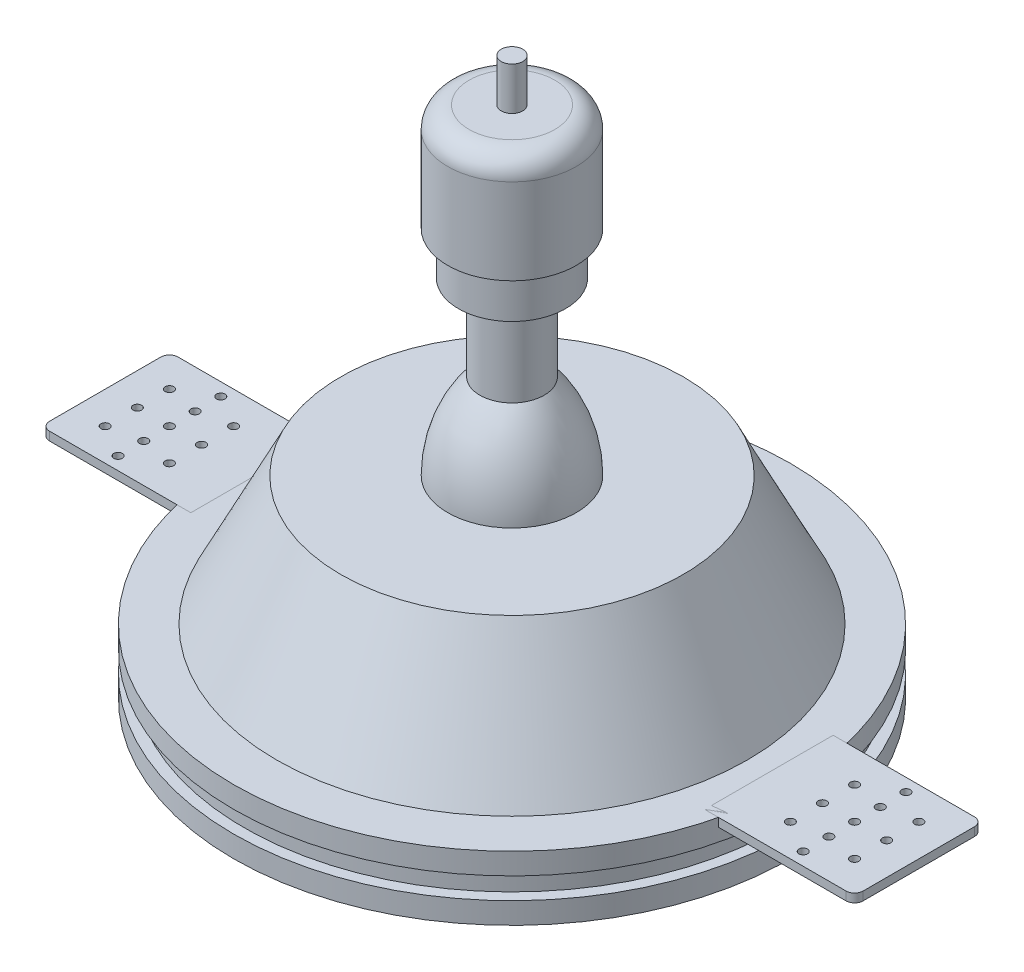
ISO-10303-21;
HEADER;
FILE_DESCRIPTION(('STEP AP214'),'2;1');
FILE_NAME('part.step','',(''),(''),'','','');
FILE_SCHEMA(('AUTOMOTIVE_DESIGN { 1 0 10303 214 1 1 1 1 }'));
ENDSEC;
DATA;
#1=APPLICATION_CONTEXT('core data for automotive mechanical design processes');
#2=APPLICATION_PROTOCOL_DEFINITION('international standard','automotive_design',2000,#1);
#3=PRODUCT_CONTEXT('',#1,'mechanical');
#4=PRODUCT('Part','Part','',(#3));
#5=PRODUCT_RELATED_PRODUCT_CATEGORY('part','',(#4));
#6=PRODUCT_DEFINITION_FORMATION('','',#4);
#7=PRODUCT_DEFINITION_CONTEXT('part definition',#1,'design');
#8=PRODUCT_DEFINITION('design','',#6,#7);
#9=PRODUCT_DEFINITION_SHAPE('','',#8);
#10=(LENGTH_UNIT() NAMED_UNIT(*) SI_UNIT(.MILLI.,.METRE.));
#11=(NAMED_UNIT(*) PLANE_ANGLE_UNIT() SI_UNIT($,.RADIAN.));
#12=(NAMED_UNIT(*) SI_UNIT($,.STERADIAN.) SOLID_ANGLE_UNIT());
#13=UNCERTAINTY_MEASURE_WITH_UNIT(LENGTH_MEASURE(1.E-05),#10,'distance_accuracy_value','');
#14=(GEOMETRIC_REPRESENTATION_CONTEXT(3) GLOBAL_UNCERTAINTY_ASSIGNED_CONTEXT((#13)) GLOBAL_UNIT_ASSIGNED_CONTEXT((#10,
#11,#12)) REPRESENTATION_CONTEXT('',''));
#15=CARTESIAN_POINT('',(0.,0.,0.));
#16=DIRECTION('',(0.,0.,1.));
#17=DIRECTION('',(1.,0.,0.));
#18=AXIS2_PLACEMENT_3D('',#15,#16,#17);
#19=CARTESIAN_POINT('',(93.,13.,-13.));
#20=DIRECTION('',(0.,1.,0.));
#21=DIRECTION('',(0.,0.,1.));
#22=AXIS2_PLACEMENT_3D('',#19,#20,#21);
#23=CYLINDRICAL_SURFACE('',#22,2.);
#24=CARTESIAN_POINT('',(93.,15.,-13.));
#25=DIRECTION('',(0.,1.,0.));
#26=DIRECTION('',(0.,0.,-1.));
#27=AXIS2_PLACEMENT_3D('',#24,#25,#26);
#28=CIRCLE('',#27,2.);
#29=CARTESIAN_POINT('',(95.,15.,-13.));
#30=VERTEX_POINT('',#29);
#31=CARTESIAN_POINT('',(93.,15.,-15.));
#32=VERTEX_POINT('',#31);
#33=EDGE_CURVE('E141',#30,#32,#28,.T.);
#34=ORIENTED_EDGE('',*,*,#33,.F.);
#35=DIRECTION('',(0.,1.,0.));
#36=VECTOR('',#35,1.);
#37=CARTESIAN_POINT('',(95.,13.,-13.));
#38=LINE('',#37,#36);
#39=CARTESIAN_POINT('',(95.,13.,-13.));
#40=VERTEX_POINT('',#39);
#41=EDGE_CURVE('E13',#40,#30,#38,.T.);
#42=ORIENTED_EDGE('',*,*,#41,.F.);
#43=CARTESIAN_POINT('',(93.,13.,-13.));
#44=DIRECTION('',(0.,1.,0.));
#45=DIRECTION('',(0.,0.,-1.));
#46=AXIS2_PLACEMENT_3D('',#43,#44,#45);
#47=CIRCLE('',#46,2.);
#48=CARTESIAN_POINT('',(93.,13.,-15.));
#49=VERTEX_POINT('',#48);
#50=EDGE_CURVE('E156',#40,#49,#47,.T.);
#51=ORIENTED_EDGE('',*,*,#50,.T.);
#52=DIRECTION('',(0.,1.,0.));
#53=VECTOR('',#52,1.);
#54=CARTESIAN_POINT('',(93.,13.,-15.));
#55=LINE('',#54,#53);
#56=EDGE_CURVE('E59',#49,#32,#55,.T.);
#57=ORIENTED_EDGE('',*,*,#56,.T.);
#58=EDGE_LOOP('',(#34,#42,#51,#57));
#59=FACE_BOUND('',#58,.T.);
#60=ADVANCED_FACE('F56',(#59),#23,.T.);
#61=CARTESIAN_POINT('',(95.,13.,-13.));
#62=DIRECTION('',(1.,0.,0.));
#63=DIRECTION('',(0.,0.,-1.));
#64=AXIS2_PLACEMENT_3D('',#61,#62,#63);
#65=PLANE('',#64);
#66=DIRECTION('',(0.,0.,-1.));
#67=VECTOR('',#66,1.);
#68=CARTESIAN_POINT('',(95.,15.,-13.));
#69=LINE('',#68,#67);
#70=CARTESIAN_POINT('',(95.,15.,13.));
#71=VERTEX_POINT('',#70);
#72=EDGE_CURVE('E154',#71,#30,#69,.T.);
#73=ORIENTED_EDGE('',*,*,#72,.F.);
#74=DIRECTION('',(0.,1.,0.));
#75=VECTOR('',#74,1.);
#76=CARTESIAN_POINT('',(95.,13.,13.));
#77=LINE('',#76,#75);
#78=CARTESIAN_POINT('',(95.,13.,13.));
#79=VERTEX_POINT('',#78);
#80=EDGE_CURVE('E65',#79,#71,#77,.T.);
#81=ORIENTED_EDGE('',*,*,#80,.F.);
#82=DIRECTION('',(0.,0.,-1.));
#83=VECTOR('',#82,1.);
#84=CARTESIAN_POINT('',(95.,13.,-13.));
#85=LINE('',#84,#83);
#86=EDGE_CURVE('E131',#79,#40,#85,.T.);
#87=ORIENTED_EDGE('',*,*,#86,.T.);
#88=ORIENTED_EDGE('',*,*,#41,.T.);
#89=EDGE_LOOP('',(#73,#81,#87,#88));
#90=FACE_BOUND('',#89,.T.);
#91=ADVANCED_FACE('F164',(#90),#65,.T.);
#92=CARTESIAN_POINT('',(93.,13.,13.));
#93=DIRECTION('',(0.,1.,0.));
#94=DIRECTION('',(0.,0.,1.));
#95=AXIS2_PLACEMENT_3D('',#92,#93,#94);
#96=CYLINDRICAL_SURFACE('',#95,2.);
#97=CARTESIAN_POINT('',(93.,15.,13.));
#98=DIRECTION('',(0.,1.,0.));
#99=DIRECTION('',(0.,0.,1.));
#100=AXIS2_PLACEMENT_3D('',#97,#98,#99);
#101=CIRCLE('',#100,2.);
#102=CARTESIAN_POINT('',(93.,15.,15.));
#103=VERTEX_POINT('',#102);
#104=EDGE_CURVE('E118',#103,#71,#101,.T.);
#105=ORIENTED_EDGE('',*,*,#104,.F.);
#106=DIRECTION('',(0.,1.,0.));
#107=VECTOR('',#106,1.);
#108=CARTESIAN_POINT('',(93.,13.,15.));
#109=LINE('',#108,#107);
#110=CARTESIAN_POINT('',(93.,13.,15.));
#111=VERTEX_POINT('',#110);
#112=EDGE_CURVE('E113',#111,#103,#109,.T.);
#113=ORIENTED_EDGE('',*,*,#112,.F.);
#114=CARTESIAN_POINT('',(93.,13.,13.));
#115=DIRECTION('',(0.,1.,0.));
#116=DIRECTION('',(0.,0.,1.));
#117=AXIS2_PLACEMENT_3D('',#114,#115,#116);
#118=CIRCLE('',#117,2.);
#119=EDGE_CURVE('E116',#111,#79,#118,.T.);
#120=ORIENTED_EDGE('',*,*,#119,.T.);
#121=ORIENTED_EDGE('',*,*,#80,.T.);
#122=EDGE_LOOP('',(#105,#113,#120,#121));
#123=FACE_BOUND('',#122,.T.);
#124=ADVANCED_FACE('F115',(#123),#96,.T.);
#125=CARTESIAN_POINT('',(60.,13.,15.));
#126=DIRECTION('',(0.,0.,1.));
#127=DIRECTION('',(1.,0.,0.));
#128=AXIS2_PLACEMENT_3D('',#125,#126,#127);
#129=PLANE('',#128);
#130=DIRECTION('',(1.,0.,0.));
#131=VECTOR('',#130,1.);
#132=CARTESIAN_POINT('',(60.,15.,15.));
#133=LINE('',#132,#131);
#134=CARTESIAN_POINT('',(60.,15.,15.));
#135=VERTEX_POINT('',#134);
#136=EDGE_CURVE('E151',#135,#103,#133,.T.);
#137=ORIENTED_EDGE('',*,*,#136,.F.);
#138=DIRECTION('',(0.,1.,0.));
#139=VECTOR('',#138,1.);
#140=CARTESIAN_POINT('',(60.,13.,15.));
#141=LINE('',#140,#139);
#142=CARTESIAN_POINT('',(60.,13.,15.));
#143=VERTEX_POINT('',#142);
#144=EDGE_CURVE('E123',#143,#135,#141,.T.);
#145=ORIENTED_EDGE('',*,*,#144,.F.);
#146=DIRECTION('',(1.,0.,0.));
#147=VECTOR('',#146,1.);
#148=CARTESIAN_POINT('',(60.,13.,15.));
#149=LINE('',#148,#147);
#150=EDGE_CURVE('E129',#143,#111,#149,.T.);
#151=ORIENTED_EDGE('',*,*,#150,.T.);
#152=ORIENTED_EDGE('',*,*,#112,.T.);
#153=EDGE_LOOP('',(#137,#145,#151,#152));
#154=FACE_BOUND('',#153,.T.);
#155=ADVANCED_FACE('F133',(#154),#129,.T.);
#156=CARTESIAN_POINT('',(60.,13.,-15.));
#157=DIRECTION('',(-1.,0.,0.));
#158=DIRECTION('',(0.,0.,1.));
#159=AXIS2_PLACEMENT_3D('',#156,#157,#158);
#160=PLANE('',#159);
#161=DIRECTION('',(0.,0.,1.));
#162=VECTOR('',#161,1.);
#163=CARTESIAN_POINT('',(60.,15.,-15.));
#164=LINE('',#163,#162);
#165=CARTESIAN_POINT('',(60.,15.,-15.));
#166=VERTEX_POINT('',#165);
#167=EDGE_CURVE('E148',#166,#135,#164,.T.);
#168=ORIENTED_EDGE('',*,*,#167,.F.);
#169=DIRECTION('',(0.,1.,0.));
#170=VECTOR('',#169,1.);
#171=CARTESIAN_POINT('',(60.,13.,-15.));
#172=LINE('',#171,#170);
#173=CARTESIAN_POINT('',(60.,13.,-15.));
#174=VERTEX_POINT('',#173);
#175=EDGE_CURVE('E159',#174,#166,#172,.T.);
#176=ORIENTED_EDGE('',*,*,#175,.F.);
#177=DIRECTION('',(0.,0.,1.));
#178=VECTOR('',#177,1.);
#179=CARTESIAN_POINT('',(60.,13.,-15.));
#180=LINE('',#179,#178);
#181=EDGE_CURVE('E134',#174,#143,#180,.T.);
#182=ORIENTED_EDGE('',*,*,#181,.T.);
#183=ORIENTED_EDGE('',*,*,#144,.T.);
#184=EDGE_LOOP('',(#168,#176,#182,#183));
#185=FACE_BOUND('',#184,.T.);
#186=ADVANCED_FACE('F177',(#185),#160,.T.);
#187=CARTESIAN_POINT('',(60.,13.,-15.));
#188=DIRECTION('',(0.,0.,-1.));
#189=DIRECTION('',(-1.,0.,0.));
#190=AXIS2_PLACEMENT_3D('',#187,#188,#189);
#191=PLANE('',#190);
#192=DIRECTION('',(-1.,0.,0.));
#193=VECTOR('',#192,1.);
#194=CARTESIAN_POINT('',(60.,15.,-15.));
#195=LINE('',#194,#193);
#196=EDGE_CURVE('E144',#32,#166,#195,.T.);
#197=ORIENTED_EDGE('',*,*,#196,.F.);
#198=ORIENTED_EDGE('',*,*,#56,.F.);
#199=DIRECTION('',(-1.,0.,0.));
#200=VECTOR('',#199,1.);
#201=CARTESIAN_POINT('',(60.,13.,-15.));
#202=LINE('',#201,#200);
#203=EDGE_CURVE('E136',#49,#174,#202,.T.);
#204=ORIENTED_EDGE('',*,*,#203,.T.);
#205=ORIENTED_EDGE('',*,*,#175,.T.);
#206=EDGE_LOOP('',(#197,#198,#204,#205));
#207=FACE_BOUND('',#206,.T.);
#208=ADVANCED_FACE('F161',(#207),#191,.T.);
#209=CARTESIAN_POINT('',(93.,13.,-13.));
#210=DIRECTION('',(0.,-1.,0.));
#211=DIRECTION('',(0.,0.,-1.));
#212=AXIS2_PLACEMENT_3D('',#209,#210,#211);
#213=PLANE('',#212);
#214=CARTESIAN_POINT('',(72.5,13.,-7.50000000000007));
#215=DIRECTION('',(0.,-1.,0.));
#216=DIRECTION('',(0.,0.,-1.));
#217=AXIS2_PLACEMENT_3D('',#214,#215,#216);
#218=CIRCLE('',#217,0.999999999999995);
#219=CARTESIAN_POINT('',(72.5,13.,-6.50000000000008));
#220=VERTEX_POINT('',#219);
#221=EDGE_CURVE('E145',#220,#220,#218,.T.);
#222=ORIENTED_EDGE('',*,*,#221,.F.);
#223=EDGE_LOOP('',(#222));
#224=FACE_BOUND('',#223,.T.);
#225=CARTESIAN_POINT('',(72.5,13.,0.));
#226=DIRECTION('',(0.,-1.,0.));
#227=DIRECTION('',(0.,0.,-1.));
#228=AXIS2_PLACEMENT_3D('',#225,#226,#227);
#229=CIRCLE('',#228,0.999999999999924);
#230=CARTESIAN_POINT('',(72.5,13.,0.999999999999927));
#231=VERTEX_POINT('',#230);
#232=EDGE_CURVE('E302',#231,#231,#229,.T.);
#233=ORIENTED_EDGE('',*,*,#232,.F.);
#234=EDGE_LOOP('',(#233));
#235=FACE_BOUND('',#234,.T.);
#236=CARTESIAN_POINT('',(72.4999999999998,13.,7.49999999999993));
#237=DIRECTION('',(0.,-1.,0.));
#238=DIRECTION('',(0.,0.,-1.));
#239=AXIS2_PLACEMENT_3D('',#236,#237,#238);
#240=CIRCLE('',#239,0.999999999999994);
#241=CARTESIAN_POINT('',(72.4999999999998,13.,8.49999999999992));
#242=VERTEX_POINT('',#241);
#243=EDGE_CURVE('E299',#242,#242,#240,.T.);
#244=ORIENTED_EDGE('',*,*,#243,.F.);
#245=EDGE_LOOP('',(#244));
#246=FACE_BOUND('',#245,.T.);
#247=CARTESIAN_POINT('',(87.5,13.,7.50000000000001));
#248=DIRECTION('',(0.,-1.,0.));
#249=DIRECTION('',(0.,0.,-1.));
#250=AXIS2_PLACEMENT_3D('',#247,#248,#249);
#251=CIRCLE('',#250,0.999999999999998);
#252=CARTESIAN_POINT('',(87.5,13.,8.50000000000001));
#253=VERTEX_POINT('',#252);
#254=EDGE_CURVE('E296',#253,#253,#251,.T.);
#255=ORIENTED_EDGE('',*,*,#254,.F.);
#256=EDGE_LOOP('',(#255));
#257=FACE_BOUND('',#256,.T.);
#258=CARTESIAN_POINT('',(87.5,13.,0.));
#259=DIRECTION('',(0.,-1.,0.));
#260=DIRECTION('',(0.,0.,-1.));
#261=AXIS2_PLACEMENT_3D('',#258,#259,#260);
#262=CIRCLE('',#261,0.999999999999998);
#263=CARTESIAN_POINT('',(87.5,13.,1.00000000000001));
#264=VERTEX_POINT('',#263);
#265=EDGE_CURVE('E293',#264,#264,#262,.T.);
#266=ORIENTED_EDGE('',*,*,#265,.F.);
#267=EDGE_LOOP('',(#266));
#268=FACE_BOUND('',#267,.T.);
#269=CARTESIAN_POINT('',(87.5,13.,-7.49999999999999));
#270=DIRECTION('',(0.,-1.,0.));
#271=DIRECTION('',(0.,0.,-1.));
#272=AXIS2_PLACEMENT_3D('',#269,#270,#271);
#273=CIRCLE('',#272,0.999999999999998);
#274=CARTESIAN_POINT('',(87.5,13.,-6.49999999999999));
#275=VERTEX_POINT('',#274);
#276=EDGE_CURVE('E290',#275,#275,#273,.T.);
#277=ORIENTED_EDGE('',*,*,#276,.F.);
#278=EDGE_LOOP('',(#277));
#279=FACE_BOUND('',#278,.T.);
#280=CARTESIAN_POINT('',(80.,13.,0.));
#281=DIRECTION('',(0.,-1.,0.));
#282=DIRECTION('',(0.,0.,-1.));
#283=AXIS2_PLACEMENT_3D('',#280,#281,#282);
#284=CIRCLE('',#283,0.999999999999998);
#285=CARTESIAN_POINT('',(80.,13.,1.));
#286=VERTEX_POINT('',#285);
#287=EDGE_CURVE('E240',#286,#286,#284,.T.);
#288=ORIENTED_EDGE('',*,*,#287,.F.);
#289=EDGE_LOOP('',(#288));
#290=FACE_BOUND('',#289,.T.);
#291=CARTESIAN_POINT('',(80.,13.,-5.99999999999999));
#292=DIRECTION('',(0.,-1.,0.));
#293=DIRECTION('',(0.,0.,-1.));
#294=AXIS2_PLACEMENT_3D('',#291,#292,#293);
#295=CIRCLE('',#294,0.999999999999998);
#296=CARTESIAN_POINT('',(80.,13.,-5.));
#297=VERTEX_POINT('',#296);
#298=EDGE_CURVE('E286',#297,#297,#295,.T.);
#299=ORIENTED_EDGE('',*,*,#298,.F.);
#300=EDGE_LOOP('',(#299));
#301=FACE_BOUND('',#300,.T.);
#302=CARTESIAN_POINT('',(80.,13.,-12.));
#303=DIRECTION('',(0.,-1.,0.));
#304=DIRECTION('',(0.,0.,-1.));
#305=AXIS2_PLACEMENT_3D('',#302,#303,#304);
#306=CIRCLE('',#305,0.999999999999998);
#307=CARTESIAN_POINT('',(80.,13.,-11.));
#308=VERTEX_POINT('',#307);
#309=EDGE_CURVE('E283',#308,#308,#306,.T.);
#310=ORIENTED_EDGE('',*,*,#309,.F.);
#311=EDGE_LOOP('',(#310));
#312=FACE_BOUND('',#311,.T.);
#313=CARTESIAN_POINT('',(79.9999999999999,13.,6.00000000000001));
#314=DIRECTION('',(0.,-1.,0.));
#315=DIRECTION('',(0.,0.,-1.));
#316=AXIS2_PLACEMENT_3D('',#313,#314,#315);
#317=CIRCLE('',#316,0.999999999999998);
#318=CARTESIAN_POINT('',(79.9999999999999,13.,7.));
#319=VERTEX_POINT('',#318);
#320=EDGE_CURVE('E280',#319,#319,#317,.T.);
#321=ORIENTED_EDGE('',*,*,#320,.F.);
#322=EDGE_LOOP('',(#321));
#323=FACE_BOUND('',#322,.T.);
#324=CARTESIAN_POINT('',(79.9999999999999,13.,12.));
#325=DIRECTION('',(0.,-1.,0.));
#326=DIRECTION('',(0.,0.,-1.));
#327=AXIS2_PLACEMENT_3D('',#324,#325,#326);
#328=CIRCLE('',#327,0.999999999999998);
#329=CARTESIAN_POINT('',(79.9999999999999,13.,13.));
#330=VERTEX_POINT('',#329);
#331=EDGE_CURVE('E275',#330,#330,#328,.T.);
#332=ORIENTED_EDGE('',*,*,#331,.F.);
#333=EDGE_LOOP('',(#332));
#334=FACE_BOUND('',#333,.T.);
#335=ORIENTED_EDGE('',*,*,#50,.F.);
#336=ORIENTED_EDGE('',*,*,#86,.F.);
#337=ORIENTED_EDGE('',*,*,#119,.F.);
#338=ORIENTED_EDGE('',*,*,#150,.F.);
#339=ORIENTED_EDGE('',*,*,#181,.F.);
#340=ORIENTED_EDGE('',*,*,#203,.F.);
#341=EDGE_LOOP('',(#335,#336,#337,#338,#339,#340));
#342=FACE_BOUND('',#341,.T.);
#343=ADVANCED_FACE('F127',(#224,#235,#246,#257,#268,#279,#290,#301,#312,#323,#334,#342),#213,.T.);
#344=CARTESIAN_POINT('',(93.,15.,-13.));
#345=DIRECTION('',(0.,-1.,0.));
#346=DIRECTION('',(0.,0.,-1.));
#347=AXIS2_PLACEMENT_3D('',#344,#345,#346);
#348=PLANE('',#347);
#349=CARTESIAN_POINT('',(72.5,15.,-7.50000000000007));
#350=DIRECTION('',(0.,1.,0.));
#351=DIRECTION('',(0.,0.,1.));
#352=AXIS2_PLACEMENT_3D('',#349,#350,#351);
#353=CIRCLE('',#352,0.999999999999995);
#354=CARTESIAN_POINT('',(72.5,15.,-6.50000000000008));
#355=VERTEX_POINT('',#354);
#356=EDGE_CURVE('E272',#355,#355,#353,.T.);
#357=ORIENTED_EDGE('',*,*,#356,.F.);
#358=EDGE_LOOP('',(#357));
#359=FACE_BOUND('',#358,.T.);
#360=CARTESIAN_POINT('',(72.5,15.,0.));
#361=DIRECTION('',(0.,1.,0.));
#362=DIRECTION('',(0.,0.,1.));
#363=AXIS2_PLACEMENT_3D('',#360,#361,#362);
#364=CIRCLE('',#363,0.999999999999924);
#365=CARTESIAN_POINT('',(72.5,15.,0.999999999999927));
#366=VERTEX_POINT('',#365);
#367=EDGE_CURVE('E263',#366,#366,#364,.T.);
#368=ORIENTED_EDGE('',*,*,#367,.F.);
#369=EDGE_LOOP('',(#368));
#370=FACE_BOUND('',#369,.T.);
#371=CARTESIAN_POINT('',(72.4999999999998,15.,7.49999999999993));
#372=DIRECTION('',(0.,1.,0.));
#373=DIRECTION('',(0.,0.,1.));
#374=AXIS2_PLACEMENT_3D('',#371,#372,#373);
#375=CIRCLE('',#374,0.999999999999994);
#376=CARTESIAN_POINT('',(72.4999999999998,15.,8.49999999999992));
#377=VERTEX_POINT('',#376);
#378=EDGE_CURVE('E260',#377,#377,#375,.T.);
#379=ORIENTED_EDGE('',*,*,#378,.F.);
#380=EDGE_LOOP('',(#379));
#381=FACE_BOUND('',#380,.T.);
#382=CARTESIAN_POINT('',(87.5,15.,7.50000000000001));
#383=DIRECTION('',(0.,1.,0.));
#384=DIRECTION('',(0.,0.,-1.));
#385=AXIS2_PLACEMENT_3D('',#382,#383,#384);
#386=CIRCLE('',#385,0.999999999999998);
#387=CARTESIAN_POINT('',(87.5,15.,8.50000000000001));
#388=VERTEX_POINT('',#387);
#389=EDGE_CURVE('E264',#388,#388,#386,.T.);
#390=ORIENTED_EDGE('',*,*,#389,.F.);
#391=EDGE_LOOP('',(#390));
#392=FACE_BOUND('',#391,.T.);
#393=CARTESIAN_POINT('',(87.5,15.,0.));
#394=DIRECTION('',(0.,1.,0.));
#395=DIRECTION('',(0.,0.,-1.));
#396=AXIS2_PLACEMENT_3D('',#393,#394,#395);
#397=CIRCLE('',#396,0.999999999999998);
#398=CARTESIAN_POINT('',(87.5,15.,1.00000000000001));
#399=VERTEX_POINT('',#398);
#400=EDGE_CURVE('E267',#399,#399,#397,.T.);
#401=ORIENTED_EDGE('',*,*,#400,.F.);
#402=EDGE_LOOP('',(#401));
#403=FACE_BOUND('',#402,.T.);
#404=CARTESIAN_POINT('',(87.5,15.,-7.49999999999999));
#405=DIRECTION('',(0.,1.,0.));
#406=DIRECTION('',(0.,0.,-1.));
#407=AXIS2_PLACEMENT_3D('',#404,#405,#406);
#408=CIRCLE('',#407,0.999999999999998);
#409=CARTESIAN_POINT('',(87.5,15.,-6.49999999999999));
#410=VERTEX_POINT('',#409);
#411=EDGE_CURVE('E254',#410,#410,#408,.T.);
#412=ORIENTED_EDGE('',*,*,#411,.F.);
#413=EDGE_LOOP('',(#412));
#414=FACE_BOUND('',#413,.T.);
#415=CARTESIAN_POINT('',(80.,15.,0.));
#416=DIRECTION('',(0.,1.,0.));
#417=DIRECTION('',(0.,0.,-1.));
#418=AXIS2_PLACEMENT_3D('',#415,#416,#417);
#419=CIRCLE('',#418,0.999999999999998);
#420=CARTESIAN_POINT('',(80.,15.,1.));
#421=VERTEX_POINT('',#420);
#422=EDGE_CURVE('E243',#421,#421,#419,.T.);
#423=ORIENTED_EDGE('',*,*,#422,.F.);
#424=EDGE_LOOP('',(#423));
#425=FACE_BOUND('',#424,.T.);
#426=CARTESIAN_POINT('',(80.,15.,-5.99999999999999));
#427=DIRECTION('',(0.,1.,0.));
#428=DIRECTION('',(0.,0.,-1.));
#429=AXIS2_PLACEMENT_3D('',#426,#427,#428);
#430=CIRCLE('',#429,0.999999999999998);
#431=CARTESIAN_POINT('',(80.,15.,-5.));
#432=VERTEX_POINT('',#431);
#433=EDGE_CURVE('E245',#432,#432,#430,.T.);
#434=ORIENTED_EDGE('',*,*,#433,.F.);
#435=EDGE_LOOP('',(#434));
#436=FACE_BOUND('',#435,.T.);
#437=CARTESIAN_POINT('',(80.,15.,-12.));
#438=DIRECTION('',(0.,1.,0.));
#439=DIRECTION('',(0.,0.,-1.));
#440=AXIS2_PLACEMENT_3D('',#437,#438,#439);
#441=CIRCLE('',#440,0.999999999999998);
#442=CARTESIAN_POINT('',(80.,15.,-11.));
#443=VERTEX_POINT('',#442);
#444=EDGE_CURVE('E248',#443,#443,#441,.T.);
#445=ORIENTED_EDGE('',*,*,#444,.F.);
#446=EDGE_LOOP('',(#445));
#447=FACE_BOUND('',#446,.T.);
#448=CARTESIAN_POINT('',(79.9999999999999,15.,6.00000000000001));
#449=DIRECTION('',(0.,1.,0.));
#450=DIRECTION('',(0.,0.,-1.));
#451=AXIS2_PLACEMENT_3D('',#448,#449,#450);
#452=CIRCLE('',#451,0.999999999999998);
#453=CARTESIAN_POINT('',(79.9999999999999,15.,7.));
#454=VERTEX_POINT('',#453);
#455=EDGE_CURVE('E255',#454,#454,#452,.T.);
#456=ORIENTED_EDGE('',*,*,#455,.F.);
#457=EDGE_LOOP('',(#456));
#458=FACE_BOUND('',#457,.T.);
#459=CARTESIAN_POINT('',(79.9999999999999,15.,12.));
#460=DIRECTION('',(0.,1.,0.));
#461=DIRECTION('',(0.,0.,-1.));
#462=AXIS2_PLACEMENT_3D('',#459,#460,#461);
#463=CIRCLE('',#462,0.999999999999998);
#464=CARTESIAN_POINT('',(79.9999999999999,15.,13.));
#465=VERTEX_POINT('',#464);
#466=EDGE_CURVE('E251',#465,#465,#463,.T.);
#467=ORIENTED_EDGE('',*,*,#466,.F.);
#468=EDGE_LOOP('',(#467));
#469=FACE_BOUND('',#468,.T.);
#470=ORIENTED_EDGE('',*,*,#33,.T.);
#471=ORIENTED_EDGE('',*,*,#196,.T.);
#472=ORIENTED_EDGE('',*,*,#167,.T.);
#473=ORIENTED_EDGE('',*,*,#136,.T.);
#474=ORIENTED_EDGE('',*,*,#104,.T.);
#475=ORIENTED_EDGE('',*,*,#72,.T.);
#476=EDGE_LOOP('',(#470,#471,#472,#473,#474,#475));
#477=FACE_BOUND('',#476,.T.);
#478=ADVANCED_FACE('F163',(#359,#370,#381,#392,#403,#414,#425,#436,#447,#458,#469,#477),#348,.F.);
#479=CARTESIAN_POINT('',(79.9999999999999,-9.99999999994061E-05,12.));
#480=DIRECTION('',(0.,1.,0.));
#481=DIRECTION('',(0.,0.,1.));
#482=AXIS2_PLACEMENT_3D('',#479,#480,#481);
#483=CYLINDRICAL_SURFACE('',#482,0.999999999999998);
#484=CARTESIAN_POINT('',(79.9999999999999,13.,13.));
#485=CARTESIAN_POINT('',(79.9999999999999,13.0208333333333,13.));
#486=CARTESIAN_POINT('',(79.9999999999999,13.0416666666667,13.));
#487=CARTESIAN_POINT('',(79.9999999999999,13.0833333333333,13.));
#488=CARTESIAN_POINT('',(79.9999999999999,13.1041666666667,13.));
#489=CARTESIAN_POINT('',(79.9999999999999,13.1458333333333,13.));
#490=CARTESIAN_POINT('',(79.9999999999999,13.1666666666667,13.));
#491=CARTESIAN_POINT('',(79.9999999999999,13.2083333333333,13.));
#492=CARTESIAN_POINT('',(79.9999999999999,13.2291666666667,13.));
#493=CARTESIAN_POINT('',(79.9999999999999,13.2708333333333,13.));
#494=CARTESIAN_POINT('',(79.9999999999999,13.2916666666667,13.));
#495=CARTESIAN_POINT('',(79.9999999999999,13.3333333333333,13.));
#496=CARTESIAN_POINT('',(79.9999999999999,13.3541666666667,13.));
#497=CARTESIAN_POINT('',(79.9999999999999,13.3958333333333,13.));
#498=CARTESIAN_POINT('',(79.9999999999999,13.4166666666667,13.));
#499=CARTESIAN_POINT('',(79.9999999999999,13.4583333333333,13.));
#500=CARTESIAN_POINT('',(79.9999999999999,13.4791666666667,13.));
#501=CARTESIAN_POINT('',(79.9999999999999,13.5208333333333,13.));
#502=CARTESIAN_POINT('',(79.9999999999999,13.5416666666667,13.));
#503=CARTESIAN_POINT('',(79.9999999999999,13.5833333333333,13.));
#504=CARTESIAN_POINT('',(79.9999999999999,13.6041666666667,13.));
#505=CARTESIAN_POINT('',(79.9999999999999,13.6458333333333,13.));
#506=CARTESIAN_POINT('',(79.9999999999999,13.6666666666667,13.));
#507=CARTESIAN_POINT('',(79.9999999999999,13.7083333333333,13.));
#508=CARTESIAN_POINT('',(79.9999999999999,13.7291666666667,13.));
#509=CARTESIAN_POINT('',(79.9999999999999,13.7708333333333,13.));
#510=CARTESIAN_POINT('',(79.9999999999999,13.7916666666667,13.));
#511=CARTESIAN_POINT('',(79.9999999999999,13.8333333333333,13.));
#512=CARTESIAN_POINT('',(79.9999999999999,13.8541666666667,13.));
#513=CARTESIAN_POINT('',(79.9999999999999,13.8958333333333,13.));
#514=CARTESIAN_POINT('',(79.9999999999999,13.9166666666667,13.));
#515=CARTESIAN_POINT('',(79.9999999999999,13.9583333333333,13.));
#516=CARTESIAN_POINT('',(79.9999999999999,13.9791666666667,13.));
#517=CARTESIAN_POINT('',(79.9999999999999,14.0208333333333,13.));
#518=CARTESIAN_POINT('',(79.9999999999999,14.0416666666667,13.));
#519=CARTESIAN_POINT('',(79.9999999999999,14.0833333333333,13.));
#520=CARTESIAN_POINT('',(79.9999999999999,14.1041666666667,13.));
#521=CARTESIAN_POINT('',(79.9999999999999,14.1458333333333,13.));
#522=CARTESIAN_POINT('',(79.9999999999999,14.1666666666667,13.));
#523=CARTESIAN_POINT('',(79.9999999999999,14.2083333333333,13.));
#524=CARTESIAN_POINT('',(79.9999999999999,14.2291666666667,13.));
#525=CARTESIAN_POINT('',(79.9999999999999,14.2708333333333,13.));
#526=CARTESIAN_POINT('',(79.9999999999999,14.2916666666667,13.));
#527=CARTESIAN_POINT('',(79.9999999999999,14.3333333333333,13.));
#528=CARTESIAN_POINT('',(79.9999999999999,14.3541666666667,13.));
#529=CARTESIAN_POINT('',(79.9999999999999,14.3958333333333,13.));
#530=CARTESIAN_POINT('',(79.9999999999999,14.4166666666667,13.));
#531=CARTESIAN_POINT('',(79.9999999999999,14.4583333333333,13.));
#532=CARTESIAN_POINT('',(79.9999999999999,14.4791666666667,13.));
#533=CARTESIAN_POINT('',(79.9999999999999,14.5208333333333,13.));
#534=CARTESIAN_POINT('',(79.9999999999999,14.5416666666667,13.));
#535=CARTESIAN_POINT('',(79.9999999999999,14.5833333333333,13.));
#536=CARTESIAN_POINT('',(79.9999999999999,14.6041666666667,13.));
#537=CARTESIAN_POINT('',(79.9999999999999,14.6458333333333,13.));
#538=CARTESIAN_POINT('',(79.9999999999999,14.6666666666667,13.));
#539=CARTESIAN_POINT('',(79.9999999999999,14.7083333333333,13.));
#540=CARTESIAN_POINT('',(79.9999999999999,14.7291666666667,13.));
#541=CARTESIAN_POINT('',(79.9999999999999,14.7708333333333,13.));
#542=CARTESIAN_POINT('',(79.9999999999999,14.7916666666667,13.));
#543=CARTESIAN_POINT('',(79.9999999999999,14.8333333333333,13.));
#544=CARTESIAN_POINT('',(79.9999999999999,14.8541666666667,13.));
#545=CARTESIAN_POINT('',(79.9999999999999,14.8958333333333,13.));
#546=CARTESIAN_POINT('',(79.9999999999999,14.9166666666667,13.));
#547=CARTESIAN_POINT('',(79.9999999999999,14.9583333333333,13.));
#548=CARTESIAN_POINT('',(79.9999999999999,14.9791666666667,13.));
#549=CARTESIAN_POINT('',(79.9999999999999,15.,13.));
#550=B_SPLINE_CURVE_WITH_KNOTS('',3,(#484,#485,#486,#487,#488,#489,#490,#491,#492,#493,#494,
#495,#496,#497,#498,#499,#500,#501,#502,#503,#504,#505,#506,#507,#508,#509,#510,#511,#512,#513,
#514,#515,#516,#517,#518,#519,#520,#521,#522,#523,#524,#525,#526,#527,#528,#529,#530,#531,#532,
#533,#534,#535,#536,#537,#538,#539,#540,#541,#542,#543,#544,#545,#546,#547,#548,#549),
.UNSPECIFIED.,.F.,.F.,(4,2,2,2,2,2,2,2,2,2,2,2,2,2,2,2,2,2,2,2,2,2,2,2,2,2,2,2,2,2,2,2,4),(0.,
0.0625000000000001,0.125,0.1875,0.25,0.3125,0.375,0.4375,0.5,0.562499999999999,
0.624999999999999,0.687499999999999,0.749999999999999,0.812499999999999,0.874999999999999,
0.937499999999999,0.999999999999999,1.0625,1.125,1.1875,1.25,1.3125,1.375,1.4375,1.5,1.5625,
1.625,1.6875,1.75,1.8125,1.875,1.9375,2.),.UNSPECIFIED.);
#551=EDGE_CURVE('BSEAM188',#330,#465,#550,.T.);
#552=ORIENTED_EDGE('',*,*,#331,.T.);
#553=ORIENTED_EDGE('',*,*,#466,.T.);
#554=ORIENTED_EDGE('',*,*,#551,.T.);
#555=ORIENTED_EDGE('',*,*,#551,.F.);
#556=EDGE_LOOP('',(#552,#554,#553,#555));
#557=FACE_BOUND('',#556,.T.);
#558=ADVANCED_FACE('F188',(#557),#483,.F.);
#559=CARTESIAN_POINT('',(79.9999999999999,-9.99999999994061E-05,6.00000000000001));
#560=DIRECTION('',(0.,1.,0.));
#561=DIRECTION('',(0.,0.,1.));
#562=AXIS2_PLACEMENT_3D('',#559,#560,#561);
#563=CYLINDRICAL_SURFACE('',#562,0.999999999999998);
#564=CARTESIAN_POINT('',(79.9999999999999,13.,7.));
#565=CARTESIAN_POINT('',(79.9999999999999,13.0208333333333,7.));
#566=CARTESIAN_POINT('',(79.9999999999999,13.0416666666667,7.));
#567=CARTESIAN_POINT('',(79.9999999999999,13.0833333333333,7.));
#568=CARTESIAN_POINT('',(79.9999999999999,13.1041666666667,7.));
#569=CARTESIAN_POINT('',(79.9999999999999,13.1458333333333,7.));
#570=CARTESIAN_POINT('',(79.9999999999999,13.1666666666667,7.));
#571=CARTESIAN_POINT('',(79.9999999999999,13.2083333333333,7.));
#572=CARTESIAN_POINT('',(79.9999999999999,13.2291666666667,7.));
#573=CARTESIAN_POINT('',(79.9999999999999,13.2708333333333,7.));
#574=CARTESIAN_POINT('',(79.9999999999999,13.2916666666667,7.));
#575=CARTESIAN_POINT('',(79.9999999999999,13.3333333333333,7.));
#576=CARTESIAN_POINT('',(79.9999999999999,13.3541666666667,7.));
#577=CARTESIAN_POINT('',(79.9999999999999,13.3958333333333,7.));
#578=CARTESIAN_POINT('',(79.9999999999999,13.4166666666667,7.));
#579=CARTESIAN_POINT('',(79.9999999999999,13.4583333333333,7.));
#580=CARTESIAN_POINT('',(79.9999999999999,13.4791666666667,7.));
#581=CARTESIAN_POINT('',(79.9999999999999,13.5208333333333,7.));
#582=CARTESIAN_POINT('',(79.9999999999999,13.5416666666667,7.));
#583=CARTESIAN_POINT('',(79.9999999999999,13.5833333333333,7.));
#584=CARTESIAN_POINT('',(79.9999999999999,13.6041666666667,7.));
#585=CARTESIAN_POINT('',(79.9999999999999,13.6458333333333,7.));
#586=CARTESIAN_POINT('',(79.9999999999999,13.6666666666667,7.));
#587=CARTESIAN_POINT('',(79.9999999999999,13.7083333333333,7.));
#588=CARTESIAN_POINT('',(79.9999999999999,13.7291666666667,7.));
#589=CARTESIAN_POINT('',(79.9999999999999,13.7708333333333,7.));
#590=CARTESIAN_POINT('',(79.9999999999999,13.7916666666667,7.));
#591=CARTESIAN_POINT('',(79.9999999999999,13.8333333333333,7.));
#592=CARTESIAN_POINT('',(79.9999999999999,13.8541666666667,7.));
#593=CARTESIAN_POINT('',(79.9999999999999,13.8958333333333,7.));
#594=CARTESIAN_POINT('',(79.9999999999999,13.9166666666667,7.));
#595=CARTESIAN_POINT('',(79.9999999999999,13.9583333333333,7.));
#596=CARTESIAN_POINT('',(79.9999999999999,13.9791666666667,7.));
#597=CARTESIAN_POINT('',(79.9999999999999,14.0208333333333,7.));
#598=CARTESIAN_POINT('',(79.9999999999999,14.0416666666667,7.));
#599=CARTESIAN_POINT('',(79.9999999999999,14.0833333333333,7.));
#600=CARTESIAN_POINT('',(79.9999999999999,14.1041666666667,7.));
#601=CARTESIAN_POINT('',(79.9999999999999,14.1458333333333,7.));
#602=CARTESIAN_POINT('',(79.9999999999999,14.1666666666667,7.));
#603=CARTESIAN_POINT('',(79.9999999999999,14.2083333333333,7.));
#604=CARTESIAN_POINT('',(79.9999999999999,14.2291666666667,7.));
#605=CARTESIAN_POINT('',(79.9999999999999,14.2708333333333,7.));
#606=CARTESIAN_POINT('',(79.9999999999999,14.2916666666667,7.));
#607=CARTESIAN_POINT('',(79.9999999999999,14.3333333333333,7.));
#608=CARTESIAN_POINT('',(79.9999999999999,14.3541666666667,7.));
#609=CARTESIAN_POINT('',(79.9999999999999,14.3958333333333,7.));
#610=CARTESIAN_POINT('',(79.9999999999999,14.4166666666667,7.));
#611=CARTESIAN_POINT('',(79.9999999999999,14.4583333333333,7.));
#612=CARTESIAN_POINT('',(79.9999999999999,14.4791666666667,7.));
#613=CARTESIAN_POINT('',(79.9999999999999,14.5208333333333,7.));
#614=CARTESIAN_POINT('',(79.9999999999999,14.5416666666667,7.));
#615=CARTESIAN_POINT('',(79.9999999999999,14.5833333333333,7.));
#616=CARTESIAN_POINT('',(79.9999999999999,14.6041666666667,7.));
#617=CARTESIAN_POINT('',(79.9999999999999,14.6458333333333,7.));
#618=CARTESIAN_POINT('',(79.9999999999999,14.6666666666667,7.));
#619=CARTESIAN_POINT('',(79.9999999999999,14.7083333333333,7.));
#620=CARTESIAN_POINT('',(79.9999999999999,14.7291666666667,7.));
#621=CARTESIAN_POINT('',(79.9999999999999,14.7708333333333,7.));
#622=CARTESIAN_POINT('',(79.9999999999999,14.7916666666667,7.));
#623=CARTESIAN_POINT('',(79.9999999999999,14.8333333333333,7.));
#624=CARTESIAN_POINT('',(79.9999999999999,14.8541666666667,7.));
#625=CARTESIAN_POINT('',(79.9999999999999,14.8958333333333,7.));
#626=CARTESIAN_POINT('',(79.9999999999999,14.9166666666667,7.));
#627=CARTESIAN_POINT('',(79.9999999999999,14.9583333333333,7.));
#628=CARTESIAN_POINT('',(79.9999999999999,14.9791666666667,7.));
#629=CARTESIAN_POINT('',(79.9999999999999,15.,7.));
#630=B_SPLINE_CURVE_WITH_KNOTS('',3,(#564,#565,#566,#567,#568,#569,#570,#571,#572,#573,#574,
#575,#576,#577,#578,#579,#580,#581,#582,#583,#584,#585,#586,#587,#588,#589,#590,#591,#592,#593,
#594,#595,#596,#597,#598,#599,#600,#601,#602,#603,#604,#605,#606,#607,#608,#609,#610,#611,#612,
#613,#614,#615,#616,#617,#618,#619,#620,#621,#622,#623,#624,#625,#626,#627,#628,#629),
.UNSPECIFIED.,.F.,.F.,(4,2,2,2,2,2,2,2,2,2,2,2,2,2,2,2,2,2,2,2,2,2,2,2,2,2,2,2,2,2,2,2,4),(0.,
0.0625000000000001,0.125,0.1875,0.25,0.3125,0.375,0.4375,0.5,0.562499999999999,
0.624999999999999,0.687499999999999,0.749999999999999,0.812499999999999,0.874999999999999,
0.937499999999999,0.999999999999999,1.0625,1.125,1.1875,1.25,1.3125,1.375,1.4375,1.5,1.5625,
1.625,1.6875,1.75,1.8125,1.875,1.9375,2.),.UNSPECIFIED.);
#631=EDGE_CURVE('BSEAM225',#319,#454,#630,.T.);
#632=ORIENTED_EDGE('',*,*,#320,.T.);
#633=ORIENTED_EDGE('',*,*,#455,.T.);
#634=ORIENTED_EDGE('',*,*,#631,.T.);
#635=ORIENTED_EDGE('',*,*,#631,.F.);
#636=EDGE_LOOP('',(#632,#634,#633,#635));
#637=FACE_BOUND('',#636,.T.);
#638=ADVANCED_FACE('F225',(#637),#563,.F.);
#639=CARTESIAN_POINT('',(80.,-9.99999999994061E-05,-12.));
#640=DIRECTION('',(0.,1.,0.));
#641=DIRECTION('',(0.,0.,1.));
#642=AXIS2_PLACEMENT_3D('',#639,#640,#641);
#643=CYLINDRICAL_SURFACE('',#642,0.999999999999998);
#644=CARTESIAN_POINT('',(80.,13.,-11.));
#645=CARTESIAN_POINT('',(80.,13.0208333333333,-11.));
#646=CARTESIAN_POINT('',(80.,13.0416666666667,-11.));
#647=CARTESIAN_POINT('',(80.,13.0833333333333,-11.));
#648=CARTESIAN_POINT('',(80.,13.1041666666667,-11.));
#649=CARTESIAN_POINT('',(80.,13.1458333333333,-11.));
#650=CARTESIAN_POINT('',(80.,13.1666666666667,-11.));
#651=CARTESIAN_POINT('',(80.,13.2083333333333,-11.));
#652=CARTESIAN_POINT('',(80.,13.2291666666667,-11.));
#653=CARTESIAN_POINT('',(80.,13.2708333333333,-11.));
#654=CARTESIAN_POINT('',(80.,13.2916666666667,-11.));
#655=CARTESIAN_POINT('',(80.,13.3333333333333,-11.));
#656=CARTESIAN_POINT('',(80.,13.3541666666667,-11.));
#657=CARTESIAN_POINT('',(80.,13.3958333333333,-11.));
#658=CARTESIAN_POINT('',(80.,13.4166666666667,-11.));
#659=CARTESIAN_POINT('',(80.,13.4583333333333,-11.));
#660=CARTESIAN_POINT('',(80.,13.4791666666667,-11.));
#661=CARTESIAN_POINT('',(80.,13.5208333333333,-11.));
#662=CARTESIAN_POINT('',(80.,13.5416666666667,-11.));
#663=CARTESIAN_POINT('',(80.,13.5833333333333,-11.));
#664=CARTESIAN_POINT('',(80.,13.6041666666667,-11.));
#665=CARTESIAN_POINT('',(80.,13.6458333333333,-11.));
#666=CARTESIAN_POINT('',(80.,13.6666666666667,-11.));
#667=CARTESIAN_POINT('',(80.,13.7083333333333,-11.));
#668=CARTESIAN_POINT('',(80.,13.7291666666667,-11.));
#669=CARTESIAN_POINT('',(80.,13.7708333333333,-11.));
#670=CARTESIAN_POINT('',(80.,13.7916666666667,-11.));
#671=CARTESIAN_POINT('',(80.,13.8333333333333,-11.));
#672=CARTESIAN_POINT('',(80.,13.8541666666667,-11.));
#673=CARTESIAN_POINT('',(80.,13.8958333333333,-11.));
#674=CARTESIAN_POINT('',(80.,13.9166666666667,-11.));
#675=CARTESIAN_POINT('',(80.,13.9583333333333,-11.));
#676=CARTESIAN_POINT('',(80.,13.9791666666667,-11.));
#677=CARTESIAN_POINT('',(80.,14.0208333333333,-11.));
#678=CARTESIAN_POINT('',(80.,14.0416666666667,-11.));
#679=CARTESIAN_POINT('',(80.,14.0833333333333,-11.));
#680=CARTESIAN_POINT('',(80.,14.1041666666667,-11.));
#681=CARTESIAN_POINT('',(80.,14.1458333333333,-11.));
#682=CARTESIAN_POINT('',(80.,14.1666666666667,-11.));
#683=CARTESIAN_POINT('',(80.,14.2083333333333,-11.));
#684=CARTESIAN_POINT('',(80.,14.2291666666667,-11.));
#685=CARTESIAN_POINT('',(80.,14.2708333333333,-11.));
#686=CARTESIAN_POINT('',(80.,14.2916666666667,-11.));
#687=CARTESIAN_POINT('',(80.,14.3333333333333,-11.));
#688=CARTESIAN_POINT('',(80.,14.3541666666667,-11.));
#689=CARTESIAN_POINT('',(80.,14.3958333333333,-11.));
#690=CARTESIAN_POINT('',(80.,14.4166666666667,-11.));
#691=CARTESIAN_POINT('',(80.,14.4583333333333,-11.));
#692=CARTESIAN_POINT('',(80.,14.4791666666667,-11.));
#693=CARTESIAN_POINT('',(80.,14.5208333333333,-11.));
#694=CARTESIAN_POINT('',(80.,14.5416666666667,-11.));
#695=CARTESIAN_POINT('',(80.,14.5833333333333,-11.));
#696=CARTESIAN_POINT('',(80.,14.6041666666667,-11.));
#697=CARTESIAN_POINT('',(80.,14.6458333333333,-11.));
#698=CARTESIAN_POINT('',(80.,14.6666666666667,-11.));
#699=CARTESIAN_POINT('',(80.,14.7083333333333,-11.));
#700=CARTESIAN_POINT('',(80.,14.7291666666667,-11.));
#701=CARTESIAN_POINT('',(80.,14.7708333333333,-11.));
#702=CARTESIAN_POINT('',(80.,14.7916666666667,-11.));
#703=CARTESIAN_POINT('',(80.,14.8333333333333,-11.));
#704=CARTESIAN_POINT('',(80.,14.8541666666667,-11.));
#705=CARTESIAN_POINT('',(80.,14.8958333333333,-11.));
#706=CARTESIAN_POINT('',(80.,14.9166666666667,-11.));
#707=CARTESIAN_POINT('',(80.,14.9583333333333,-11.));
#708=CARTESIAN_POINT('',(80.,14.9791666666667,-11.));
#709=CARTESIAN_POINT('',(80.,15.,-11.));
#710=B_SPLINE_CURVE_WITH_KNOTS('',3,(#644,#645,#646,#647,#648,#649,#650,#651,#652,#653,#654,
#655,#656,#657,#658,#659,#660,#661,#662,#663,#664,#665,#666,#667,#668,#669,#670,#671,#672,#673,
#674,#675,#676,#677,#678,#679,#680,#681,#682,#683,#684,#685,#686,#687,#688,#689,#690,#691,#692,
#693,#694,#695,#696,#697,#698,#699,#700,#701,#702,#703,#704,#705,#706,#707,#708,#709),
.UNSPECIFIED.,.F.,.F.,(4,2,2,2,2,2,2,2,2,2,2,2,2,2,2,2,2,2,2,2,2,2,2,2,2,2,2,2,2,2,2,2,4),(0.,
0.0625000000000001,0.125,0.1875,0.25,0.3125,0.375,0.4375,0.5,0.562499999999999,
0.624999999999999,0.687499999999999,0.749999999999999,0.812499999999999,0.874999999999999,
0.937499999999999,0.999999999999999,1.0625,1.125,1.1875,1.25,1.3125,1.375,1.4375,1.5,1.5625,
1.625,1.6875,1.75,1.8125,1.875,1.9375,2.),.UNSPECIFIED.);
#711=EDGE_CURVE('BSEAM221',#308,#443,#710,.T.);
#712=ORIENTED_EDGE('',*,*,#309,.T.);
#713=ORIENTED_EDGE('',*,*,#444,.T.);
#714=ORIENTED_EDGE('',*,*,#711,.T.);
#715=ORIENTED_EDGE('',*,*,#711,.F.);
#716=EDGE_LOOP('',(#712,#714,#713,#715));
#717=FACE_BOUND('',#716,.T.);
#718=ADVANCED_FACE('F221',(#717),#643,.F.);
#719=CARTESIAN_POINT('',(80.,-9.99999999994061E-05,-5.99999999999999));
#720=DIRECTION('',(0.,1.,0.));
#721=DIRECTION('',(0.,0.,1.));
#722=AXIS2_PLACEMENT_3D('',#719,#720,#721);
#723=CYLINDRICAL_SURFACE('',#722,0.999999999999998);
#724=CARTESIAN_POINT('',(80.,13.,-5.));
#725=CARTESIAN_POINT('',(80.,13.0208333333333,-5.));
#726=CARTESIAN_POINT('',(80.,13.0416666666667,-5.));
#727=CARTESIAN_POINT('',(80.,13.0833333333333,-5.));
#728=CARTESIAN_POINT('',(80.,13.1041666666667,-5.));
#729=CARTESIAN_POINT('',(80.,13.1458333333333,-5.));
#730=CARTESIAN_POINT('',(80.,13.1666666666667,-5.));
#731=CARTESIAN_POINT('',(80.,13.2083333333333,-5.));
#732=CARTESIAN_POINT('',(80.,13.2291666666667,-5.));
#733=CARTESIAN_POINT('',(80.,13.2708333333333,-5.));
#734=CARTESIAN_POINT('',(80.,13.2916666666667,-5.));
#735=CARTESIAN_POINT('',(80.,13.3333333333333,-5.));
#736=CARTESIAN_POINT('',(80.,13.3541666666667,-5.));
#737=CARTESIAN_POINT('',(80.,13.3958333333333,-5.));
#738=CARTESIAN_POINT('',(80.,13.4166666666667,-5.));
#739=CARTESIAN_POINT('',(80.,13.4583333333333,-5.));
#740=CARTESIAN_POINT('',(80.,13.4791666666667,-5.));
#741=CARTESIAN_POINT('',(80.,13.5208333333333,-5.));
#742=CARTESIAN_POINT('',(80.,13.5416666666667,-5.));
#743=CARTESIAN_POINT('',(80.,13.5833333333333,-5.));
#744=CARTESIAN_POINT('',(80.,13.6041666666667,-5.));
#745=CARTESIAN_POINT('',(80.,13.6458333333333,-5.));
#746=CARTESIAN_POINT('',(80.,13.6666666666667,-5.));
#747=CARTESIAN_POINT('',(80.,13.7083333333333,-5.));
#748=CARTESIAN_POINT('',(80.,13.7291666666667,-5.));
#749=CARTESIAN_POINT('',(80.,13.7708333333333,-5.));
#750=CARTESIAN_POINT('',(80.,13.7916666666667,-5.));
#751=CARTESIAN_POINT('',(80.,13.8333333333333,-5.));
#752=CARTESIAN_POINT('',(80.,13.8541666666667,-5.));
#753=CARTESIAN_POINT('',(80.,13.8958333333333,-5.));
#754=CARTESIAN_POINT('',(80.,13.9166666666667,-5.));
#755=CARTESIAN_POINT('',(80.,13.9583333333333,-5.));
#756=CARTESIAN_POINT('',(80.,13.9791666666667,-5.));
#757=CARTESIAN_POINT('',(80.,14.0208333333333,-5.));
#758=CARTESIAN_POINT('',(80.,14.0416666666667,-5.));
#759=CARTESIAN_POINT('',(80.,14.0833333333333,-5.));
#760=CARTESIAN_POINT('',(80.,14.1041666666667,-5.));
#761=CARTESIAN_POINT('',(80.,14.1458333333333,-5.));
#762=CARTESIAN_POINT('',(80.,14.1666666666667,-5.));
#763=CARTESIAN_POINT('',(80.,14.2083333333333,-5.));
#764=CARTESIAN_POINT('',(80.,14.2291666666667,-5.));
#765=CARTESIAN_POINT('',(80.,14.2708333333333,-5.));
#766=CARTESIAN_POINT('',(80.,14.2916666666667,-5.));
#767=CARTESIAN_POINT('',(80.,14.3333333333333,-5.));
#768=CARTESIAN_POINT('',(80.,14.3541666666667,-5.));
#769=CARTESIAN_POINT('',(80.,14.3958333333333,-5.));
#770=CARTESIAN_POINT('',(80.,14.4166666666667,-5.));
#771=CARTESIAN_POINT('',(80.,14.4583333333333,-5.));
#772=CARTESIAN_POINT('',(80.,14.4791666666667,-5.));
#773=CARTESIAN_POINT('',(80.,14.5208333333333,-5.));
#774=CARTESIAN_POINT('',(80.,14.5416666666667,-5.));
#775=CARTESIAN_POINT('',(80.,14.5833333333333,-5.));
#776=CARTESIAN_POINT('',(80.,14.6041666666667,-5.));
#777=CARTESIAN_POINT('',(80.,14.6458333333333,-5.));
#778=CARTESIAN_POINT('',(80.,14.6666666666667,-5.));
#779=CARTESIAN_POINT('',(80.,14.7083333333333,-5.));
#780=CARTESIAN_POINT('',(80.,14.7291666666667,-5.));
#781=CARTESIAN_POINT('',(80.,14.7708333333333,-5.));
#782=CARTESIAN_POINT('',(80.,14.7916666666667,-5.));
#783=CARTESIAN_POINT('',(80.,14.8333333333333,-5.));
#784=CARTESIAN_POINT('',(80.,14.8541666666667,-5.));
#785=CARTESIAN_POINT('',(80.,14.8958333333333,-5.));
#786=CARTESIAN_POINT('',(80.,14.9166666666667,-5.));
#787=CARTESIAN_POINT('',(80.,14.9583333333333,-5.));
#788=CARTESIAN_POINT('',(80.,14.9791666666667,-5.));
#789=CARTESIAN_POINT('',(80.,15.,-5.));
#790=B_SPLINE_CURVE_WITH_KNOTS('',3,(#724,#725,#726,#727,#728,#729,#730,#731,#732,#733,#734,
#735,#736,#737,#738,#739,#740,#741,#742,#743,#744,#745,#746,#747,#748,#749,#750,#751,#752,#753,
#754,#755,#756,#757,#758,#759,#760,#761,#762,#763,#764,#765,#766,#767,#768,#769,#770,#771,#772,
#773,#774,#775,#776,#777,#778,#779,#780,#781,#782,#783,#784,#785,#786,#787,#788,#789),
.UNSPECIFIED.,.F.,.F.,(4,2,2,2,2,2,2,2,2,2,2,2,2,2,2,2,2,2,2,2,2,2,2,2,2,2,2,2,2,2,2,2,4),(0.,
0.0625000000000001,0.125,0.1875,0.25,0.3125,0.375,0.4375,0.5,0.562499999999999,
0.624999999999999,0.687499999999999,0.749999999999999,0.812499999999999,0.874999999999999,
0.937499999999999,0.999999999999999,1.0625,1.125,1.1875,1.25,1.3125,1.375,1.4375,1.5,1.5625,
1.625,1.6875,1.75,1.8125,1.875,1.9375,2.),.UNSPECIFIED.);
#791=EDGE_CURVE('BSEAM218',#297,#432,#790,.T.);
#792=ORIENTED_EDGE('',*,*,#298,.T.);
#793=ORIENTED_EDGE('',*,*,#433,.T.);
#794=ORIENTED_EDGE('',*,*,#791,.T.);
#795=ORIENTED_EDGE('',*,*,#791,.F.);
#796=EDGE_LOOP('',(#792,#794,#793,#795));
#797=FACE_BOUND('',#796,.T.);
#798=ADVANCED_FACE('F218',(#797),#723,.F.);
#799=CARTESIAN_POINT('',(80.,-9.99999999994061E-05,0.));
#800=DIRECTION('',(0.,1.,0.));
#801=DIRECTION('',(0.,0.,1.));
#802=AXIS2_PLACEMENT_3D('',#799,#800,#801);
#803=CYLINDRICAL_SURFACE('',#802,0.999999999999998);
#804=CARTESIAN_POINT('',(80.,13.,1.));
#805=CARTESIAN_POINT('',(80.,13.0208333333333,1.));
#806=CARTESIAN_POINT('',(80.,13.0416666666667,1.));
#807=CARTESIAN_POINT('',(80.,13.0833333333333,1.));
#808=CARTESIAN_POINT('',(80.,13.1041666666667,1.));
#809=CARTESIAN_POINT('',(80.,13.1458333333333,1.));
#810=CARTESIAN_POINT('',(80.,13.1666666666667,1.));
#811=CARTESIAN_POINT('',(80.,13.2083333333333,1.));
#812=CARTESIAN_POINT('',(80.,13.2291666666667,1.));
#813=CARTESIAN_POINT('',(80.,13.2708333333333,1.));
#814=CARTESIAN_POINT('',(80.,13.2916666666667,1.));
#815=CARTESIAN_POINT('',(80.,13.3333333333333,1.));
#816=CARTESIAN_POINT('',(80.,13.3541666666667,1.));
#817=CARTESIAN_POINT('',(80.,13.3958333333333,1.));
#818=CARTESIAN_POINT('',(80.,13.4166666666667,1.));
#819=CARTESIAN_POINT('',(80.,13.4583333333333,1.));
#820=CARTESIAN_POINT('',(80.,13.4791666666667,1.));
#821=CARTESIAN_POINT('',(80.,13.5208333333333,1.));
#822=CARTESIAN_POINT('',(80.,13.5416666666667,1.));
#823=CARTESIAN_POINT('',(80.,13.5833333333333,1.));
#824=CARTESIAN_POINT('',(80.,13.6041666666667,1.));
#825=CARTESIAN_POINT('',(80.,13.6458333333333,1.));
#826=CARTESIAN_POINT('',(80.,13.6666666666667,1.));
#827=CARTESIAN_POINT('',(80.,13.7083333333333,1.));
#828=CARTESIAN_POINT('',(80.,13.7291666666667,1.));
#829=CARTESIAN_POINT('',(80.,13.7708333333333,1.));
#830=CARTESIAN_POINT('',(80.,13.7916666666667,1.));
#831=CARTESIAN_POINT('',(80.,13.8333333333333,1.));
#832=CARTESIAN_POINT('',(80.,13.8541666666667,1.));
#833=CARTESIAN_POINT('',(80.,13.8958333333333,1.));
#834=CARTESIAN_POINT('',(80.,13.9166666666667,1.));
#835=CARTESIAN_POINT('',(80.,13.9583333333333,1.));
#836=CARTESIAN_POINT('',(80.,13.9791666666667,1.));
#837=CARTESIAN_POINT('',(80.,14.0208333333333,1.));
#838=CARTESIAN_POINT('',(80.,14.0416666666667,1.));
#839=CARTESIAN_POINT('',(80.,14.0833333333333,1.));
#840=CARTESIAN_POINT('',(80.,14.1041666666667,1.));
#841=CARTESIAN_POINT('',(80.,14.1458333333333,1.));
#842=CARTESIAN_POINT('',(80.,14.1666666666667,1.));
#843=CARTESIAN_POINT('',(80.,14.2083333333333,1.));
#844=CARTESIAN_POINT('',(80.,14.2291666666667,1.));
#845=CARTESIAN_POINT('',(80.,14.2708333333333,1.));
#846=CARTESIAN_POINT('',(80.,14.2916666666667,1.));
#847=CARTESIAN_POINT('',(80.,14.3333333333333,1.));
#848=CARTESIAN_POINT('',(80.,14.3541666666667,1.));
#849=CARTESIAN_POINT('',(80.,14.3958333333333,1.));
#850=CARTESIAN_POINT('',(80.,14.4166666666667,1.));
#851=CARTESIAN_POINT('',(80.,14.4583333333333,1.));
#852=CARTESIAN_POINT('',(80.,14.4791666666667,1.));
#853=CARTESIAN_POINT('',(80.,14.5208333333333,1.));
#854=CARTESIAN_POINT('',(80.,14.5416666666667,1.));
#855=CARTESIAN_POINT('',(80.,14.5833333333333,1.));
#856=CARTESIAN_POINT('',(80.,14.6041666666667,1.));
#857=CARTESIAN_POINT('',(80.,14.6458333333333,1.));
#858=CARTESIAN_POINT('',(80.,14.6666666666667,1.));
#859=CARTESIAN_POINT('',(80.,14.7083333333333,1.));
#860=CARTESIAN_POINT('',(80.,14.7291666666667,1.));
#861=CARTESIAN_POINT('',(80.,14.7708333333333,1.));
#862=CARTESIAN_POINT('',(80.,14.7916666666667,1.));
#863=CARTESIAN_POINT('',(80.,14.8333333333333,1.));
#864=CARTESIAN_POINT('',(80.,14.8541666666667,1.));
#865=CARTESIAN_POINT('',(80.,14.8958333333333,1.));
#866=CARTESIAN_POINT('',(80.,14.9166666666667,1.));
#867=CARTESIAN_POINT('',(80.,14.9583333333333,1.));
#868=CARTESIAN_POINT('',(80.,14.9791666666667,1.));
#869=CARTESIAN_POINT('',(80.,15.,1.));
#870=B_SPLINE_CURVE_WITH_KNOTS('',3,(#804,#805,#806,#807,#808,#809,#810,#811,#812,#813,#814,
#815,#816,#817,#818,#819,#820,#821,#822,#823,#824,#825,#826,#827,#828,#829,#830,#831,#832,#833,
#834,#835,#836,#837,#838,#839,#840,#841,#842,#843,#844,#845,#846,#847,#848,#849,#850,#851,#852,
#853,#854,#855,#856,#857,#858,#859,#860,#861,#862,#863,#864,#865,#866,#867,#868,#869),
.UNSPECIFIED.,.F.,.F.,(4,2,2,2,2,2,2,2,2,2,2,2,2,2,2,2,2,2,2,2,2,2,2,2,2,2,2,2,2,2,2,2,4),(0.,
0.0625000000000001,0.125,0.1875,0.25,0.3125,0.375,0.4375,0.5,0.562499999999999,
0.624999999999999,0.687499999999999,0.749999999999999,0.812499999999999,0.874999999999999,
0.937499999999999,0.999999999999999,1.0625,1.125,1.1875,1.25,1.3125,1.375,1.4375,1.5,1.5625,
1.625,1.6875,1.75,1.8125,1.875,1.9375,2.),.UNSPECIFIED.);
#871=EDGE_CURVE('BSEAM206',#286,#421,#870,.T.);
#872=ORIENTED_EDGE('',*,*,#287,.T.);
#873=ORIENTED_EDGE('',*,*,#422,.T.);
#874=ORIENTED_EDGE('',*,*,#871,.T.);
#875=ORIENTED_EDGE('',*,*,#871,.F.);
#876=EDGE_LOOP('',(#872,#874,#873,#875));
#877=FACE_BOUND('',#876,.T.);
#878=ADVANCED_FACE('F206',(#877),#803,.F.);
#879=CARTESIAN_POINT('',(87.5,-9.99999999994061E-05,-7.49999999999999));
#880=DIRECTION('',(0.,1.,0.));
#881=DIRECTION('',(0.,0.,1.));
#882=AXIS2_PLACEMENT_3D('',#879,#880,#881);
#883=CYLINDRICAL_SURFACE('',#882,0.999999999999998);
#884=CARTESIAN_POINT('',(87.5,13.,-6.49999999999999));
#885=CARTESIAN_POINT('',(87.5,13.0208333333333,-6.49999999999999));
#886=CARTESIAN_POINT('',(87.5,13.0416666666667,-6.49999999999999));
#887=CARTESIAN_POINT('',(87.5,13.0833333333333,-6.49999999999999));
#888=CARTESIAN_POINT('',(87.5,13.1041666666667,-6.49999999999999));
#889=CARTESIAN_POINT('',(87.5,13.1458333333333,-6.49999999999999));
#890=CARTESIAN_POINT('',(87.5,13.1666666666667,-6.49999999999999));
#891=CARTESIAN_POINT('',(87.5,13.2083333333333,-6.49999999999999));
#892=CARTESIAN_POINT('',(87.5,13.2291666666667,-6.49999999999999));
#893=CARTESIAN_POINT('',(87.5,13.2708333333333,-6.49999999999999));
#894=CARTESIAN_POINT('',(87.5,13.2916666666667,-6.49999999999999));
#895=CARTESIAN_POINT('',(87.5,13.3333333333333,-6.49999999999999));
#896=CARTESIAN_POINT('',(87.5,13.3541666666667,-6.49999999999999));
#897=CARTESIAN_POINT('',(87.5,13.3958333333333,-6.49999999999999));
#898=CARTESIAN_POINT('',(87.5,13.4166666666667,-6.49999999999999));
#899=CARTESIAN_POINT('',(87.5,13.4583333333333,-6.49999999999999));
#900=CARTESIAN_POINT('',(87.5,13.4791666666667,-6.49999999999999));
#901=CARTESIAN_POINT('',(87.5,13.5208333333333,-6.49999999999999));
#902=CARTESIAN_POINT('',(87.5,13.5416666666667,-6.49999999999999));
#903=CARTESIAN_POINT('',(87.5,13.5833333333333,-6.49999999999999));
#904=CARTESIAN_POINT('',(87.5,13.6041666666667,-6.49999999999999));
#905=CARTESIAN_POINT('',(87.5,13.6458333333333,-6.49999999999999));
#906=CARTESIAN_POINT('',(87.5,13.6666666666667,-6.49999999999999));
#907=CARTESIAN_POINT('',(87.5,13.7083333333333,-6.49999999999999));
#908=CARTESIAN_POINT('',(87.5,13.7291666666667,-6.49999999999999));
#909=CARTESIAN_POINT('',(87.5,13.7708333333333,-6.49999999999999));
#910=CARTESIAN_POINT('',(87.5,13.7916666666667,-6.49999999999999));
#911=CARTESIAN_POINT('',(87.5,13.8333333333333,-6.49999999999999));
#912=CARTESIAN_POINT('',(87.5,13.8541666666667,-6.49999999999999));
#913=CARTESIAN_POINT('',(87.5,13.8958333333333,-6.49999999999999));
#914=CARTESIAN_POINT('',(87.5,13.9166666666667,-6.49999999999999));
#915=CARTESIAN_POINT('',(87.5,13.9583333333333,-6.49999999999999));
#916=CARTESIAN_POINT('',(87.5,13.9791666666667,-6.49999999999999));
#917=CARTESIAN_POINT('',(87.5,14.0208333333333,-6.49999999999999));
#918=CARTESIAN_POINT('',(87.5,14.0416666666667,-6.49999999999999));
#919=CARTESIAN_POINT('',(87.5,14.0833333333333,-6.49999999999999));
#920=CARTESIAN_POINT('',(87.5,14.1041666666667,-6.49999999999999));
#921=CARTESIAN_POINT('',(87.5,14.1458333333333,-6.49999999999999));
#922=CARTESIAN_POINT('',(87.5,14.1666666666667,-6.49999999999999));
#923=CARTESIAN_POINT('',(87.5,14.2083333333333,-6.49999999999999));
#924=CARTESIAN_POINT('',(87.5,14.2291666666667,-6.49999999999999));
#925=CARTESIAN_POINT('',(87.5,14.2708333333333,-6.49999999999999));
#926=CARTESIAN_POINT('',(87.5,14.2916666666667,-6.49999999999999));
#927=CARTESIAN_POINT('',(87.5,14.3333333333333,-6.49999999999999));
#928=CARTESIAN_POINT('',(87.5,14.3541666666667,-6.49999999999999));
#929=CARTESIAN_POINT('',(87.5,14.3958333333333,-6.49999999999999));
#930=CARTESIAN_POINT('',(87.5,14.4166666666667,-6.49999999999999));
#931=CARTESIAN_POINT('',(87.5,14.4583333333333,-6.49999999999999));
#932=CARTESIAN_POINT('',(87.5,14.4791666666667,-6.49999999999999));
#933=CARTESIAN_POINT('',(87.5,14.5208333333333,-6.49999999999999));
#934=CARTESIAN_POINT('',(87.5,14.5416666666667,-6.49999999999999));
#935=CARTESIAN_POINT('',(87.5,14.5833333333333,-6.49999999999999));
#936=CARTESIAN_POINT('',(87.5,14.6041666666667,-6.49999999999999));
#937=CARTESIAN_POINT('',(87.5,14.6458333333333,-6.49999999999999));
#938=CARTESIAN_POINT('',(87.5,14.6666666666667,-6.49999999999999));
#939=CARTESIAN_POINT('',(87.5,14.7083333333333,-6.49999999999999));
#940=CARTESIAN_POINT('',(87.5,14.7291666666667,-6.49999999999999));
#941=CARTESIAN_POINT('',(87.5,14.7708333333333,-6.49999999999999));
#942=CARTESIAN_POINT('',(87.5,14.7916666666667,-6.49999999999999));
#943=CARTESIAN_POINT('',(87.5,14.8333333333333,-6.49999999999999));
#944=CARTESIAN_POINT('',(87.5,14.8541666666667,-6.49999999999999));
#945=CARTESIAN_POINT('',(87.5,14.8958333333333,-6.49999999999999));
#946=CARTESIAN_POINT('',(87.5,14.9166666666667,-6.49999999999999));
#947=CARTESIAN_POINT('',(87.5,14.9583333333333,-6.49999999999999));
#948=CARTESIAN_POINT('',(87.5,14.9791666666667,-6.49999999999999));
#949=CARTESIAN_POINT('',(87.5,15.,-6.49999999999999));
#950=B_SPLINE_CURVE_WITH_KNOTS('',3,(#884,#885,#886,#887,#888,#889,#890,#891,#892,#893,#894,
#895,#896,#897,#898,#899,#900,#901,#902,#903,#904,#905,#906,#907,#908,#909,#910,#911,#912,#913,
#914,#915,#916,#917,#918,#919,#920,#921,#922,#923,#924,#925,#926,#927,#928,#929,#930,#931,#932,
#933,#934,#935,#936,#937,#938,#939,#940,#941,#942,#943,#944,#945,#946,#947,#948,#949),
.UNSPECIFIED.,.F.,.F.,(4,2,2,2,2,2,2,2,2,2,2,2,2,2,2,2,2,2,2,2,2,2,2,2,2,2,2,2,2,2,2,2,4),(0.,
0.0625000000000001,0.125,0.1875,0.25,0.3125,0.375,0.4375,0.5,0.562499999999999,
0.624999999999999,0.687499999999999,0.749999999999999,0.812499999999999,0.874999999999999,
0.937499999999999,0.999999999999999,1.0625,1.125,1.1875,1.25,1.3125,1.375,1.4375,1.5,1.5625,
1.625,1.6875,1.75,1.8125,1.875,1.9375,2.),.UNSPECIFIED.);
#951=EDGE_CURVE('BSEAM202',#275,#410,#950,.T.);
#952=ORIENTED_EDGE('',*,*,#276,.T.);
#953=ORIENTED_EDGE('',*,*,#411,.T.);
#954=ORIENTED_EDGE('',*,*,#951,.T.);
#955=ORIENTED_EDGE('',*,*,#951,.F.);
#956=EDGE_LOOP('',(#952,#954,#953,#955));
#957=FACE_BOUND('',#956,.T.);
#958=ADVANCED_FACE('F202',(#957),#883,.F.);
#959=CARTESIAN_POINT('',(87.5,-9.99999999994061E-05,0.));
#960=DIRECTION('',(0.,1.,0.));
#961=DIRECTION('',(0.,0.,1.));
#962=AXIS2_PLACEMENT_3D('',#959,#960,#961);
#963=CYLINDRICAL_SURFACE('',#962,0.999999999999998);
#964=CARTESIAN_POINT('',(87.5,13.,1.00000000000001));
#965=CARTESIAN_POINT('',(87.5,13.0208333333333,1.00000000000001));
#966=CARTESIAN_POINT('',(87.5,13.0416666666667,1.00000000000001));
#967=CARTESIAN_POINT('',(87.5,13.0833333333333,1.00000000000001));
#968=CARTESIAN_POINT('',(87.5,13.1041666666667,1.00000000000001));
#969=CARTESIAN_POINT('',(87.5,13.1458333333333,1.00000000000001));
#970=CARTESIAN_POINT('',(87.5,13.1666666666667,1.00000000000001));
#971=CARTESIAN_POINT('',(87.5,13.2083333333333,1.00000000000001));
#972=CARTESIAN_POINT('',(87.5,13.2291666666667,1.00000000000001));
#973=CARTESIAN_POINT('',(87.5,13.2708333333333,1.00000000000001));
#974=CARTESIAN_POINT('',(87.5,13.2916666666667,1.00000000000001));
#975=CARTESIAN_POINT('',(87.5,13.3333333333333,1.00000000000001));
#976=CARTESIAN_POINT('',(87.5,13.3541666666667,1.00000000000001));
#977=CARTESIAN_POINT('',(87.5,13.3958333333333,1.00000000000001));
#978=CARTESIAN_POINT('',(87.5,13.4166666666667,1.00000000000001));
#979=CARTESIAN_POINT('',(87.5,13.4583333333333,1.00000000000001));
#980=CARTESIAN_POINT('',(87.5,13.4791666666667,1.00000000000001));
#981=CARTESIAN_POINT('',(87.5,13.5208333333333,1.00000000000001));
#982=CARTESIAN_POINT('',(87.5,13.5416666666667,1.00000000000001));
#983=CARTESIAN_POINT('',(87.5,13.5833333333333,1.00000000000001));
#984=CARTESIAN_POINT('',(87.5,13.6041666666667,1.00000000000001));
#985=CARTESIAN_POINT('',(87.5,13.6458333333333,1.00000000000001));
#986=CARTESIAN_POINT('',(87.5,13.6666666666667,1.00000000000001));
#987=CARTESIAN_POINT('',(87.5,13.7083333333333,1.00000000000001));
#988=CARTESIAN_POINT('',(87.5,13.7291666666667,1.00000000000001));
#989=CARTESIAN_POINT('',(87.5,13.7708333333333,1.00000000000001));
#990=CARTESIAN_POINT('',(87.5,13.7916666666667,1.00000000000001));
#991=CARTESIAN_POINT('',(87.5,13.8333333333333,1.00000000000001));
#992=CARTESIAN_POINT('',(87.5,13.8541666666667,1.00000000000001));
#993=CARTESIAN_POINT('',(87.5,13.8958333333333,1.00000000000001));
#994=CARTESIAN_POINT('',(87.5,13.9166666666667,1.00000000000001));
#995=CARTESIAN_POINT('',(87.5,13.9583333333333,1.00000000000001));
#996=CARTESIAN_POINT('',(87.5,13.9791666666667,1.00000000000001));
#997=CARTESIAN_POINT('',(87.5,14.0208333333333,1.00000000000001));
#998=CARTESIAN_POINT('',(87.5,14.0416666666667,1.00000000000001));
#999=CARTESIAN_POINT('',(87.5,14.0833333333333,1.00000000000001));
#1000=CARTESIAN_POINT('',(87.5,14.1041666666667,1.00000000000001));
#1001=CARTESIAN_POINT('',(87.5,14.1458333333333,1.00000000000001));
#1002=CARTESIAN_POINT('',(87.5,14.1666666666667,1.00000000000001));
#1003=CARTESIAN_POINT('',(87.5,14.2083333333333,1.00000000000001));
#1004=CARTESIAN_POINT('',(87.5,14.2291666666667,1.00000000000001));
#1005=CARTESIAN_POINT('',(87.5,14.2708333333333,1.00000000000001));
#1006=CARTESIAN_POINT('',(87.5,14.2916666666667,1.00000000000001));
#1007=CARTESIAN_POINT('',(87.5,14.3333333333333,1.00000000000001));
#1008=CARTESIAN_POINT('',(87.5,14.3541666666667,1.00000000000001));
#1009=CARTESIAN_POINT('',(87.5,14.3958333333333,1.00000000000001));
#1010=CARTESIAN_POINT('',(87.5,14.4166666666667,1.00000000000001));
#1011=CARTESIAN_POINT('',(87.5,14.4583333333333,1.00000000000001));
#1012=CARTESIAN_POINT('',(87.5,14.4791666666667,1.00000000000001));
#1013=CARTESIAN_POINT('',(87.5,14.5208333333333,1.00000000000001));
#1014=CARTESIAN_POINT('',(87.5,14.5416666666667,1.00000000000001));
#1015=CARTESIAN_POINT('',(87.5,14.5833333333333,1.00000000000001));
#1016=CARTESIAN_POINT('',(87.5,14.6041666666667,1.00000000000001));
#1017=CARTESIAN_POINT('',(87.5,14.6458333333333,1.00000000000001));
#1018=CARTESIAN_POINT('',(87.5,14.6666666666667,1.00000000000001));
#1019=CARTESIAN_POINT('',(87.5,14.7083333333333,1.00000000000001));
#1020=CARTESIAN_POINT('',(87.5,14.7291666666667,1.00000000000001));
#1021=CARTESIAN_POINT('',(87.5,14.7708333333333,1.00000000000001));
#1022=CARTESIAN_POINT('',(87.5,14.7916666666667,1.00000000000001));
#1023=CARTESIAN_POINT('',(87.5,14.8333333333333,1.00000000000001));
#1024=CARTESIAN_POINT('',(87.5,14.8541666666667,1.00000000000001));
#1025=CARTESIAN_POINT('',(87.5,14.8958333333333,1.00000000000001));
#1026=CARTESIAN_POINT('',(87.5,14.9166666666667,1.00000000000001));
#1027=CARTESIAN_POINT('',(87.5,14.9583333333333,1.00000000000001));
#1028=CARTESIAN_POINT('',(87.5,14.9791666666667,1.00000000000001));
#1029=CARTESIAN_POINT('',(87.5,15.,1.00000000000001));
#1030=B_SPLINE_CURVE_WITH_KNOTS('',3,(#964,#965,#966,#967,#968,#969,#970,#971,#972,#973,#974,
#975,#976,#977,#978,#979,#980,#981,#982,#983,#984,#985,#986,#987,#988,#989,#990,#991,#992,#993,
#994,#995,#996,#997,#998,#999,#1000,#1001,#1002,#1003,#1004,#1005,#1006,#1007,#1008,#1009,#1010,
#1011,#1012,#1013,#1014,#1015,#1016,#1017,#1018,#1019,#1020,#1021,#1022,#1023,#1024,#1025,#1026,
#1027,#1028,#1029),.UNSPECIFIED.,.F.,.F.,(4,2,2,2,2,2,2,2,2,2,2,2,2,2,2,2,2,2,2,2,2,2,2,2,2,2,2,
2,2,2,2,2,4),(0.,0.0625000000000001,0.125,0.1875,0.25,0.3125,0.375,0.4375,0.5,0.562499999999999,
0.624999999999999,0.687499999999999,0.749999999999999,0.812499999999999,0.874999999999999,
0.937499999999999,0.999999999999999,1.0625,1.125,1.1875,1.25,1.3125,1.375,1.4375,1.5,1.5625,
1.625,1.6875,1.75,1.8125,1.875,1.9375,2.),.UNSPECIFIED.);
#1031=EDGE_CURVE('BSEAM205',#264,#399,#1030,.T.);
#1032=ORIENTED_EDGE('',*,*,#265,.T.);
#1033=ORIENTED_EDGE('',*,*,#400,.T.);
#1034=ORIENTED_EDGE('',*,*,#1031,.T.);
#1035=ORIENTED_EDGE('',*,*,#1031,.F.);
#1036=EDGE_LOOP('',(#1032,#1034,#1033,#1035));
#1037=FACE_BOUND('',#1036,.T.);
#1038=ADVANCED_FACE('F205',(#1037),#963,.F.);
#1039=CARTESIAN_POINT('',(87.5,-9.99999999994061E-05,7.50000000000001));
#1040=DIRECTION('',(0.,1.,0.));
#1041=DIRECTION('',(0.,0.,1.));
#1042=AXIS2_PLACEMENT_3D('',#1039,#1040,#1041);
#1043=CYLINDRICAL_SURFACE('',#1042,0.999999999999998);
#1044=CARTESIAN_POINT('',(87.5,13.,8.50000000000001));
#1045=CARTESIAN_POINT('',(87.5,13.0208333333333,8.50000000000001));
#1046=CARTESIAN_POINT('',(87.5,13.0416666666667,8.50000000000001));
#1047=CARTESIAN_POINT('',(87.5,13.0833333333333,8.50000000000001));
#1048=CARTESIAN_POINT('',(87.5,13.1041666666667,8.50000000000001));
#1049=CARTESIAN_POINT('',(87.5,13.1458333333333,8.50000000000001));
#1050=CARTESIAN_POINT('',(87.5,13.1666666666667,8.50000000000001));
#1051=CARTESIAN_POINT('',(87.5,13.2083333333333,8.50000000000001));
#1052=CARTESIAN_POINT('',(87.5,13.2291666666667,8.50000000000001));
#1053=CARTESIAN_POINT('',(87.5,13.2708333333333,8.50000000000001));
#1054=CARTESIAN_POINT('',(87.5,13.2916666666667,8.50000000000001));
#1055=CARTESIAN_POINT('',(87.5,13.3333333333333,8.50000000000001));
#1056=CARTESIAN_POINT('',(87.5,13.3541666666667,8.50000000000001));
#1057=CARTESIAN_POINT('',(87.5,13.3958333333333,8.50000000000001));
#1058=CARTESIAN_POINT('',(87.5,13.4166666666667,8.50000000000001));
#1059=CARTESIAN_POINT('',(87.5,13.4583333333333,8.50000000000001));
#1060=CARTESIAN_POINT('',(87.5,13.4791666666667,8.50000000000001));
#1061=CARTESIAN_POINT('',(87.5,13.5208333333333,8.50000000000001));
#1062=CARTESIAN_POINT('',(87.5,13.5416666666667,8.50000000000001));
#1063=CARTESIAN_POINT('',(87.5,13.5833333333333,8.50000000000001));
#1064=CARTESIAN_POINT('',(87.5,13.6041666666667,8.50000000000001));
#1065=CARTESIAN_POINT('',(87.5,13.6458333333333,8.50000000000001));
#1066=CARTESIAN_POINT('',(87.5,13.6666666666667,8.50000000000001));
#1067=CARTESIAN_POINT('',(87.5,13.7083333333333,8.50000000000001));
#1068=CARTESIAN_POINT('',(87.5,13.7291666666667,8.50000000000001));
#1069=CARTESIAN_POINT('',(87.5,13.7708333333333,8.50000000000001));
#1070=CARTESIAN_POINT('',(87.5,13.7916666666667,8.50000000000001));
#1071=CARTESIAN_POINT('',(87.5,13.8333333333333,8.50000000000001));
#1072=CARTESIAN_POINT('',(87.5,13.8541666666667,8.50000000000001));
#1073=CARTESIAN_POINT('',(87.5,13.8958333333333,8.50000000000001));
#1074=CARTESIAN_POINT('',(87.5,13.9166666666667,8.50000000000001));
#1075=CARTESIAN_POINT('',(87.5,13.9583333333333,8.50000000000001));
#1076=CARTESIAN_POINT('',(87.5,13.9791666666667,8.50000000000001));
#1077=CARTESIAN_POINT('',(87.5,14.0208333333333,8.50000000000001));
#1078=CARTESIAN_POINT('',(87.5,14.0416666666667,8.50000000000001));
#1079=CARTESIAN_POINT('',(87.5,14.0833333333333,8.50000000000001));
#1080=CARTESIAN_POINT('',(87.5,14.1041666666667,8.50000000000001));
#1081=CARTESIAN_POINT('',(87.5,14.1458333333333,8.50000000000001));
#1082=CARTESIAN_POINT('',(87.5,14.1666666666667,8.50000000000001));
#1083=CARTESIAN_POINT('',(87.5,14.2083333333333,8.50000000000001));
#1084=CARTESIAN_POINT('',(87.5,14.2291666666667,8.50000000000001));
#1085=CARTESIAN_POINT('',(87.5,14.2708333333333,8.50000000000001));
#1086=CARTESIAN_POINT('',(87.5,14.2916666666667,8.50000000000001));
#1087=CARTESIAN_POINT('',(87.5,14.3333333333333,8.50000000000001));
#1088=CARTESIAN_POINT('',(87.5,14.3541666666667,8.50000000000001));
#1089=CARTESIAN_POINT('',(87.5,14.3958333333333,8.50000000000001));
#1090=CARTESIAN_POINT('',(87.5,14.4166666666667,8.50000000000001));
#1091=CARTESIAN_POINT('',(87.5,14.4583333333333,8.50000000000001));
#1092=CARTESIAN_POINT('',(87.5,14.4791666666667,8.50000000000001));
#1093=CARTESIAN_POINT('',(87.5,14.5208333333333,8.50000000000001));
#1094=CARTESIAN_POINT('',(87.5,14.5416666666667,8.50000000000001));
#1095=CARTESIAN_POINT('',(87.5,14.5833333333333,8.50000000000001));
#1096=CARTESIAN_POINT('',(87.5,14.6041666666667,8.50000000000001));
#1097=CARTESIAN_POINT('',(87.5,14.6458333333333,8.50000000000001));
#1098=CARTESIAN_POINT('',(87.5,14.6666666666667,8.50000000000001));
#1099=CARTESIAN_POINT('',(87.5,14.7083333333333,8.50000000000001));
#1100=CARTESIAN_POINT('',(87.5,14.7291666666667,8.50000000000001));
#1101=CARTESIAN_POINT('',(87.5,14.7708333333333,8.50000000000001));
#1102=CARTESIAN_POINT('',(87.5,14.7916666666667,8.50000000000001));
#1103=CARTESIAN_POINT('',(87.5,14.8333333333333,8.50000000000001));
#1104=CARTESIAN_POINT('',(87.5,14.8541666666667,8.50000000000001));
#1105=CARTESIAN_POINT('',(87.5,14.8958333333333,8.50000000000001));
#1106=CARTESIAN_POINT('',(87.5,14.9166666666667,8.50000000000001));
#1107=CARTESIAN_POINT('',(87.5,14.9583333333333,8.50000000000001));
#1108=CARTESIAN_POINT('',(87.5,14.9791666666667,8.50000000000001));
#1109=CARTESIAN_POINT('',(87.5,15.,8.50000000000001));
#1110=B_SPLINE_CURVE_WITH_KNOTS('',3,(#1044,#1045,#1046,#1047,#1048,#1049,#1050,#1051,#1052,
#1053,#1054,#1055,#1056,#1057,#1058,#1059,#1060,#1061,#1062,#1063,#1064,#1065,#1066,#1067,#1068,
#1069,#1070,#1071,#1072,#1073,#1074,#1075,#1076,#1077,#1078,#1079,#1080,#1081,#1082,#1083,#1084,
#1085,#1086,#1087,#1088,#1089,#1090,#1091,#1092,#1093,#1094,#1095,#1096,#1097,#1098,#1099,#1100,
#1101,#1102,#1103,#1104,#1105,#1106,#1107,#1108,#1109),.UNSPECIFIED.,.F.,.F.,(4,2,2,2,2,2,2,2,2,
2,2,2,2,2,2,2,2,2,2,2,2,2,2,2,2,2,2,2,2,2,2,2,4),(0.,0.0625000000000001,0.125,0.1875,0.25,
0.3125,0.375,0.4375,0.5,0.562499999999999,0.624999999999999,0.687499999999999,0.749999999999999,
0.812499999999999,0.874999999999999,0.937499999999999,0.999999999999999,1.0625,1.125,1.1875,
1.25,1.3125,1.375,1.4375,1.5,1.5625,1.625,1.6875,1.75,1.8125,1.875,1.9375,2.),.UNSPECIFIED.);
#1111=EDGE_CURVE('BSEAM210',#253,#388,#1110,.T.);
#1112=ORIENTED_EDGE('',*,*,#254,.T.);
#1113=ORIENTED_EDGE('',*,*,#389,.T.);
#1114=ORIENTED_EDGE('',*,*,#1111,.T.);
#1115=ORIENTED_EDGE('',*,*,#1111,.F.);
#1116=EDGE_LOOP('',(#1112,#1114,#1113,#1115));
#1117=FACE_BOUND('',#1116,.T.);
#1118=ADVANCED_FACE('F210',(#1117),#1043,.F.);
#1119=CARTESIAN_POINT('',(72.4999999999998,-9.99999999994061E-05,7.49999999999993));
#1120=DIRECTION('',(0.,1.,0.));
#1121=DIRECTION('',(0.,0.,1.));
#1122=AXIS2_PLACEMENT_3D('',#1119,#1120,#1121);
#1123=CYLINDRICAL_SURFACE('',#1122,0.999999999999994);
#1124=CARTESIAN_POINT('',(72.4999999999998,13.,8.49999999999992));
#1125=CARTESIAN_POINT('',(72.4999999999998,13.0208333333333,8.49999999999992));
#1126=CARTESIAN_POINT('',(72.4999999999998,13.0416666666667,8.49999999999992));
#1127=CARTESIAN_POINT('',(72.4999999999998,13.0833333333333,8.49999999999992));
#1128=CARTESIAN_POINT('',(72.4999999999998,13.1041666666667,8.49999999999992));
#1129=CARTESIAN_POINT('',(72.4999999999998,13.1458333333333,8.49999999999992));
#1130=CARTESIAN_POINT('',(72.4999999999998,13.1666666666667,8.49999999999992));
#1131=CARTESIAN_POINT('',(72.4999999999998,13.2083333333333,8.49999999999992));
#1132=CARTESIAN_POINT('',(72.4999999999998,13.2291666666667,8.49999999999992));
#1133=CARTESIAN_POINT('',(72.4999999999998,13.2708333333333,8.49999999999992));
#1134=CARTESIAN_POINT('',(72.4999999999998,13.2916666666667,8.49999999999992));
#1135=CARTESIAN_POINT('',(72.4999999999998,13.3333333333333,8.49999999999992));
#1136=CARTESIAN_POINT('',(72.4999999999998,13.3541666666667,8.49999999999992));
#1137=CARTESIAN_POINT('',(72.4999999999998,13.3958333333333,8.49999999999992));
#1138=CARTESIAN_POINT('',(72.4999999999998,13.4166666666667,8.49999999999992));
#1139=CARTESIAN_POINT('',(72.4999999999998,13.4583333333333,8.49999999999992));
#1140=CARTESIAN_POINT('',(72.4999999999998,13.4791666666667,8.49999999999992));
#1141=CARTESIAN_POINT('',(72.4999999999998,13.5208333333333,8.49999999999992));
#1142=CARTESIAN_POINT('',(72.4999999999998,13.5416666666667,8.49999999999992));
#1143=CARTESIAN_POINT('',(72.4999999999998,13.5833333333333,8.49999999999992));
#1144=CARTESIAN_POINT('',(72.4999999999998,13.6041666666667,8.49999999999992));
#1145=CARTESIAN_POINT('',(72.4999999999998,13.6458333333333,8.49999999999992));
#1146=CARTESIAN_POINT('',(72.4999999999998,13.6666666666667,8.49999999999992));
#1147=CARTESIAN_POINT('',(72.4999999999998,13.7083333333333,8.49999999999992));
#1148=CARTESIAN_POINT('',(72.4999999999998,13.7291666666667,8.49999999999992));
#1149=CARTESIAN_POINT('',(72.4999999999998,13.7708333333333,8.49999999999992));
#1150=CARTESIAN_POINT('',(72.4999999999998,13.7916666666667,8.49999999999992));
#1151=CARTESIAN_POINT('',(72.4999999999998,13.8333333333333,8.49999999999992));
#1152=CARTESIAN_POINT('',(72.4999999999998,13.8541666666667,8.49999999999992));
#1153=CARTESIAN_POINT('',(72.4999999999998,13.8958333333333,8.49999999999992));
#1154=CARTESIAN_POINT('',(72.4999999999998,13.9166666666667,8.49999999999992));
#1155=CARTESIAN_POINT('',(72.4999999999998,13.9583333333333,8.49999999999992));
#1156=CARTESIAN_POINT('',(72.4999999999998,13.9791666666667,8.49999999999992));
#1157=CARTESIAN_POINT('',(72.4999999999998,14.0208333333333,8.49999999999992));
#1158=CARTESIAN_POINT('',(72.4999999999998,14.0416666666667,8.49999999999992));
#1159=CARTESIAN_POINT('',(72.4999999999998,14.0833333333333,8.49999999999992));
#1160=CARTESIAN_POINT('',(72.4999999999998,14.1041666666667,8.49999999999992));
#1161=CARTESIAN_POINT('',(72.4999999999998,14.1458333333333,8.49999999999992));
#1162=CARTESIAN_POINT('',(72.4999999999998,14.1666666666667,8.49999999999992));
#1163=CARTESIAN_POINT('',(72.4999999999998,14.2083333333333,8.49999999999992));
#1164=CARTESIAN_POINT('',(72.4999999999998,14.2291666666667,8.49999999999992));
#1165=CARTESIAN_POINT('',(72.4999999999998,14.2708333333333,8.49999999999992));
#1166=CARTESIAN_POINT('',(72.4999999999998,14.2916666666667,8.49999999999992));
#1167=CARTESIAN_POINT('',(72.4999999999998,14.3333333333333,8.49999999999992));
#1168=CARTESIAN_POINT('',(72.4999999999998,14.3541666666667,8.49999999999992));
#1169=CARTESIAN_POINT('',(72.4999999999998,14.3958333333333,8.49999999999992));
#1170=CARTESIAN_POINT('',(72.4999999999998,14.4166666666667,8.49999999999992));
#1171=CARTESIAN_POINT('',(72.4999999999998,14.4583333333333,8.49999999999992));
#1172=CARTESIAN_POINT('',(72.4999999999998,14.4791666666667,8.49999999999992));
#1173=CARTESIAN_POINT('',(72.4999999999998,14.5208333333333,8.49999999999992));
#1174=CARTESIAN_POINT('',(72.4999999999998,14.5416666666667,8.49999999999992));
#1175=CARTESIAN_POINT('',(72.4999999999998,14.5833333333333,8.49999999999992));
#1176=CARTESIAN_POINT('',(72.4999999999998,14.6041666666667,8.49999999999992));
#1177=CARTESIAN_POINT('',(72.4999999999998,14.6458333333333,8.49999999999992));
#1178=CARTESIAN_POINT('',(72.4999999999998,14.6666666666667,8.49999999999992));
#1179=CARTESIAN_POINT('',(72.4999999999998,14.7083333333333,8.49999999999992));
#1180=CARTESIAN_POINT('',(72.4999999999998,14.7291666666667,8.49999999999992));
#1181=CARTESIAN_POINT('',(72.4999999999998,14.7708333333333,8.49999999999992));
#1182=CARTESIAN_POINT('',(72.4999999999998,14.7916666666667,8.49999999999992));
#1183=CARTESIAN_POINT('',(72.4999999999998,14.8333333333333,8.49999999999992));
#1184=CARTESIAN_POINT('',(72.4999999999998,14.8541666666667,8.49999999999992));
#1185=CARTESIAN_POINT('',(72.4999999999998,14.8958333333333,8.49999999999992));
#1186=CARTESIAN_POINT('',(72.4999999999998,14.9166666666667,8.49999999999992));
#1187=CARTESIAN_POINT('',(72.4999999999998,14.9583333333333,8.49999999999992));
#1188=CARTESIAN_POINT('',(72.4999999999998,14.9791666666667,8.49999999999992));
#1189=CARTESIAN_POINT('',(72.4999999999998,15.,8.49999999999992));
#1190=B_SPLINE_CURVE_WITH_KNOTS('',3,(#1124,#1125,#1126,#1127,#1128,#1129,#1130,#1131,#1132,
#1133,#1134,#1135,#1136,#1137,#1138,#1139,#1140,#1141,#1142,#1143,#1144,#1145,#1146,#1147,#1148,
#1149,#1150,#1151,#1152,#1153,#1154,#1155,#1156,#1157,#1158,#1159,#1160,#1161,#1162,#1163,#1164,
#1165,#1166,#1167,#1168,#1169,#1170,#1171,#1172,#1173,#1174,#1175,#1176,#1177,#1178,#1179,#1180,
#1181,#1182,#1183,#1184,#1185,#1186,#1187,#1188,#1189),.UNSPECIFIED.,.F.,.F.,(4,2,2,2,2,2,2,2,2,
2,2,2,2,2,2,2,2,2,2,2,2,2,2,2,2,2,2,2,2,2,2,2,4),(0.,0.0625000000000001,0.125,0.1875,0.25,
0.3125,0.375,0.4375,0.5,0.562499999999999,0.624999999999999,0.687499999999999,0.749999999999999,
0.812499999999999,0.874999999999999,0.937499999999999,0.999999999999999,1.0625,1.125,1.1875,
1.25,1.3125,1.375,1.4375,1.5,1.5625,1.625,1.6875,1.75,1.8125,1.875,1.9375,2.),.UNSPECIFIED.);
#1191=EDGE_CURVE('BSEAM197',#242,#377,#1190,.T.);
#1192=ORIENTED_EDGE('',*,*,#243,.T.);
#1193=ORIENTED_EDGE('',*,*,#378,.T.);
#1194=ORIENTED_EDGE('',*,*,#1191,.T.);
#1195=ORIENTED_EDGE('',*,*,#1191,.F.);
#1196=EDGE_LOOP('',(#1192,#1194,#1193,#1195));
#1197=FACE_BOUND('',#1196,.T.);
#1198=ADVANCED_FACE('F197',(#1197),#1123,.F.);
#1199=CARTESIAN_POINT('',(72.5,-9.99999999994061E-05,0.));
#1200=DIRECTION('',(0.,1.,0.));
#1201=DIRECTION('',(0.,0.,1.));
#1202=AXIS2_PLACEMENT_3D('',#1199,#1200,#1201);
#1203=CYLINDRICAL_SURFACE('',#1202,0.999999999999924);
#1204=CARTESIAN_POINT('',(72.5,13.,0.999999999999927));
#1205=CARTESIAN_POINT('',(72.5,13.0208333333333,0.999999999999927));
#1206=CARTESIAN_POINT('',(72.5,13.0416666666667,0.999999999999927));
#1207=CARTESIAN_POINT('',(72.5,13.0833333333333,0.999999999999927));
#1208=CARTESIAN_POINT('',(72.5,13.1041666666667,0.999999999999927));
#1209=CARTESIAN_POINT('',(72.5,13.1458333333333,0.999999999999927));
#1210=CARTESIAN_POINT('',(72.5,13.1666666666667,0.999999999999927));
#1211=CARTESIAN_POINT('',(72.5,13.2083333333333,0.999999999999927));
#1212=CARTESIAN_POINT('',(72.5,13.2291666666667,0.999999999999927));
#1213=CARTESIAN_POINT('',(72.5,13.2708333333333,0.999999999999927));
#1214=CARTESIAN_POINT('',(72.5,13.2916666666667,0.999999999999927));
#1215=CARTESIAN_POINT('',(72.5,13.3333333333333,0.999999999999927));
#1216=CARTESIAN_POINT('',(72.5,13.3541666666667,0.999999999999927));
#1217=CARTESIAN_POINT('',(72.5,13.3958333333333,0.999999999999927));
#1218=CARTESIAN_POINT('',(72.5,13.4166666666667,0.999999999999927));
#1219=CARTESIAN_POINT('',(72.5,13.4583333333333,0.999999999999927));
#1220=CARTESIAN_POINT('',(72.5,13.4791666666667,0.999999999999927));
#1221=CARTESIAN_POINT('',(72.5,13.5208333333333,0.999999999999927));
#1222=CARTESIAN_POINT('',(72.5,13.5416666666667,0.999999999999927));
#1223=CARTESIAN_POINT('',(72.5,13.5833333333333,0.999999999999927));
#1224=CARTESIAN_POINT('',(72.5,13.6041666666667,0.999999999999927));
#1225=CARTESIAN_POINT('',(72.5,13.6458333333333,0.999999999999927));
#1226=CARTESIAN_POINT('',(72.5,13.6666666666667,0.999999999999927));
#1227=CARTESIAN_POINT('',(72.5,13.7083333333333,0.999999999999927));
#1228=CARTESIAN_POINT('',(72.5,13.7291666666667,0.999999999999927));
#1229=CARTESIAN_POINT('',(72.5,13.7708333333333,0.999999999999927));
#1230=CARTESIAN_POINT('',(72.5,13.7916666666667,0.999999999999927));
#1231=CARTESIAN_POINT('',(72.5,13.8333333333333,0.999999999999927));
#1232=CARTESIAN_POINT('',(72.5,13.8541666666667,0.999999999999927));
#1233=CARTESIAN_POINT('',(72.5,13.8958333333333,0.999999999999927));
#1234=CARTESIAN_POINT('',(72.5,13.9166666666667,0.999999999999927));
#1235=CARTESIAN_POINT('',(72.5,13.9583333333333,0.999999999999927));
#1236=CARTESIAN_POINT('',(72.5,13.9791666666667,0.999999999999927));
#1237=CARTESIAN_POINT('',(72.5,14.0208333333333,0.999999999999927));
#1238=CARTESIAN_POINT('',(72.5,14.0416666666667,0.999999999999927));
#1239=CARTESIAN_POINT('',(72.5,14.0833333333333,0.999999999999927));
#1240=CARTESIAN_POINT('',(72.5,14.1041666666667,0.999999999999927));
#1241=CARTESIAN_POINT('',(72.5,14.1458333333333,0.999999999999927));
#1242=CARTESIAN_POINT('',(72.5,14.1666666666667,0.999999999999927));
#1243=CARTESIAN_POINT('',(72.5,14.2083333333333,0.999999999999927));
#1244=CARTESIAN_POINT('',(72.5,14.2291666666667,0.999999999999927));
#1245=CARTESIAN_POINT('',(72.5,14.2708333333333,0.999999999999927));
#1246=CARTESIAN_POINT('',(72.5,14.2916666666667,0.999999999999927));
#1247=CARTESIAN_POINT('',(72.5,14.3333333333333,0.999999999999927));
#1248=CARTESIAN_POINT('',(72.5,14.3541666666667,0.999999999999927));
#1249=CARTESIAN_POINT('',(72.5,14.3958333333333,0.999999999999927));
#1250=CARTESIAN_POINT('',(72.5,14.4166666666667,0.999999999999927));
#1251=CARTESIAN_POINT('',(72.5,14.4583333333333,0.999999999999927));
#1252=CARTESIAN_POINT('',(72.5,14.4791666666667,0.999999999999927));
#1253=CARTESIAN_POINT('',(72.5,14.5208333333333,0.999999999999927));
#1254=CARTESIAN_POINT('',(72.5,14.5416666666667,0.999999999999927));
#1255=CARTESIAN_POINT('',(72.5,14.5833333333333,0.999999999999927));
#1256=CARTESIAN_POINT('',(72.5,14.6041666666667,0.999999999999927));
#1257=CARTESIAN_POINT('',(72.5,14.6458333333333,0.999999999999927));
#1258=CARTESIAN_POINT('',(72.5,14.6666666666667,0.999999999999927));
#1259=CARTESIAN_POINT('',(72.5,14.7083333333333,0.999999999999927));
#1260=CARTESIAN_POINT('',(72.5,14.7291666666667,0.999999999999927));
#1261=CARTESIAN_POINT('',(72.5,14.7708333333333,0.999999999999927));
#1262=CARTESIAN_POINT('',(72.5,14.7916666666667,0.999999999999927));
#1263=CARTESIAN_POINT('',(72.5,14.8333333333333,0.999999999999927));
#1264=CARTESIAN_POINT('',(72.5,14.8541666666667,0.999999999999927));
#1265=CARTESIAN_POINT('',(72.5,14.8958333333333,0.999999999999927));
#1266=CARTESIAN_POINT('',(72.5,14.9166666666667,0.999999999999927));
#1267=CARTESIAN_POINT('',(72.5,14.9583333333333,0.999999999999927));
#1268=CARTESIAN_POINT('',(72.5,14.9791666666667,0.999999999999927));
#1269=CARTESIAN_POINT('',(72.5,15.,0.999999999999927));
#1270=B_SPLINE_CURVE_WITH_KNOTS('',3,(#1204,#1205,#1206,#1207,#1208,#1209,#1210,#1211,#1212,
#1213,#1214,#1215,#1216,#1217,#1218,#1219,#1220,#1221,#1222,#1223,#1224,#1225,#1226,#1227,#1228,
#1229,#1230,#1231,#1232,#1233,#1234,#1235,#1236,#1237,#1238,#1239,#1240,#1241,#1242,#1243,#1244,
#1245,#1246,#1247,#1248,#1249,#1250,#1251,#1252,#1253,#1254,#1255,#1256,#1257,#1258,#1259,#1260,
#1261,#1262,#1263,#1264,#1265,#1266,#1267,#1268,#1269),.UNSPECIFIED.,.F.,.F.,(4,2,2,2,2,2,2,2,2,
2,2,2,2,2,2,2,2,2,2,2,2,2,2,2,2,2,2,2,2,2,2,2,4),(0.,0.0625000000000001,0.125,0.1875,0.25,
0.3125,0.375,0.4375,0.5,0.562499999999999,0.624999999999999,0.687499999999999,0.749999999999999,
0.812499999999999,0.874999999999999,0.937499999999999,0.999999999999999,1.0625,1.125,1.1875,
1.25,1.3125,1.375,1.4375,1.5,1.5625,1.625,1.6875,1.75,1.8125,1.875,1.9375,2.),.UNSPECIFIED.);
#1271=EDGE_CURVE('BSEAM193',#231,#366,#1270,.T.);
#1272=ORIENTED_EDGE('',*,*,#232,.T.);
#1273=ORIENTED_EDGE('',*,*,#367,.T.);
#1274=ORIENTED_EDGE('',*,*,#1271,.T.);
#1275=ORIENTED_EDGE('',*,*,#1271,.F.);
#1276=EDGE_LOOP('',(#1272,#1274,#1273,#1275));
#1277=FACE_BOUND('',#1276,.T.);
#1278=ADVANCED_FACE('F193',(#1277),#1203,.F.);
#1279=CARTESIAN_POINT('',(72.5,-9.99999999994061E-05,-7.50000000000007));
#1280=DIRECTION('',(0.,1.,0.));
#1281=DIRECTION('',(0.,0.,1.));
#1282=AXIS2_PLACEMENT_3D('',#1279,#1280,#1281);
#1283=CYLINDRICAL_SURFACE('',#1282,0.999999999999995);
#1284=CARTESIAN_POINT('',(72.5,13.,-6.50000000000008));
#1285=CARTESIAN_POINT('',(72.5,13.0208333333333,-6.50000000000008));
#1286=CARTESIAN_POINT('',(72.5,13.0416666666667,-6.50000000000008));
#1287=CARTESIAN_POINT('',(72.5,13.0833333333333,-6.50000000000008));
#1288=CARTESIAN_POINT('',(72.5,13.1041666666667,-6.50000000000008));
#1289=CARTESIAN_POINT('',(72.5,13.1458333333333,-6.50000000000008));
#1290=CARTESIAN_POINT('',(72.5,13.1666666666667,-6.50000000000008));
#1291=CARTESIAN_POINT('',(72.5,13.2083333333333,-6.50000000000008));
#1292=CARTESIAN_POINT('',(72.5,13.2291666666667,-6.50000000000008));
#1293=CARTESIAN_POINT('',(72.5,13.2708333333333,-6.50000000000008));
#1294=CARTESIAN_POINT('',(72.5,13.2916666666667,-6.50000000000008));
#1295=CARTESIAN_POINT('',(72.5,13.3333333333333,-6.50000000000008));
#1296=CARTESIAN_POINT('',(72.5,13.3541666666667,-6.50000000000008));
#1297=CARTESIAN_POINT('',(72.5,13.3958333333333,-6.50000000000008));
#1298=CARTESIAN_POINT('',(72.5,13.4166666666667,-6.50000000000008));
#1299=CARTESIAN_POINT('',(72.5,13.4583333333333,-6.50000000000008));
#1300=CARTESIAN_POINT('',(72.5,13.4791666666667,-6.50000000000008));
#1301=CARTESIAN_POINT('',(72.5,13.5208333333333,-6.50000000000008));
#1302=CARTESIAN_POINT('',(72.5,13.5416666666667,-6.50000000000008));
#1303=CARTESIAN_POINT('',(72.5,13.5833333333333,-6.50000000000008));
#1304=CARTESIAN_POINT('',(72.5,13.6041666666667,-6.50000000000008));
#1305=CARTESIAN_POINT('',(72.5,13.6458333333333,-6.50000000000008));
#1306=CARTESIAN_POINT('',(72.5,13.6666666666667,-6.50000000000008));
#1307=CARTESIAN_POINT('',(72.5,13.7083333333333,-6.50000000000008));
#1308=CARTESIAN_POINT('',(72.5,13.7291666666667,-6.50000000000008));
#1309=CARTESIAN_POINT('',(72.5,13.7708333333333,-6.50000000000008));
#1310=CARTESIAN_POINT('',(72.5,13.7916666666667,-6.50000000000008));
#1311=CARTESIAN_POINT('',(72.5,13.8333333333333,-6.50000000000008));
#1312=CARTESIAN_POINT('',(72.5,13.8541666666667,-6.50000000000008));
#1313=CARTESIAN_POINT('',(72.5,13.8958333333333,-6.50000000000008));
#1314=CARTESIAN_POINT('',(72.5,13.9166666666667,-6.50000000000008));
#1315=CARTESIAN_POINT('',(72.5,13.9583333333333,-6.50000000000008));
#1316=CARTESIAN_POINT('',(72.5,13.9791666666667,-6.50000000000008));
#1317=CARTESIAN_POINT('',(72.5,14.0208333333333,-6.50000000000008));
#1318=CARTESIAN_POINT('',(72.5,14.0416666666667,-6.50000000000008));
#1319=CARTESIAN_POINT('',(72.5,14.0833333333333,-6.50000000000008));
#1320=CARTESIAN_POINT('',(72.5,14.1041666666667,-6.50000000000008));
#1321=CARTESIAN_POINT('',(72.5,14.1458333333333,-6.50000000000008));
#1322=CARTESIAN_POINT('',(72.5,14.1666666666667,-6.50000000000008));
#1323=CARTESIAN_POINT('',(72.5,14.2083333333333,-6.50000000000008));
#1324=CARTESIAN_POINT('',(72.5,14.2291666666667,-6.50000000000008));
#1325=CARTESIAN_POINT('',(72.5,14.2708333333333,-6.50000000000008));
#1326=CARTESIAN_POINT('',(72.5,14.2916666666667,-6.50000000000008));
#1327=CARTESIAN_POINT('',(72.5,14.3333333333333,-6.50000000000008));
#1328=CARTESIAN_POINT('',(72.5,14.3541666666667,-6.50000000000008));
#1329=CARTESIAN_POINT('',(72.5,14.3958333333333,-6.50000000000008));
#1330=CARTESIAN_POINT('',(72.5,14.4166666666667,-6.50000000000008));
#1331=CARTESIAN_POINT('',(72.5,14.4583333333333,-6.50000000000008));
#1332=CARTESIAN_POINT('',(72.5,14.4791666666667,-6.50000000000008));
#1333=CARTESIAN_POINT('',(72.5,14.5208333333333,-6.50000000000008));
#1334=CARTESIAN_POINT('',(72.5,14.5416666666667,-6.50000000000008));
#1335=CARTESIAN_POINT('',(72.5,14.5833333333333,-6.50000000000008));
#1336=CARTESIAN_POINT('',(72.5,14.6041666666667,-6.50000000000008));
#1337=CARTESIAN_POINT('',(72.5,14.6458333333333,-6.50000000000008));
#1338=CARTESIAN_POINT('',(72.5,14.6666666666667,-6.50000000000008));
#1339=CARTESIAN_POINT('',(72.5,14.7083333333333,-6.50000000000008));
#1340=CARTESIAN_POINT('',(72.5,14.7291666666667,-6.50000000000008));
#1341=CARTESIAN_POINT('',(72.5,14.7708333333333,-6.50000000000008));
#1342=CARTESIAN_POINT('',(72.5,14.7916666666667,-6.50000000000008));
#1343=CARTESIAN_POINT('',(72.5,14.8333333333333,-6.50000000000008));
#1344=CARTESIAN_POINT('',(72.5,14.8541666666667,-6.50000000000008));
#1345=CARTESIAN_POINT('',(72.5,14.8958333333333,-6.50000000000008));
#1346=CARTESIAN_POINT('',(72.5,14.9166666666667,-6.50000000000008));
#1347=CARTESIAN_POINT('',(72.5,14.9583333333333,-6.50000000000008));
#1348=CARTESIAN_POINT('',(72.5,14.9791666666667,-6.50000000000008));
#1349=CARTESIAN_POINT('',(72.5,15.,-6.50000000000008));
#1350=B_SPLINE_CURVE_WITH_KNOTS('',3,(#1284,#1285,#1286,#1287,#1288,#1289,#1290,#1291,#1292,
#1293,#1294,#1295,#1296,#1297,#1298,#1299,#1300,#1301,#1302,#1303,#1304,#1305,#1306,#1307,#1308,
#1309,#1310,#1311,#1312,#1313,#1314,#1315,#1316,#1317,#1318,#1319,#1320,#1321,#1322,#1323,#1324,
#1325,#1326,#1327,#1328,#1329,#1330,#1331,#1332,#1333,#1334,#1335,#1336,#1337,#1338,#1339,#1340,
#1341,#1342,#1343,#1344,#1345,#1346,#1347,#1348,#1349),.UNSPECIFIED.,.F.,.F.,(4,2,2,2,2,2,2,2,2,
2,2,2,2,2,2,2,2,2,2,2,2,2,2,2,2,2,2,2,2,2,2,2,4),(0.,0.0625000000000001,0.125,0.1875,0.25,
0.3125,0.375,0.4375,0.5,0.562499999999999,0.624999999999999,0.687499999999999,0.749999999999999,
0.812499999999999,0.874999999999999,0.937499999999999,0.999999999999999,1.0625,1.125,1.1875,
1.25,1.3125,1.375,1.4375,1.5,1.5625,1.625,1.6875,1.75,1.8125,1.875,1.9375,2.),.UNSPECIFIED.);
#1351=EDGE_CURVE('BSEAM196',#220,#355,#1350,.T.);
#1352=ORIENTED_EDGE('',*,*,#221,.T.);
#1353=ORIENTED_EDGE('',*,*,#356,.T.);
#1354=ORIENTED_EDGE('',*,*,#1351,.T.);
#1355=ORIENTED_EDGE('',*,*,#1351,.F.);
#1356=EDGE_LOOP('',(#1352,#1354,#1353,#1355));
#1357=FACE_BOUND('',#1356,.T.);
#1358=ADVANCED_FACE('F196',(#1357),#1283,.F.);
#1359=CLOSED_SHELL('',(#60,#91,#124,#155,#186,#208,#343,#478,#558,#638,#718,#798,#878,#958,
#1038,#1118,#1198,#1278,#1358));
#1360=MANIFOLD_SOLID_BREP('B2',#1359);
#1361=CARTESIAN_POINT('',(-60.,13.,-15.));
#1362=DIRECTION('',(0.,0.,-1.));
#1363=DIRECTION('',(-1.,0.,0.));
#1364=AXIS2_PLACEMENT_3D('',#1361,#1362,#1363);
#1365=PLANE('',#1364);
#1366=DIRECTION('',(-1.,0.,0.));
#1367=VECTOR('',#1366,1.);
#1368=CARTESIAN_POINT('',(-60.,15.,-15.));
#1369=LINE('',#1368,#1367);
#1370=CARTESIAN_POINT('',(-60.,15.,-15.));
#1371=VERTEX_POINT('',#1370);
#1372=CARTESIAN_POINT('',(-93.,15.,-15.));
#1373=VERTEX_POINT('',#1372);
#1374=EDGE_CURVE('E555',#1371,#1373,#1369,.T.);
#1375=ORIENTED_EDGE('',*,*,#1374,.F.);
#1376=DIRECTION('',(0.,1.,0.));
#1377=VECTOR('',#1376,1.);
#1378=CARTESIAN_POINT('',(-60.,13.,-15.));
#1379=LINE('',#1378,#1377);
#1380=CARTESIAN_POINT('',(-60.,13.,-15.));
#1381=VERTEX_POINT('',#1380);
#1382=EDGE_CURVE('E54',#1381,#1371,#1379,.T.);
#1383=ORIENTED_EDGE('',*,*,#1382,.F.);
#1384=DIRECTION('',(-1.,0.,0.));
#1385=VECTOR('',#1384,1.);
#1386=CARTESIAN_POINT('',(-60.,13.,-15.));
#1387=LINE('',#1386,#1385);
#1388=CARTESIAN_POINT('',(-93.,13.,-15.));
#1389=VERTEX_POINT('',#1388);
#1390=EDGE_CURVE('E570',#1381,#1389,#1387,.T.);
#1391=ORIENTED_EDGE('',*,*,#1390,.T.);
#1392=DIRECTION('',(0.,1.,0.));
#1393=VECTOR('',#1392,1.);
#1394=CARTESIAN_POINT('',(-93.,13.,-15.));
#1395=LINE('',#1394,#1393);
#1396=EDGE_CURVE('E473',#1389,#1373,#1395,.T.);
#1397=ORIENTED_EDGE('',*,*,#1396,.T.);
#1398=EDGE_LOOP('',(#1375,#1383,#1391,#1397));
#1399=FACE_BOUND('',#1398,.T.);
#1400=ADVANCED_FACE('F470',(#1399),#1365,.T.);
#1401=CARTESIAN_POINT('',(-60.,13.,-15.));
#1402=DIRECTION('',(1.,0.,0.));
#1403=DIRECTION('',(0.,0.,-1.));
#1404=AXIS2_PLACEMENT_3D('',#1401,#1402,#1403);
#1405=PLANE('',#1404);
#1406=DIRECTION('',(0.,0.,-1.));
#1407=VECTOR('',#1406,1.);
#1408=CARTESIAN_POINT('',(-60.,15.,-15.));
#1409=LINE('',#1408,#1407);
#1410=CARTESIAN_POINT('',(-60.,15.,15.));
#1411=VERTEX_POINT('',#1410);
#1412=EDGE_CURVE('E568',#1411,#1371,#1409,.T.);
#1413=ORIENTED_EDGE('',*,*,#1412,.F.);
#1414=DIRECTION('',(0.,1.,0.));
#1415=VECTOR('',#1414,1.);
#1416=CARTESIAN_POINT('',(-60.,13.,15.));
#1417=LINE('',#1416,#1415);
#1418=CARTESIAN_POINT('',(-60.,13.,15.));
#1419=VERTEX_POINT('',#1418);
#1420=EDGE_CURVE('E479',#1419,#1411,#1417,.T.);
#1421=ORIENTED_EDGE('',*,*,#1420,.F.);
#1422=DIRECTION('',(0.,0.,-1.));
#1423=VECTOR('',#1422,1.);
#1424=CARTESIAN_POINT('',(-60.,13.,-15.));
#1425=LINE('',#1424,#1423);
#1426=EDGE_CURVE('E545',#1419,#1381,#1425,.T.);
#1427=ORIENTED_EDGE('',*,*,#1426,.T.);
#1428=ORIENTED_EDGE('',*,*,#1382,.T.);
#1429=EDGE_LOOP('',(#1413,#1421,#1427,#1428));
#1430=FACE_BOUND('',#1429,.T.);
#1431=ADVANCED_FACE('F578',(#1430),#1405,.T.);
#1432=CARTESIAN_POINT('',(-60.,13.,15.));
#1433=DIRECTION('',(0.,0.,1.));
#1434=DIRECTION('',(1.,0.,0.));
#1435=AXIS2_PLACEMENT_3D('',#1432,#1433,#1434);
#1436=PLANE('',#1435);
#1437=DIRECTION('',(1.,0.,0.));
#1438=VECTOR('',#1437,1.);
#1439=CARTESIAN_POINT('',(-60.,15.,15.));
#1440=LINE('',#1439,#1438);
#1441=CARTESIAN_POINT('',(-93.,15.,15.));
#1442=VERTEX_POINT('',#1441);
#1443=EDGE_CURVE('E532',#1442,#1411,#1440,.T.);
#1444=ORIENTED_EDGE('',*,*,#1443,.F.);
#1445=DIRECTION('',(0.,1.,0.));
#1446=VECTOR('',#1445,1.);
#1447=CARTESIAN_POINT('',(-93.,13.,15.));
#1448=LINE('',#1447,#1446);
#1449=CARTESIAN_POINT('',(-93.,13.,15.));
#1450=VERTEX_POINT('',#1449);
#1451=EDGE_CURVE('E527',#1450,#1442,#1448,.T.);
#1452=ORIENTED_EDGE('',*,*,#1451,.F.);
#1453=DIRECTION('',(1.,0.,0.));
#1454=VECTOR('',#1453,1.);
#1455=CARTESIAN_POINT('',(-60.,13.,15.));
#1456=LINE('',#1455,#1454);
#1457=EDGE_CURVE('E530',#1450,#1419,#1456,.T.);
#1458=ORIENTED_EDGE('',*,*,#1457,.T.);
#1459=ORIENTED_EDGE('',*,*,#1420,.T.);
#1460=EDGE_LOOP('',(#1444,#1452,#1458,#1459));
#1461=FACE_BOUND('',#1460,.T.);
#1462=ADVANCED_FACE('F529',(#1461),#1436,.T.);
#1463=CARTESIAN_POINT('',(-93.,13.,13.));
#1464=DIRECTION('',(0.,1.,0.));
#1465=DIRECTION('',(0.,0.,1.));
#1466=AXIS2_PLACEMENT_3D('',#1463,#1464,#1465);
#1467=CYLINDRICAL_SURFACE('',#1466,2.);
#1468=CARTESIAN_POINT('',(-93.,15.,13.));
#1469=DIRECTION('',(0.,1.,0.));
#1470=DIRECTION('',(0.,0.,-1.));
#1471=AXIS2_PLACEMENT_3D('',#1468,#1469,#1470);
#1472=CIRCLE('',#1471,2.);
#1473=CARTESIAN_POINT('',(-95.,15.,13.));
#1474=VERTEX_POINT('',#1473);
#1475=EDGE_CURVE('E565',#1474,#1442,#1472,.T.);
#1476=ORIENTED_EDGE('',*,*,#1475,.F.);
#1477=DIRECTION('',(0.,1.,0.));
#1478=VECTOR('',#1477,1.);
#1479=CARTESIAN_POINT('',(-95.,13.,13.));
#1480=LINE('',#1479,#1478);
#1481=CARTESIAN_POINT('',(-95.,13.,13.));
#1482=VERTEX_POINT('',#1481);
#1483=EDGE_CURVE('E537',#1482,#1474,#1480,.T.);
#1484=ORIENTED_EDGE('',*,*,#1483,.F.);
#1485=CARTESIAN_POINT('',(-93.,13.,13.));
#1486=DIRECTION('',(0.,1.,0.));
#1487=DIRECTION('',(0.,0.,-1.));
#1488=AXIS2_PLACEMENT_3D('',#1485,#1486,#1487);
#1489=CIRCLE('',#1488,2.);
#1490=EDGE_CURVE('E543',#1482,#1450,#1489,.T.);
#1491=ORIENTED_EDGE('',*,*,#1490,.T.);
#1492=ORIENTED_EDGE('',*,*,#1451,.T.);
#1493=EDGE_LOOP('',(#1476,#1484,#1491,#1492));
#1494=FACE_BOUND('',#1493,.T.);
#1495=ADVANCED_FACE('F547',(#1494),#1467,.T.);
#1496=CARTESIAN_POINT('',(-95.,13.,-13.));
#1497=DIRECTION('',(-1.,0.,0.));
#1498=DIRECTION('',(0.,0.,1.));
#1499=AXIS2_PLACEMENT_3D('',#1496,#1497,#1498);
#1500=PLANE('',#1499);
#1501=DIRECTION('',(0.,0.,1.));
#1502=VECTOR('',#1501,1.);
#1503=CARTESIAN_POINT('',(-95.,15.,-13.));
#1504=LINE('',#1503,#1502);
#1505=CARTESIAN_POINT('',(-95.,15.,-13.));
#1506=VERTEX_POINT('',#1505);
#1507=EDGE_CURVE('E562',#1506,#1474,#1504,.T.);
#1508=ORIENTED_EDGE('',*,*,#1507,.F.);
#1509=DIRECTION('',(0.,1.,0.));
#1510=VECTOR('',#1509,1.);
#1511=CARTESIAN_POINT('',(-95.,13.,-13.));
#1512=LINE('',#1511,#1510);
#1513=CARTESIAN_POINT('',(-95.,13.,-13.));
#1514=VERTEX_POINT('',#1513);
#1515=EDGE_CURVE('E573',#1514,#1506,#1512,.T.);
#1516=ORIENTED_EDGE('',*,*,#1515,.F.);
#1517=DIRECTION('',(0.,0.,1.));
#1518=VECTOR('',#1517,1.);
#1519=CARTESIAN_POINT('',(-95.,13.,-13.));
#1520=LINE('',#1519,#1518);
#1521=EDGE_CURVE('E548',#1514,#1482,#1520,.T.);
#1522=ORIENTED_EDGE('',*,*,#1521,.T.);
#1523=ORIENTED_EDGE('',*,*,#1483,.T.);
#1524=EDGE_LOOP('',(#1508,#1516,#1522,#1523));
#1525=FACE_BOUND('',#1524,.T.);
#1526=ADVANCED_FACE('F591',(#1525),#1500,.T.);
#1527=CARTESIAN_POINT('',(-93.,13.,-13.));
#1528=DIRECTION('',(0.,1.,0.));
#1529=DIRECTION('',(0.,0.,1.));
#1530=AXIS2_PLACEMENT_3D('',#1527,#1528,#1529);
#1531=CYLINDRICAL_SURFACE('',#1530,2.);
#1532=CARTESIAN_POINT('',(-93.,15.,-13.));
#1533=DIRECTION('',(0.,1.,0.));
#1534=DIRECTION('',(0.,0.,1.));
#1535=AXIS2_PLACEMENT_3D('',#1532,#1533,#1534);
#1536=CIRCLE('',#1535,2.);
#1537=EDGE_CURVE('E558',#1373,#1506,#1536,.T.);
#1538=ORIENTED_EDGE('',*,*,#1537,.F.);
#1539=ORIENTED_EDGE('',*,*,#1396,.F.);
#1540=CARTESIAN_POINT('',(-93.,13.,-13.));
#1541=DIRECTION('',(0.,1.,0.));
#1542=DIRECTION('',(0.,0.,1.));
#1543=AXIS2_PLACEMENT_3D('',#1540,#1541,#1542);
#1544=CIRCLE('',#1543,2.);
#1545=EDGE_CURVE('E550',#1389,#1514,#1544,.T.);
#1546=ORIENTED_EDGE('',*,*,#1545,.T.);
#1547=ORIENTED_EDGE('',*,*,#1515,.T.);
#1548=EDGE_LOOP('',(#1538,#1539,#1546,#1547));
#1549=FACE_BOUND('',#1548,.T.);
#1550=ADVANCED_FACE('F575',(#1549),#1531,.T.);
#1551=CARTESIAN_POINT('',(-93.,13.,-13.));
#1552=DIRECTION('',(0.,1.,0.));
#1553=DIRECTION('',(0.,0.,1.));
#1554=AXIS2_PLACEMENT_3D('',#1551,#1552,#1553);
#1555=PLANE('',#1554);
#1556=CARTESIAN_POINT('',(-72.5,13.,0.));
#1557=DIRECTION('',(0.,1.,0.));
#1558=DIRECTION('',(0.,0.,1.));
#1559=AXIS2_PLACEMENT_3D('',#1556,#1557,#1558);
#1560=CIRCLE('',#1559,0.999999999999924);
#1561=CARTESIAN_POINT('',(-72.5,13.,0.999999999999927));
#1562=VERTEX_POINT('',#1561);
#1563=EDGE_CURVE('E559',#1562,#1562,#1560,.T.);
#1564=ORIENTED_EDGE('',*,*,#1563,.T.);
#1565=EDGE_LOOP('',(#1564));
#1566=FACE_BOUND('',#1565,.T.);
#1567=CARTESIAN_POINT('',(-72.5,13.,-7.50000000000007));
#1568=DIRECTION('',(0.,1.,0.));
#1569=DIRECTION('',(0.,0.,1.));
#1570=AXIS2_PLACEMENT_3D('',#1567,#1568,#1569);
#1571=CIRCLE('',#1570,0.999999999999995);
#1572=CARTESIAN_POINT('',(-72.5,13.,-6.50000000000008));
#1573=VERTEX_POINT('',#1572);
#1574=EDGE_CURVE('E656',#1573,#1573,#1571,.T.);
#1575=ORIENTED_EDGE('',*,*,#1574,.T.);
#1576=EDGE_LOOP('',(#1575));
#1577=FACE_BOUND('',#1576,.T.);
#1578=CARTESIAN_POINT('',(-80.,13.,-5.99999999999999));
#1579=DIRECTION('',(0.,1.,0.));
#1580=DIRECTION('',(0.,0.,1.));
#1581=AXIS2_PLACEMENT_3D('',#1578,#1579,#1580);
#1582=CIRCLE('',#1581,0.999999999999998);
#1583=CARTESIAN_POINT('',(-80.,13.,-5.));
#1584=VERTEX_POINT('',#1583);
#1585=EDGE_CURVE('E659',#1584,#1584,#1582,.T.);
#1586=ORIENTED_EDGE('',*,*,#1585,.T.);
#1587=EDGE_LOOP('',(#1586));
#1588=FACE_BOUND('',#1587,.T.);
#1589=CARTESIAN_POINT('',(-80.,13.,-12.));
#1590=DIRECTION('',(0.,1.,0.));
#1591=DIRECTION('',(0.,0.,1.));
#1592=AXIS2_PLACEMENT_3D('',#1589,#1590,#1591);
#1593=CIRCLE('',#1592,0.999999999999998);
#1594=CARTESIAN_POINT('',(-80.,13.,-11.));
#1595=VERTEX_POINT('',#1594);
#1596=EDGE_CURVE('E665',#1595,#1595,#1593,.T.);
#1597=ORIENTED_EDGE('',*,*,#1596,.T.);
#1598=EDGE_LOOP('',(#1597));
#1599=FACE_BOUND('',#1598,.T.);
#1600=CARTESIAN_POINT('',(-79.9999999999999,13.,6.00000000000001));
#1601=DIRECTION('',(0.,1.,0.));
#1602=DIRECTION('',(0.,0.,1.));
#1603=AXIS2_PLACEMENT_3D('',#1600,#1601,#1602);
#1604=CIRCLE('',#1603,0.999999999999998);
#1605=CARTESIAN_POINT('',(-79.9999999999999,13.,7.));
#1606=VERTEX_POINT('',#1605);
#1607=EDGE_CURVE('E668',#1606,#1606,#1604,.T.);
#1608=ORIENTED_EDGE('',*,*,#1607,.T.);
#1609=EDGE_LOOP('',(#1608));
#1610=FACE_BOUND('',#1609,.T.);
#1611=CARTESIAN_POINT('',(-79.9999999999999,13.,12.));
#1612=DIRECTION('',(0.,1.,0.));
#1613=DIRECTION('',(0.,0.,1.));
#1614=AXIS2_PLACEMENT_3D('',#1611,#1612,#1613);
#1615=CIRCLE('',#1614,0.999999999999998);
#1616=CARTESIAN_POINT('',(-79.9999999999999,13.,13.));
#1617=VERTEX_POINT('',#1616);
#1618=EDGE_CURVE('E671',#1617,#1617,#1615,.T.);
#1619=ORIENTED_EDGE('',*,*,#1618,.T.);
#1620=EDGE_LOOP('',(#1619));
#1621=FACE_BOUND('',#1620,.T.);
#1622=CARTESIAN_POINT('',(-72.4999999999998,13.,7.49999999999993));
#1623=DIRECTION('',(0.,1.,0.));
#1624=DIRECTION('',(0.,0.,1.));
#1625=AXIS2_PLACEMENT_3D('',#1622,#1623,#1624);
#1626=CIRCLE('',#1625,0.999999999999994);
#1627=CARTESIAN_POINT('',(-72.4999999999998,13.,8.49999999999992));
#1628=VERTEX_POINT('',#1627);
#1629=EDGE_CURVE('E674',#1628,#1628,#1626,.T.);
#1630=ORIENTED_EDGE('',*,*,#1629,.T.);
#1631=EDGE_LOOP('',(#1630));
#1632=FACE_BOUND('',#1631,.T.);
#1633=CARTESIAN_POINT('',(-87.5,13.,-7.49999999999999));
#1634=DIRECTION('',(0.,1.,0.));
#1635=DIRECTION('',(0.,0.,1.));
#1636=AXIS2_PLACEMENT_3D('',#1633,#1634,#1635);
#1637=CIRCLE('',#1636,0.999999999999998);
#1638=CARTESIAN_POINT('',(-87.5,13.,-6.49999999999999));
#1639=VERTEX_POINT('',#1638);
#1640=EDGE_CURVE('E677',#1639,#1639,#1637,.T.);
#1641=ORIENTED_EDGE('',*,*,#1640,.T.);
#1642=EDGE_LOOP('',(#1641));
#1643=FACE_BOUND('',#1642,.T.);
#1644=CARTESIAN_POINT('',(-87.5,13.,7.50000000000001));
#1645=DIRECTION('',(0.,1.,0.));
#1646=DIRECTION('',(0.,0.,1.));
#1647=AXIS2_PLACEMENT_3D('',#1644,#1645,#1646);
#1648=CIRCLE('',#1647,0.999999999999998);
#1649=CARTESIAN_POINT('',(-87.5,13.,8.50000000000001));
#1650=VERTEX_POINT('',#1649);
#1651=EDGE_CURVE('E680',#1650,#1650,#1648,.T.);
#1652=ORIENTED_EDGE('',*,*,#1651,.T.);
#1653=EDGE_LOOP('',(#1652));
#1654=FACE_BOUND('',#1653,.T.);
#1655=CARTESIAN_POINT('',(-87.5,13.,0.));
#1656=DIRECTION('',(0.,1.,0.));
#1657=DIRECTION('',(0.,0.,1.));
#1658=AXIS2_PLACEMENT_3D('',#1655,#1656,#1657);
#1659=CIRCLE('',#1658,0.999999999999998);
#1660=CARTESIAN_POINT('',(-87.5,13.,1.00000000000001));
#1661=VERTEX_POINT('',#1660);
#1662=EDGE_CURVE('E683',#1661,#1661,#1659,.T.);
#1663=ORIENTED_EDGE('',*,*,#1662,.T.);
#1664=EDGE_LOOP('',(#1663));
#1665=FACE_BOUND('',#1664,.T.);
#1666=CARTESIAN_POINT('',(-80.,13.,0.));
#1667=DIRECTION('',(0.,1.,0.));
#1668=DIRECTION('',(0.,0.,1.));
#1669=AXIS2_PLACEMENT_3D('',#1666,#1667,#1668);
#1670=CIRCLE('',#1669,0.999999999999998);
#1671=CARTESIAN_POINT('',(-80.,13.,1.));
#1672=VERTEX_POINT('',#1671);
#1673=EDGE_CURVE('E686',#1672,#1672,#1670,.T.);
#1674=ORIENTED_EDGE('',*,*,#1673,.T.);
#1675=EDGE_LOOP('',(#1674));
#1676=FACE_BOUND('',#1675,.T.);
#1677=ORIENTED_EDGE('',*,*,#1390,.F.);
#1678=ORIENTED_EDGE('',*,*,#1426,.F.);
#1679=ORIENTED_EDGE('',*,*,#1457,.F.);
#1680=ORIENTED_EDGE('',*,*,#1490,.F.);
#1681=ORIENTED_EDGE('',*,*,#1521,.F.);
#1682=ORIENTED_EDGE('',*,*,#1545,.F.);
#1683=EDGE_LOOP('',(#1677,#1678,#1679,#1680,#1681,#1682));
#1684=FACE_BOUND('',#1683,.T.);
#1685=ADVANCED_FACE('F541',(#1566,#1577,#1588,#1599,#1610,#1621,#1632,#1643,#1654,#1665,#1676,
#1684),#1555,.F.);
#1686=CARTESIAN_POINT('',(-93.,15.,-13.));
#1687=DIRECTION('',(0.,1.,0.));
#1688=DIRECTION('',(0.,0.,1.));
#1689=AXIS2_PLACEMENT_3D('',#1686,#1687,#1688);
#1690=PLANE('',#1689);
#1691=CARTESIAN_POINT('',(-72.5,15.,0.));
#1692=DIRECTION('',(0.,1.,0.));
#1693=DIRECTION('',(0.,0.,-1.));
#1694=AXIS2_PLACEMENT_3D('',#1691,#1692,#1693);
#1695=CIRCLE('',#1694,0.999999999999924);
#1696=CARTESIAN_POINT('',(-72.5,15.,0.999999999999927));
#1697=VERTEX_POINT('',#1696);
#1698=EDGE_CURVE('E654',#1697,#1697,#1695,.T.);
#1699=ORIENTED_EDGE('',*,*,#1698,.F.);
#1700=EDGE_LOOP('',(#1699));
#1701=FACE_BOUND('',#1700,.T.);
#1702=CARTESIAN_POINT('',(-72.5,15.,-7.50000000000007));
#1703=DIRECTION('',(0.,1.,0.));
#1704=DIRECTION('',(0.,0.,-1.));
#1705=AXIS2_PLACEMENT_3D('',#1702,#1703,#1704);
#1706=CIRCLE('',#1705,0.999999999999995);
#1707=CARTESIAN_POINT('',(-72.5,15.,-6.50000000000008));
#1708=VERTEX_POINT('',#1707);
#1709=EDGE_CURVE('E716',#1708,#1708,#1706,.T.);
#1710=ORIENTED_EDGE('',*,*,#1709,.F.);
#1711=EDGE_LOOP('',(#1710));
#1712=FACE_BOUND('',#1711,.T.);
#1713=CARTESIAN_POINT('',(-80.,15.,-5.99999999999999));
#1714=DIRECTION('',(0.,1.,0.));
#1715=DIRECTION('',(0.,0.,1.));
#1716=AXIS2_PLACEMENT_3D('',#1713,#1714,#1715);
#1717=CIRCLE('',#1716,0.999999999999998);
#1718=CARTESIAN_POINT('',(-80.,15.,-5.));
#1719=VERTEX_POINT('',#1718);
#1720=EDGE_CURVE('E692',#1719,#1719,#1717,.T.);
#1721=ORIENTED_EDGE('',*,*,#1720,.F.);
#1722=EDGE_LOOP('',(#1721));
#1723=FACE_BOUND('',#1722,.T.);
#1724=CARTESIAN_POINT('',(-80.,15.,-12.));
#1725=DIRECTION('',(0.,1.,0.));
#1726=DIRECTION('',(0.,0.,1.));
#1727=AXIS2_PLACEMENT_3D('',#1724,#1725,#1726);
#1728=CIRCLE('',#1727,0.999999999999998);
#1729=CARTESIAN_POINT('',(-80.,15.,-11.));
#1730=VERTEX_POINT('',#1729);
#1731=EDGE_CURVE('E700',#1730,#1730,#1728,.T.);
#1732=ORIENTED_EDGE('',*,*,#1731,.F.);
#1733=EDGE_LOOP('',(#1732));
#1734=FACE_BOUND('',#1733,.T.);
#1735=CARTESIAN_POINT('',(-79.9999999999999,15.,6.00000000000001));
#1736=DIRECTION('',(0.,1.,0.));
#1737=DIRECTION('',(0.,0.,1.));
#1738=AXIS2_PLACEMENT_3D('',#1735,#1736,#1737);
#1739=CIRCLE('',#1738,0.999999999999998);
#1740=CARTESIAN_POINT('',(-79.9999999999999,15.,7.));
#1741=VERTEX_POINT('',#1740);
#1742=EDGE_CURVE('E696',#1741,#1741,#1739,.T.);
#1743=ORIENTED_EDGE('',*,*,#1742,.F.);
#1744=EDGE_LOOP('',(#1743));
#1745=FACE_BOUND('',#1744,.T.);
#1746=CARTESIAN_POINT('',(-79.9999999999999,15.,12.));
#1747=DIRECTION('',(0.,1.,0.));
#1748=DIRECTION('',(0.,0.,1.));
#1749=AXIS2_PLACEMENT_3D('',#1746,#1747,#1748);
#1750=CIRCLE('',#1749,0.999999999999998);
#1751=CARTESIAN_POINT('',(-79.9999999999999,15.,13.));
#1752=VERTEX_POINT('',#1751);
#1753=EDGE_CURVE('E693',#1752,#1752,#1750,.T.);
#1754=ORIENTED_EDGE('',*,*,#1753,.F.);
#1755=EDGE_LOOP('',(#1754));
#1756=FACE_BOUND('',#1755,.T.);
#1757=CARTESIAN_POINT('',(-72.4999999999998,15.,7.49999999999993));
#1758=DIRECTION('',(0.,1.,0.));
#1759=DIRECTION('',(0.,0.,-1.));
#1760=AXIS2_PLACEMENT_3D('',#1757,#1758,#1759);
#1761=CIRCLE('',#1760,0.999999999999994);
#1762=CARTESIAN_POINT('',(-72.4999999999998,15.,8.49999999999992));
#1763=VERTEX_POINT('',#1762);
#1764=EDGE_CURVE('E711',#1763,#1763,#1761,.T.);
#1765=ORIENTED_EDGE('',*,*,#1764,.F.);
#1766=EDGE_LOOP('',(#1765));
#1767=FACE_BOUND('',#1766,.T.);
#1768=CARTESIAN_POINT('',(-87.5,15.,-7.49999999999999));
#1769=DIRECTION('',(0.,1.,0.));
#1770=DIRECTION('',(0.,0.,1.));
#1771=AXIS2_PLACEMENT_3D('',#1768,#1769,#1770);
#1772=CIRCLE('',#1771,0.999999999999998);
#1773=CARTESIAN_POINT('',(-87.5,15.,-6.49999999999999));
#1774=VERTEX_POINT('',#1773);
#1775=EDGE_CURVE('E708',#1774,#1774,#1772,.T.);
#1776=ORIENTED_EDGE('',*,*,#1775,.F.);
#1777=EDGE_LOOP('',(#1776));
#1778=FACE_BOUND('',#1777,.T.);
#1779=CARTESIAN_POINT('',(-87.5,15.,7.50000000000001));
#1780=DIRECTION('',(0.,1.,0.));
#1781=DIRECTION('',(0.,0.,1.));
#1782=AXIS2_PLACEMENT_3D('',#1779,#1780,#1781);
#1783=CIRCLE('',#1782,0.999999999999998);
#1784=CARTESIAN_POINT('',(-87.5,15.,8.50000000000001));
#1785=VERTEX_POINT('',#1784);
#1786=EDGE_CURVE('E705',#1785,#1785,#1783,.T.);
#1787=ORIENTED_EDGE('',*,*,#1786,.F.);
#1788=EDGE_LOOP('',(#1787));
#1789=FACE_BOUND('',#1788,.T.);
#1790=CARTESIAN_POINT('',(-87.5,15.,0.));
#1791=DIRECTION('',(0.,1.,0.));
#1792=DIRECTION('',(0.,0.,1.));
#1793=AXIS2_PLACEMENT_3D('',#1790,#1791,#1792);
#1794=CIRCLE('',#1793,0.999999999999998);
#1795=CARTESIAN_POINT('',(-87.5,15.,1.00000000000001));
#1796=VERTEX_POINT('',#1795);
#1797=EDGE_CURVE('E697',#1796,#1796,#1794,.T.);
#1798=ORIENTED_EDGE('',*,*,#1797,.F.);
#1799=EDGE_LOOP('',(#1798));
#1800=FACE_BOUND('',#1799,.T.);
#1801=CARTESIAN_POINT('',(-80.,15.,0.));
#1802=DIRECTION('',(0.,1.,0.));
#1803=DIRECTION('',(0.,0.,1.));
#1804=AXIS2_PLACEMENT_3D('',#1801,#1802,#1803);
#1805=CIRCLE('',#1804,0.999999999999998);
#1806=CARTESIAN_POINT('',(-80.,15.,1.));
#1807=VERTEX_POINT('',#1806);
#1808=EDGE_CURVE('E689',#1807,#1807,#1805,.T.);
#1809=ORIENTED_EDGE('',*,*,#1808,.F.);
#1810=EDGE_LOOP('',(#1809));
#1811=FACE_BOUND('',#1810,.T.);
#1812=ORIENTED_EDGE('',*,*,#1374,.T.);
#1813=ORIENTED_EDGE('',*,*,#1537,.T.);
#1814=ORIENTED_EDGE('',*,*,#1507,.T.);
#1815=ORIENTED_EDGE('',*,*,#1475,.T.);
#1816=ORIENTED_EDGE('',*,*,#1443,.T.);
#1817=ORIENTED_EDGE('',*,*,#1412,.T.);
#1818=EDGE_LOOP('',(#1812,#1813,#1814,#1815,#1816,#1817));
#1819=FACE_BOUND('',#1818,.T.);
#1820=ADVANCED_FACE('F577',(#1701,#1712,#1723,#1734,#1745,#1756,#1767,#1778,#1789,#1800,#1811,
#1819),#1690,.T.);
#1821=CARTESIAN_POINT('',(-80.,-9.99999999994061E-05,0.));
#1822=DIRECTION('',(0.,1.,0.));
#1823=DIRECTION('',(0.,0.,1.));
#1824=AXIS2_PLACEMENT_3D('',#1821,#1822,#1823);
#1825=CYLINDRICAL_SURFACE('',#1824,0.999999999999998);
#1826=CARTESIAN_POINT('',(-80.,15.,1.));
#1827=CARTESIAN_POINT('',(-80.,14.9791666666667,1.));
#1828=CARTESIAN_POINT('',(-80.,14.9583333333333,1.));
#1829=CARTESIAN_POINT('',(-80.,14.9166666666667,1.));
#1830=CARTESIAN_POINT('',(-80.,14.8958333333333,1.));
#1831=CARTESIAN_POINT('',(-80.,14.8541666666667,1.));
#1832=CARTESIAN_POINT('',(-80.,14.8333333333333,1.));
#1833=CARTESIAN_POINT('',(-80.,14.7916666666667,1.));
#1834=CARTESIAN_POINT('',(-80.,14.7708333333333,1.));
#1835=CARTESIAN_POINT('',(-80.,14.7291666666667,1.));
#1836=CARTESIAN_POINT('',(-80.,14.7083333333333,1.));
#1837=CARTESIAN_POINT('',(-80.,14.6666666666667,1.));
#1838=CARTESIAN_POINT('',(-80.,14.6458333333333,1.));
#1839=CARTESIAN_POINT('',(-80.,14.6041666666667,1.));
#1840=CARTESIAN_POINT('',(-80.,14.5833333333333,1.));
#1841=CARTESIAN_POINT('',(-80.,14.5416666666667,1.));
#1842=CARTESIAN_POINT('',(-80.,14.5208333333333,1.));
#1843=CARTESIAN_POINT('',(-80.,14.4791666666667,1.));
#1844=CARTESIAN_POINT('',(-80.,14.4583333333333,1.));
#1845=CARTESIAN_POINT('',(-80.,14.4166666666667,1.));
#1846=CARTESIAN_POINT('',(-80.,14.3958333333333,1.));
#1847=CARTESIAN_POINT('',(-80.,14.3541666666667,1.));
#1848=CARTESIAN_POINT('',(-80.,14.3333333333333,1.));
#1849=CARTESIAN_POINT('',(-80.,14.2916666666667,1.));
#1850=CARTESIAN_POINT('',(-80.,14.2708333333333,1.));
#1851=CARTESIAN_POINT('',(-80.,14.2291666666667,1.));
#1852=CARTESIAN_POINT('',(-80.,14.2083333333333,1.));
#1853=CARTESIAN_POINT('',(-80.,14.1666666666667,1.));
#1854=CARTESIAN_POINT('',(-80.,14.1458333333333,1.));
#1855=CARTESIAN_POINT('',(-80.,14.1041666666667,1.));
#1856=CARTESIAN_POINT('',(-80.,14.0833333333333,1.));
#1857=CARTESIAN_POINT('',(-80.,14.0416666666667,1.));
#1858=CARTESIAN_POINT('',(-80.,14.0208333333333,1.));
#1859=CARTESIAN_POINT('',(-80.,13.9791666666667,1.));
#1860=CARTESIAN_POINT('',(-80.,13.9583333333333,1.));
#1861=CARTESIAN_POINT('',(-80.,13.9166666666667,1.));
#1862=CARTESIAN_POINT('',(-80.,13.8958333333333,1.));
#1863=CARTESIAN_POINT('',(-80.,13.8541666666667,1.));
#1864=CARTESIAN_POINT('',(-80.,13.8333333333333,1.));
#1865=CARTESIAN_POINT('',(-80.,13.7916666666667,1.));
#1866=CARTESIAN_POINT('',(-80.,13.7708333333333,1.));
#1867=CARTESIAN_POINT('',(-80.,13.7291666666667,1.));
#1868=CARTESIAN_POINT('',(-80.,13.7083333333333,1.));
#1869=CARTESIAN_POINT('',(-80.,13.6666666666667,1.));
#1870=CARTESIAN_POINT('',(-80.,13.6458333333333,1.));
#1871=CARTESIAN_POINT('',(-80.,13.6041666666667,1.));
#1872=CARTESIAN_POINT('',(-80.,13.5833333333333,1.));
#1873=CARTESIAN_POINT('',(-80.,13.5416666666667,1.));
#1874=CARTESIAN_POINT('',(-80.,13.5208333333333,1.));
#1875=CARTESIAN_POINT('',(-80.,13.4791666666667,1.));
#1876=CARTESIAN_POINT('',(-80.,13.4583333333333,1.));
#1877=CARTESIAN_POINT('',(-80.,13.4166666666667,1.));
#1878=CARTESIAN_POINT('',(-80.,13.3958333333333,1.));
#1879=CARTESIAN_POINT('',(-80.,13.3541666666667,1.));
#1880=CARTESIAN_POINT('',(-80.,13.3333333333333,1.));
#1881=CARTESIAN_POINT('',(-80.,13.2916666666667,1.));
#1882=CARTESIAN_POINT('',(-80.,13.2708333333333,1.));
#1883=CARTESIAN_POINT('',(-80.,13.2291666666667,1.));
#1884=CARTESIAN_POINT('',(-80.,13.2083333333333,1.));
#1885=CARTESIAN_POINT('',(-80.,13.1666666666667,1.));
#1886=CARTESIAN_POINT('',(-80.,13.1458333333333,1.));
#1887=CARTESIAN_POINT('',(-80.,13.1041666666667,1.));
#1888=CARTESIAN_POINT('',(-80.,13.0833333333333,1.));
#1889=CARTESIAN_POINT('',(-80.,13.0416666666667,1.));
#1890=CARTESIAN_POINT('',(-80.,13.0208333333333,1.));
#1891=CARTESIAN_POINT('',(-80.,13.,1.));
#1892=B_SPLINE_CURVE_WITH_KNOTS('',3,(#1826,#1827,#1828,#1829,#1830,#1831,#1832,#1833,#1834,
#1835,#1836,#1837,#1838,#1839,#1840,#1841,#1842,#1843,#1844,#1845,#1846,#1847,#1848,#1849,#1850,
#1851,#1852,#1853,#1854,#1855,#1856,#1857,#1858,#1859,#1860,#1861,#1862,#1863,#1864,#1865,#1866,
#1867,#1868,#1869,#1870,#1871,#1872,#1873,#1874,#1875,#1876,#1877,#1878,#1879,#1880,#1881,#1882,
#1883,#1884,#1885,#1886,#1887,#1888,#1889,#1890,#1891),.UNSPECIFIED.,.F.,.F.,(4,2,2,2,2,2,2,2,2,
2,2,2,2,2,2,2,2,2,2,2,2,2,2,2,2,2,2,2,2,2,2,2,4),(0.,0.0625000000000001,0.125,0.1875,0.25,
0.3125,0.375,0.4375,0.5,0.562499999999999,0.624999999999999,0.687499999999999,0.749999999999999,
0.812499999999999,0.874999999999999,0.937499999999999,0.999999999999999,1.0625,1.125,1.1875,
1.25,1.3125,1.375,1.4375,1.5,1.5625,1.625,1.6875,1.75,1.8125,1.875,1.9375,2.),.UNSPECIFIED.);
#1893=EDGE_CURVE('BSEAM602',#1807,#1672,#1892,.T.);
#1894=ORIENTED_EDGE('',*,*,#1808,.T.);
#1895=ORIENTED_EDGE('',*,*,#1673,.F.);
#1896=ORIENTED_EDGE('',*,*,#1893,.T.);
#1897=ORIENTED_EDGE('',*,*,#1893,.F.);
#1898=EDGE_LOOP('',(#1894,#1896,#1895,#1897));
#1899=FACE_BOUND('',#1898,.T.);
#1900=ADVANCED_FACE('F602',(#1899),#1825,.F.);
#1901=CARTESIAN_POINT('',(-87.5,-9.99999999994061E-05,0.));
#1902=DIRECTION('',(0.,1.,0.));
#1903=DIRECTION('',(0.,0.,1.));
#1904=AXIS2_PLACEMENT_3D('',#1901,#1902,#1903);
#1905=CYLINDRICAL_SURFACE('',#1904,0.999999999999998);
#1906=CARTESIAN_POINT('',(-87.5,15.,1.00000000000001));
#1907=CARTESIAN_POINT('',(-87.5,14.9791666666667,1.00000000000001));
#1908=CARTESIAN_POINT('',(-87.5,14.9583333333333,1.00000000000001));
#1909=CARTESIAN_POINT('',(-87.5,14.9166666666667,1.00000000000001));
#1910=CARTESIAN_POINT('',(-87.5,14.8958333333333,1.00000000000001));
#1911=CARTESIAN_POINT('',(-87.5,14.8541666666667,1.00000000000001));
#1912=CARTESIAN_POINT('',(-87.5,14.8333333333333,1.00000000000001));
#1913=CARTESIAN_POINT('',(-87.5,14.7916666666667,1.00000000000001));
#1914=CARTESIAN_POINT('',(-87.5,14.7708333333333,1.00000000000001));
#1915=CARTESIAN_POINT('',(-87.5,14.7291666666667,1.00000000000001));
#1916=CARTESIAN_POINT('',(-87.5,14.7083333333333,1.00000000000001));
#1917=CARTESIAN_POINT('',(-87.5,14.6666666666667,1.00000000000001));
#1918=CARTESIAN_POINT('',(-87.5,14.6458333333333,1.00000000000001));
#1919=CARTESIAN_POINT('',(-87.5,14.6041666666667,1.00000000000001));
#1920=CARTESIAN_POINT('',(-87.5,14.5833333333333,1.00000000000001));
#1921=CARTESIAN_POINT('',(-87.5,14.5416666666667,1.00000000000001));
#1922=CARTESIAN_POINT('',(-87.5,14.5208333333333,1.00000000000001));
#1923=CARTESIAN_POINT('',(-87.5,14.4791666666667,1.00000000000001));
#1924=CARTESIAN_POINT('',(-87.5,14.4583333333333,1.00000000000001));
#1925=CARTESIAN_POINT('',(-87.5,14.4166666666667,1.00000000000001));
#1926=CARTESIAN_POINT('',(-87.5,14.3958333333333,1.00000000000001));
#1927=CARTESIAN_POINT('',(-87.5,14.3541666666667,1.00000000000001));
#1928=CARTESIAN_POINT('',(-87.5,14.3333333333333,1.00000000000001));
#1929=CARTESIAN_POINT('',(-87.5,14.2916666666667,1.00000000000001));
#1930=CARTESIAN_POINT('',(-87.5,14.2708333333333,1.00000000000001));
#1931=CARTESIAN_POINT('',(-87.5,14.2291666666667,1.00000000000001));
#1932=CARTESIAN_POINT('',(-87.5,14.2083333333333,1.00000000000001));
#1933=CARTESIAN_POINT('',(-87.5,14.1666666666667,1.00000000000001));
#1934=CARTESIAN_POINT('',(-87.5,14.1458333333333,1.00000000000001));
#1935=CARTESIAN_POINT('',(-87.5,14.1041666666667,1.00000000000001));
#1936=CARTESIAN_POINT('',(-87.5,14.0833333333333,1.00000000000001));
#1937=CARTESIAN_POINT('',(-87.5,14.0416666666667,1.00000000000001));
#1938=CARTESIAN_POINT('',(-87.5,14.0208333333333,1.00000000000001));
#1939=CARTESIAN_POINT('',(-87.5,13.9791666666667,1.00000000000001));
#1940=CARTESIAN_POINT('',(-87.5,13.9583333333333,1.00000000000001));
#1941=CARTESIAN_POINT('',(-87.5,13.9166666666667,1.00000000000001));
#1942=CARTESIAN_POINT('',(-87.5,13.8958333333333,1.00000000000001));
#1943=CARTESIAN_POINT('',(-87.5,13.8541666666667,1.00000000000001));
#1944=CARTESIAN_POINT('',(-87.5,13.8333333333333,1.00000000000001));
#1945=CARTESIAN_POINT('',(-87.5,13.7916666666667,1.00000000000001));
#1946=CARTESIAN_POINT('',(-87.5,13.7708333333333,1.00000000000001));
#1947=CARTESIAN_POINT('',(-87.5,13.7291666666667,1.00000000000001));
#1948=CARTESIAN_POINT('',(-87.5,13.7083333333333,1.00000000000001));
#1949=CARTESIAN_POINT('',(-87.5,13.6666666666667,1.00000000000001));
#1950=CARTESIAN_POINT('',(-87.5,13.6458333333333,1.00000000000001));
#1951=CARTESIAN_POINT('',(-87.5,13.6041666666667,1.00000000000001));
#1952=CARTESIAN_POINT('',(-87.5,13.5833333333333,1.00000000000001));
#1953=CARTESIAN_POINT('',(-87.5,13.5416666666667,1.00000000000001));
#1954=CARTESIAN_POINT('',(-87.5,13.5208333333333,1.00000000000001));
#1955=CARTESIAN_POINT('',(-87.5,13.4791666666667,1.00000000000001));
#1956=CARTESIAN_POINT('',(-87.5,13.4583333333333,1.00000000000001));
#1957=CARTESIAN_POINT('',(-87.5,13.4166666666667,1.00000000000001));
#1958=CARTESIAN_POINT('',(-87.5,13.3958333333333,1.00000000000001));
#1959=CARTESIAN_POINT('',(-87.5,13.3541666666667,1.00000000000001));
#1960=CARTESIAN_POINT('',(-87.5,13.3333333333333,1.00000000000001));
#1961=CARTESIAN_POINT('',(-87.5,13.2916666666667,1.00000000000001));
#1962=CARTESIAN_POINT('',(-87.5,13.2708333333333,1.00000000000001));
#1963=CARTESIAN_POINT('',(-87.5,13.2291666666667,1.00000000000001));
#1964=CARTESIAN_POINT('',(-87.5,13.2083333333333,1.00000000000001));
#1965=CARTESIAN_POINT('',(-87.5,13.1666666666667,1.00000000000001));
#1966=CARTESIAN_POINT('',(-87.5,13.1458333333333,1.00000000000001));
#1967=CARTESIAN_POINT('',(-87.5,13.1041666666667,1.00000000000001));
#1968=CARTESIAN_POINT('',(-87.5,13.0833333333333,1.00000000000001));
#1969=CARTESIAN_POINT('',(-87.5,13.0416666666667,1.00000000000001));
#1970=CARTESIAN_POINT('',(-87.5,13.0208333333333,1.00000000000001));
#1971=CARTESIAN_POINT('',(-87.5,13.,1.00000000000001));
#1972=B_SPLINE_CURVE_WITH_KNOTS('',3,(#1906,#1907,#1908,#1909,#1910,#1911,#1912,#1913,#1914,
#1915,#1916,#1917,#1918,#1919,#1920,#1921,#1922,#1923,#1924,#1925,#1926,#1927,#1928,#1929,#1930,
#1931,#1932,#1933,#1934,#1935,#1936,#1937,#1938,#1939,#1940,#1941,#1942,#1943,#1944,#1945,#1946,
#1947,#1948,#1949,#1950,#1951,#1952,#1953,#1954,#1955,#1956,#1957,#1958,#1959,#1960,#1961,#1962,
#1963,#1964,#1965,#1966,#1967,#1968,#1969,#1970,#1971),.UNSPECIFIED.,.F.,.F.,(4,2,2,2,2,2,2,2,2,
2,2,2,2,2,2,2,2,2,2,2,2,2,2,2,2,2,2,2,2,2,2,2,4),(0.,0.0625000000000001,0.125,0.1875,0.25,
0.3125,0.375,0.4375,0.5,0.562499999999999,0.624999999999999,0.687499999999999,0.749999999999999,
0.812499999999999,0.874999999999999,0.937499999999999,0.999999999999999,1.0625,1.125,1.1875,
1.25,1.3125,1.375,1.4375,1.5,1.5625,1.625,1.6875,1.75,1.8125,1.875,1.9375,2.),.UNSPECIFIED.);
#1973=EDGE_CURVE('BSEAM609',#1796,#1661,#1972,.T.);
#1974=ORIENTED_EDGE('',*,*,#1797,.T.);
#1975=ORIENTED_EDGE('',*,*,#1662,.F.);
#1976=ORIENTED_EDGE('',*,*,#1973,.T.);
#1977=ORIENTED_EDGE('',*,*,#1973,.F.);
#1978=EDGE_LOOP('',(#1974,#1976,#1975,#1977));
#1979=FACE_BOUND('',#1978,.T.);
#1980=ADVANCED_FACE('F609',(#1979),#1905,.F.);
#1981=CARTESIAN_POINT('',(-87.5,-9.99999999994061E-05,7.50000000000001));
#1982=DIRECTION('',(0.,1.,0.));
#1983=DIRECTION('',(0.,0.,1.));
#1984=AXIS2_PLACEMENT_3D('',#1981,#1982,#1983);
#1985=CYLINDRICAL_SURFACE('',#1984,0.999999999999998);
#1986=CARTESIAN_POINT('',(-87.5,15.,8.50000000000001));
#1987=CARTESIAN_POINT('',(-87.5,14.9791666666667,8.50000000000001));
#1988=CARTESIAN_POINT('',(-87.5,14.9583333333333,8.50000000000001));
#1989=CARTESIAN_POINT('',(-87.5,14.9166666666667,8.50000000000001));
#1990=CARTESIAN_POINT('',(-87.5,14.8958333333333,8.50000000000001));
#1991=CARTESIAN_POINT('',(-87.5,14.8541666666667,8.50000000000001));
#1992=CARTESIAN_POINT('',(-87.5,14.8333333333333,8.50000000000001));
#1993=CARTESIAN_POINT('',(-87.5,14.7916666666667,8.50000000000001));
#1994=CARTESIAN_POINT('',(-87.5,14.7708333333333,8.50000000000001));
#1995=CARTESIAN_POINT('',(-87.5,14.7291666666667,8.50000000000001));
#1996=CARTESIAN_POINT('',(-87.5,14.7083333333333,8.50000000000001));
#1997=CARTESIAN_POINT('',(-87.5,14.6666666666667,8.50000000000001));
#1998=CARTESIAN_POINT('',(-87.5,14.6458333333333,8.50000000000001));
#1999=CARTESIAN_POINT('',(-87.5,14.6041666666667,8.50000000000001));
#2000=CARTESIAN_POINT('',(-87.5,14.5833333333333,8.50000000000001));
#2001=CARTESIAN_POINT('',(-87.5,14.5416666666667,8.50000000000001));
#2002=CARTESIAN_POINT('',(-87.5,14.5208333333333,8.50000000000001));
#2003=CARTESIAN_POINT('',(-87.5,14.4791666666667,8.50000000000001));
#2004=CARTESIAN_POINT('',(-87.5,14.4583333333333,8.50000000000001));
#2005=CARTESIAN_POINT('',(-87.5,14.4166666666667,8.50000000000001));
#2006=CARTESIAN_POINT('',(-87.5,14.3958333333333,8.50000000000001));
#2007=CARTESIAN_POINT('',(-87.5,14.3541666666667,8.50000000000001));
#2008=CARTESIAN_POINT('',(-87.5,14.3333333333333,8.50000000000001));
#2009=CARTESIAN_POINT('',(-87.5,14.2916666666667,8.50000000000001));
#2010=CARTESIAN_POINT('',(-87.5,14.2708333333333,8.50000000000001));
#2011=CARTESIAN_POINT('',(-87.5,14.2291666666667,8.50000000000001));
#2012=CARTESIAN_POINT('',(-87.5,14.2083333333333,8.50000000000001));
#2013=CARTESIAN_POINT('',(-87.5,14.1666666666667,8.50000000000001));
#2014=CARTESIAN_POINT('',(-87.5,14.1458333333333,8.50000000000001));
#2015=CARTESIAN_POINT('',(-87.5,14.1041666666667,8.50000000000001));
#2016=CARTESIAN_POINT('',(-87.5,14.0833333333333,8.50000000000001));
#2017=CARTESIAN_POINT('',(-87.5,14.0416666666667,8.50000000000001));
#2018=CARTESIAN_POINT('',(-87.5,14.0208333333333,8.50000000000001));
#2019=CARTESIAN_POINT('',(-87.5,13.9791666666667,8.50000000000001));
#2020=CARTESIAN_POINT('',(-87.5,13.9583333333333,8.50000000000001));
#2021=CARTESIAN_POINT('',(-87.5,13.9166666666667,8.50000000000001));
#2022=CARTESIAN_POINT('',(-87.5,13.8958333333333,8.50000000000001));
#2023=CARTESIAN_POINT('',(-87.5,13.8541666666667,8.50000000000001));
#2024=CARTESIAN_POINT('',(-87.5,13.8333333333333,8.50000000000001));
#2025=CARTESIAN_POINT('',(-87.5,13.7916666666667,8.50000000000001));
#2026=CARTESIAN_POINT('',(-87.5,13.7708333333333,8.50000000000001));
#2027=CARTESIAN_POINT('',(-87.5,13.7291666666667,8.50000000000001));
#2028=CARTESIAN_POINT('',(-87.5,13.7083333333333,8.50000000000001));
#2029=CARTESIAN_POINT('',(-87.5,13.6666666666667,8.50000000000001));
#2030=CARTESIAN_POINT('',(-87.5,13.6458333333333,8.50000000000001));
#2031=CARTESIAN_POINT('',(-87.5,13.6041666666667,8.50000000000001));
#2032=CARTESIAN_POINT('',(-87.5,13.5833333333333,8.50000000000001));
#2033=CARTESIAN_POINT('',(-87.5,13.5416666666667,8.50000000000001));
#2034=CARTESIAN_POINT('',(-87.5,13.5208333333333,8.50000000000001));
#2035=CARTESIAN_POINT('',(-87.5,13.4791666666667,8.50000000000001));
#2036=CARTESIAN_POINT('',(-87.5,13.4583333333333,8.50000000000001));
#2037=CARTESIAN_POINT('',(-87.5,13.4166666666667,8.50000000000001));
#2038=CARTESIAN_POINT('',(-87.5,13.3958333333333,8.50000000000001));
#2039=CARTESIAN_POINT('',(-87.5,13.3541666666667,8.50000000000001));
#2040=CARTESIAN_POINT('',(-87.5,13.3333333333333,8.50000000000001));
#2041=CARTESIAN_POINT('',(-87.5,13.2916666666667,8.50000000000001));
#2042=CARTESIAN_POINT('',(-87.5,13.2708333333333,8.50000000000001));
#2043=CARTESIAN_POINT('',(-87.5,13.2291666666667,8.50000000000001));
#2044=CARTESIAN_POINT('',(-87.5,13.2083333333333,8.50000000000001));
#2045=CARTESIAN_POINT('',(-87.5,13.1666666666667,8.50000000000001));
#2046=CARTESIAN_POINT('',(-87.5,13.1458333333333,8.50000000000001));
#2047=CARTESIAN_POINT('',(-87.5,13.1041666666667,8.50000000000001));
#2048=CARTESIAN_POINT('',(-87.5,13.0833333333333,8.50000000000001));
#2049=CARTESIAN_POINT('',(-87.5,13.0416666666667,8.50000000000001));
#2050=CARTESIAN_POINT('',(-87.5,13.0208333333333,8.50000000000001));
#2051=CARTESIAN_POINT('',(-87.5,13.,8.50000000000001));
#2052=B_SPLINE_CURVE_WITH_KNOTS('',3,(#1986,#1987,#1988,#1989,#1990,#1991,#1992,#1993,#1994,
#1995,#1996,#1997,#1998,#1999,#2000,#2001,#2002,#2003,#2004,#2005,#2006,#2007,#2008,#2009,#2010,
#2011,#2012,#2013,#2014,#2015,#2016,#2017,#2018,#2019,#2020,#2021,#2022,#2023,#2024,#2025,#2026,
#2027,#2028,#2029,#2030,#2031,#2032,#2033,#2034,#2035,#2036,#2037,#2038,#2039,#2040,#2041,#2042,
#2043,#2044,#2045,#2046,#2047,#2048,#2049,#2050,#2051),.UNSPECIFIED.,.F.,.F.,(4,2,2,2,2,2,2,2,2,
2,2,2,2,2,2,2,2,2,2,2,2,2,2,2,2,2,2,2,2,2,2,2,4),(0.,0.0625000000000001,0.125,0.1875,0.25,
0.3125,0.375,0.4375,0.5,0.562499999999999,0.624999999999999,0.687499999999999,0.749999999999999,
0.812499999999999,0.874999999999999,0.937499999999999,0.999999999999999,1.0625,1.125,1.1875,
1.25,1.3125,1.375,1.4375,1.5,1.5625,1.625,1.6875,1.75,1.8125,1.875,1.9375,2.),.UNSPECIFIED.);
#2053=EDGE_CURVE('BSEAM629',#1785,#1650,#2052,.T.);
#2054=ORIENTED_EDGE('',*,*,#1786,.T.);
#2055=ORIENTED_EDGE('',*,*,#1651,.F.);
#2056=ORIENTED_EDGE('',*,*,#2053,.T.);
#2057=ORIENTED_EDGE('',*,*,#2053,.F.);
#2058=EDGE_LOOP('',(#2054,#2056,#2055,#2057));
#2059=FACE_BOUND('',#2058,.T.);
#2060=ADVANCED_FACE('F629',(#2059),#1985,.F.);
#2061=CARTESIAN_POINT('',(-87.5,-9.99999999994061E-05,-7.49999999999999));
#2062=DIRECTION('',(0.,1.,0.));
#2063=DIRECTION('',(0.,0.,1.));
#2064=AXIS2_PLACEMENT_3D('',#2061,#2062,#2063);
#2065=CYLINDRICAL_SURFACE('',#2064,0.999999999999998);
#2066=CARTESIAN_POINT('',(-87.5,15.,-6.49999999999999));
#2067=CARTESIAN_POINT('',(-87.5,14.9791666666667,-6.49999999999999));
#2068=CARTESIAN_POINT('',(-87.5,14.9583333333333,-6.49999999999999));
#2069=CARTESIAN_POINT('',(-87.5,14.9166666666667,-6.49999999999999));
#2070=CARTESIAN_POINT('',(-87.5,14.8958333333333,-6.49999999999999));
#2071=CARTESIAN_POINT('',(-87.5,14.8541666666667,-6.49999999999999));
#2072=CARTESIAN_POINT('',(-87.5,14.8333333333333,-6.49999999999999));
#2073=CARTESIAN_POINT('',(-87.5,14.7916666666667,-6.49999999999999));
#2074=CARTESIAN_POINT('',(-87.5,14.7708333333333,-6.49999999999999));
#2075=CARTESIAN_POINT('',(-87.5,14.7291666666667,-6.49999999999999));
#2076=CARTESIAN_POINT('',(-87.5,14.7083333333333,-6.49999999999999));
#2077=CARTESIAN_POINT('',(-87.5,14.6666666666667,-6.49999999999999));
#2078=CARTESIAN_POINT('',(-87.5,14.6458333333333,-6.49999999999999));
#2079=CARTESIAN_POINT('',(-87.5,14.6041666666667,-6.49999999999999));
#2080=CARTESIAN_POINT('',(-87.5,14.5833333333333,-6.49999999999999));
#2081=CARTESIAN_POINT('',(-87.5,14.5416666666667,-6.49999999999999));
#2082=CARTESIAN_POINT('',(-87.5,14.5208333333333,-6.49999999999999));
#2083=CARTESIAN_POINT('',(-87.5,14.4791666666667,-6.49999999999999));
#2084=CARTESIAN_POINT('',(-87.5,14.4583333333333,-6.49999999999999));
#2085=CARTESIAN_POINT('',(-87.5,14.4166666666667,-6.49999999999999));
#2086=CARTESIAN_POINT('',(-87.5,14.3958333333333,-6.49999999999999));
#2087=CARTESIAN_POINT('',(-87.5,14.3541666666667,-6.49999999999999));
#2088=CARTESIAN_POINT('',(-87.5,14.3333333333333,-6.49999999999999));
#2089=CARTESIAN_POINT('',(-87.5,14.2916666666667,-6.49999999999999));
#2090=CARTESIAN_POINT('',(-87.5,14.2708333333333,-6.49999999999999));
#2091=CARTESIAN_POINT('',(-87.5,14.2291666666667,-6.49999999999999));
#2092=CARTESIAN_POINT('',(-87.5,14.2083333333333,-6.49999999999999));
#2093=CARTESIAN_POINT('',(-87.5,14.1666666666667,-6.49999999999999));
#2094=CARTESIAN_POINT('',(-87.5,14.1458333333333,-6.49999999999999));
#2095=CARTESIAN_POINT('',(-87.5,14.1041666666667,-6.49999999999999));
#2096=CARTESIAN_POINT('',(-87.5,14.0833333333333,-6.49999999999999));
#2097=CARTESIAN_POINT('',(-87.5,14.0416666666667,-6.49999999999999));
#2098=CARTESIAN_POINT('',(-87.5,14.0208333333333,-6.49999999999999));
#2099=CARTESIAN_POINT('',(-87.5,13.9791666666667,-6.49999999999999));
#2100=CARTESIAN_POINT('',(-87.5,13.9583333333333,-6.49999999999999));
#2101=CARTESIAN_POINT('',(-87.5,13.9166666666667,-6.49999999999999));
#2102=CARTESIAN_POINT('',(-87.5,13.8958333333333,-6.49999999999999));
#2103=CARTESIAN_POINT('',(-87.5,13.8541666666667,-6.49999999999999));
#2104=CARTESIAN_POINT('',(-87.5,13.8333333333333,-6.49999999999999));
#2105=CARTESIAN_POINT('',(-87.5,13.7916666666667,-6.49999999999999));
#2106=CARTESIAN_POINT('',(-87.5,13.7708333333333,-6.49999999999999));
#2107=CARTESIAN_POINT('',(-87.5,13.7291666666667,-6.49999999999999));
#2108=CARTESIAN_POINT('',(-87.5,13.7083333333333,-6.49999999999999));
#2109=CARTESIAN_POINT('',(-87.5,13.6666666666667,-6.49999999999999));
#2110=CARTESIAN_POINT('',(-87.5,13.6458333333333,-6.49999999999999));
#2111=CARTESIAN_POINT('',(-87.5,13.6041666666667,-6.49999999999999));
#2112=CARTESIAN_POINT('',(-87.5,13.5833333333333,-6.49999999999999));
#2113=CARTESIAN_POINT('',(-87.5,13.5416666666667,-6.49999999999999));
#2114=CARTESIAN_POINT('',(-87.5,13.5208333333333,-6.49999999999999));
#2115=CARTESIAN_POINT('',(-87.5,13.4791666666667,-6.49999999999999));
#2116=CARTESIAN_POINT('',(-87.5,13.4583333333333,-6.49999999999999));
#2117=CARTESIAN_POINT('',(-87.5,13.4166666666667,-6.49999999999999));
#2118=CARTESIAN_POINT('',(-87.5,13.3958333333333,-6.49999999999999));
#2119=CARTESIAN_POINT('',(-87.5,13.3541666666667,-6.49999999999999));
#2120=CARTESIAN_POINT('',(-87.5,13.3333333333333,-6.49999999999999));
#2121=CARTESIAN_POINT('',(-87.5,13.2916666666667,-6.49999999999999));
#2122=CARTESIAN_POINT('',(-87.5,13.2708333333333,-6.49999999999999));
#2123=CARTESIAN_POINT('',(-87.5,13.2291666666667,-6.49999999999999));
#2124=CARTESIAN_POINT('',(-87.5,13.2083333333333,-6.49999999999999));
#2125=CARTESIAN_POINT('',(-87.5,13.1666666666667,-6.49999999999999));
#2126=CARTESIAN_POINT('',(-87.5,13.1458333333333,-6.49999999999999));
#2127=CARTESIAN_POINT('',(-87.5,13.1041666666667,-6.49999999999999));
#2128=CARTESIAN_POINT('',(-87.5,13.0833333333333,-6.49999999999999));
#2129=CARTESIAN_POINT('',(-87.5,13.0416666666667,-6.49999999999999));
#2130=CARTESIAN_POINT('',(-87.5,13.0208333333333,-6.49999999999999));
#2131=CARTESIAN_POINT('',(-87.5,13.,-6.49999999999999));
#2132=B_SPLINE_CURVE_WITH_KNOTS('',3,(#2066,#2067,#2068,#2069,#2070,#2071,#2072,#2073,#2074,
#2075,#2076,#2077,#2078,#2079,#2080,#2081,#2082,#2083,#2084,#2085,#2086,#2087,#2088,#2089,#2090,
#2091,#2092,#2093,#2094,#2095,#2096,#2097,#2098,#2099,#2100,#2101,#2102,#2103,#2104,#2105,#2106,
#2107,#2108,#2109,#2110,#2111,#2112,#2113,#2114,#2115,#2116,#2117,#2118,#2119,#2120,#2121,#2122,
#2123,#2124,#2125,#2126,#2127,#2128,#2129,#2130,#2131),.UNSPECIFIED.,.F.,.F.,(4,2,2,2,2,2,2,2,2,
2,2,2,2,2,2,2,2,2,2,2,2,2,2,2,2,2,2,2,2,2,2,2,4),(0.,0.0625000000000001,0.125,0.1875,0.25,
0.3125,0.375,0.4375,0.5,0.562499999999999,0.624999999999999,0.687499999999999,0.749999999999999,
0.812499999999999,0.874999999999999,0.937499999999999,0.999999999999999,1.0625,1.125,1.1875,
1.25,1.3125,1.375,1.4375,1.5,1.5625,1.625,1.6875,1.75,1.8125,1.875,1.9375,2.),.UNSPECIFIED.);
#2133=EDGE_CURVE('BSEAM632',#1774,#1639,#2132,.T.);
#2134=ORIENTED_EDGE('',*,*,#1775,.T.);
#2135=ORIENTED_EDGE('',*,*,#1640,.F.);
#2136=ORIENTED_EDGE('',*,*,#2133,.T.);
#2137=ORIENTED_EDGE('',*,*,#2133,.F.);
#2138=EDGE_LOOP('',(#2134,#2136,#2135,#2137));
#2139=FACE_BOUND('',#2138,.T.);
#2140=ADVANCED_FACE('F632',(#2139),#2065,.F.);
#2141=CARTESIAN_POINT('',(-72.4999999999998,-9.99999999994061E-05,7.49999999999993));
#2142=DIRECTION('',(0.,1.,0.));
#2143=DIRECTION('',(0.,0.,1.));
#2144=AXIS2_PLACEMENT_3D('',#2141,#2142,#2143);
#2145=CYLINDRICAL_SURFACE('',#2144,0.999999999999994);
#2146=CARTESIAN_POINT('',(-72.4999999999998,15.,8.49999999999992));
#2147=CARTESIAN_POINT('',(-72.4999999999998,14.9791666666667,8.49999999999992));
#2148=CARTESIAN_POINT('',(-72.4999999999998,14.9583333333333,8.49999999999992));
#2149=CARTESIAN_POINT('',(-72.4999999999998,14.9166666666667,8.49999999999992));
#2150=CARTESIAN_POINT('',(-72.4999999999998,14.8958333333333,8.49999999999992));
#2151=CARTESIAN_POINT('',(-72.4999999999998,14.8541666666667,8.49999999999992));
#2152=CARTESIAN_POINT('',(-72.4999999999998,14.8333333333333,8.49999999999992));
#2153=CARTESIAN_POINT('',(-72.4999999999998,14.7916666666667,8.49999999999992));
#2154=CARTESIAN_POINT('',(-72.4999999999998,14.7708333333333,8.49999999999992));
#2155=CARTESIAN_POINT('',(-72.4999999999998,14.7291666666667,8.49999999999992));
#2156=CARTESIAN_POINT('',(-72.4999999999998,14.7083333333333,8.49999999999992));
#2157=CARTESIAN_POINT('',(-72.4999999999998,14.6666666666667,8.49999999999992));
#2158=CARTESIAN_POINT('',(-72.4999999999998,14.6458333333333,8.49999999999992));
#2159=CARTESIAN_POINT('',(-72.4999999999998,14.6041666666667,8.49999999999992));
#2160=CARTESIAN_POINT('',(-72.4999999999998,14.5833333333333,8.49999999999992));
#2161=CARTESIAN_POINT('',(-72.4999999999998,14.5416666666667,8.49999999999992));
#2162=CARTESIAN_POINT('',(-72.4999999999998,14.5208333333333,8.49999999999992));
#2163=CARTESIAN_POINT('',(-72.4999999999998,14.4791666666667,8.49999999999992));
#2164=CARTESIAN_POINT('',(-72.4999999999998,14.4583333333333,8.49999999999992));
#2165=CARTESIAN_POINT('',(-72.4999999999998,14.4166666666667,8.49999999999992));
#2166=CARTESIAN_POINT('',(-72.4999999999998,14.3958333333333,8.49999999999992));
#2167=CARTESIAN_POINT('',(-72.4999999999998,14.3541666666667,8.49999999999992));
#2168=CARTESIAN_POINT('',(-72.4999999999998,14.3333333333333,8.49999999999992));
#2169=CARTESIAN_POINT('',(-72.4999999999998,14.2916666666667,8.49999999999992));
#2170=CARTESIAN_POINT('',(-72.4999999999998,14.2708333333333,8.49999999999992));
#2171=CARTESIAN_POINT('',(-72.4999999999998,14.2291666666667,8.49999999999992));
#2172=CARTESIAN_POINT('',(-72.4999999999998,14.2083333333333,8.49999999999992));
#2173=CARTESIAN_POINT('',(-72.4999999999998,14.1666666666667,8.49999999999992));
#2174=CARTESIAN_POINT('',(-72.4999999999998,14.1458333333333,8.49999999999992));
#2175=CARTESIAN_POINT('',(-72.4999999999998,14.1041666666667,8.49999999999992));
#2176=CARTESIAN_POINT('',(-72.4999999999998,14.0833333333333,8.49999999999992));
#2177=CARTESIAN_POINT('',(-72.4999999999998,14.0416666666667,8.49999999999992));
#2178=CARTESIAN_POINT('',(-72.4999999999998,14.0208333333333,8.49999999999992));
#2179=CARTESIAN_POINT('',(-72.4999999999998,13.9791666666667,8.49999999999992));
#2180=CARTESIAN_POINT('',(-72.4999999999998,13.9583333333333,8.49999999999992));
#2181=CARTESIAN_POINT('',(-72.4999999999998,13.9166666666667,8.49999999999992));
#2182=CARTESIAN_POINT('',(-72.4999999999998,13.8958333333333,8.49999999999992));
#2183=CARTESIAN_POINT('',(-72.4999999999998,13.8541666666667,8.49999999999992));
#2184=CARTESIAN_POINT('',(-72.4999999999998,13.8333333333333,8.49999999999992));
#2185=CARTESIAN_POINT('',(-72.4999999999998,13.7916666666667,8.49999999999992));
#2186=CARTESIAN_POINT('',(-72.4999999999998,13.7708333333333,8.49999999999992));
#2187=CARTESIAN_POINT('',(-72.4999999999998,13.7291666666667,8.49999999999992));
#2188=CARTESIAN_POINT('',(-72.4999999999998,13.7083333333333,8.49999999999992));
#2189=CARTESIAN_POINT('',(-72.4999999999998,13.6666666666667,8.49999999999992));
#2190=CARTESIAN_POINT('',(-72.4999999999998,13.6458333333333,8.49999999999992));
#2191=CARTESIAN_POINT('',(-72.4999999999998,13.6041666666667,8.49999999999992));
#2192=CARTESIAN_POINT('',(-72.4999999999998,13.5833333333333,8.49999999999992));
#2193=CARTESIAN_POINT('',(-72.4999999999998,13.5416666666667,8.49999999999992));
#2194=CARTESIAN_POINT('',(-72.4999999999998,13.5208333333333,8.49999999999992));
#2195=CARTESIAN_POINT('',(-72.4999999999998,13.4791666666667,8.49999999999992));
#2196=CARTESIAN_POINT('',(-72.4999999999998,13.4583333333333,8.49999999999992));
#2197=CARTESIAN_POINT('',(-72.4999999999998,13.4166666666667,8.49999999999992));
#2198=CARTESIAN_POINT('',(-72.4999999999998,13.3958333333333,8.49999999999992));
#2199=CARTESIAN_POINT('',(-72.4999999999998,13.3541666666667,8.49999999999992));
#2200=CARTESIAN_POINT('',(-72.4999999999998,13.3333333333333,8.49999999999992));
#2201=CARTESIAN_POINT('',(-72.4999999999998,13.2916666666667,8.49999999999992));
#2202=CARTESIAN_POINT('',(-72.4999999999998,13.2708333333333,8.49999999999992));
#2203=CARTESIAN_POINT('',(-72.4999999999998,13.2291666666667,8.49999999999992));
#2204=CARTESIAN_POINT('',(-72.4999999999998,13.2083333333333,8.49999999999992));
#2205=CARTESIAN_POINT('',(-72.4999999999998,13.1666666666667,8.49999999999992));
#2206=CARTESIAN_POINT('',(-72.4999999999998,13.1458333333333,8.49999999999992));
#2207=CARTESIAN_POINT('',(-72.4999999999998,13.1041666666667,8.49999999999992));
#2208=CARTESIAN_POINT('',(-72.4999999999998,13.0833333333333,8.49999999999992));
#2209=CARTESIAN_POINT('',(-72.4999999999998,13.0416666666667,8.49999999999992));
#2210=CARTESIAN_POINT('',(-72.4999999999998,13.0208333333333,8.49999999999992));
#2211=CARTESIAN_POINT('',(-72.4999999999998,13.,8.49999999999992));
#2212=B_SPLINE_CURVE_WITH_KNOTS('',3,(#2146,#2147,#2148,#2149,#2150,#2151,#2152,#2153,#2154,
#2155,#2156,#2157,#2158,#2159,#2160,#2161,#2162,#2163,#2164,#2165,#2166,#2167,#2168,#2169,#2170,
#2171,#2172,#2173,#2174,#2175,#2176,#2177,#2178,#2179,#2180,#2181,#2182,#2183,#2184,#2185,#2186,
#2187,#2188,#2189,#2190,#2191,#2192,#2193,#2194,#2195,#2196,#2197,#2198,#2199,#2200,#2201,#2202,
#2203,#2204,#2205,#2206,#2207,#2208,#2209,#2210,#2211),.UNSPECIFIED.,.F.,.F.,(4,2,2,2,2,2,2,2,2,
2,2,2,2,2,2,2,2,2,2,2,2,2,2,2,2,2,2,2,2,2,2,2,4),(0.,0.0625000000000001,0.125,0.1875,0.25,
0.3125,0.375,0.4375,0.5,0.562499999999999,0.624999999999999,0.687499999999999,0.749999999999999,
0.812499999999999,0.874999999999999,0.937499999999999,0.999999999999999,1.0625,1.125,1.1875,
1.25,1.3125,1.375,1.4375,1.5,1.5625,1.625,1.6875,1.75,1.8125,1.875,1.9375,2.),.UNSPECIFIED.);
#2213=EDGE_CURVE('BSEAM615',#1763,#1628,#2212,.T.);
#2214=ORIENTED_EDGE('',*,*,#1764,.T.);
#2215=ORIENTED_EDGE('',*,*,#1629,.F.);
#2216=ORIENTED_EDGE('',*,*,#2213,.T.);
#2217=ORIENTED_EDGE('',*,*,#2213,.F.);
#2218=EDGE_LOOP('',(#2214,#2216,#2215,#2217));
#2219=FACE_BOUND('',#2218,.T.);
#2220=ADVANCED_FACE('F615',(#2219),#2145,.F.);
#2221=CARTESIAN_POINT('',(-79.9999999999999,-9.99999999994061E-05,12.));
#2222=DIRECTION('',(0.,1.,0.));
#2223=DIRECTION('',(0.,0.,1.));
#2224=AXIS2_PLACEMENT_3D('',#2221,#2222,#2223);
#2225=CYLINDRICAL_SURFACE('',#2224,0.999999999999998);
#2226=CARTESIAN_POINT('',(-79.9999999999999,15.,13.));
#2227=CARTESIAN_POINT('',(-79.9999999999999,14.9791666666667,13.));
#2228=CARTESIAN_POINT('',(-79.9999999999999,14.9583333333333,13.));
#2229=CARTESIAN_POINT('',(-79.9999999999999,14.9166666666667,13.));
#2230=CARTESIAN_POINT('',(-79.9999999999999,14.8958333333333,13.));
#2231=CARTESIAN_POINT('',(-79.9999999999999,14.8541666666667,13.));
#2232=CARTESIAN_POINT('',(-79.9999999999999,14.8333333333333,13.));
#2233=CARTESIAN_POINT('',(-79.9999999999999,14.7916666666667,13.));
#2234=CARTESIAN_POINT('',(-79.9999999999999,14.7708333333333,13.));
#2235=CARTESIAN_POINT('',(-79.9999999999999,14.7291666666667,13.));
#2236=CARTESIAN_POINT('',(-79.9999999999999,14.7083333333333,13.));
#2237=CARTESIAN_POINT('',(-79.9999999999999,14.6666666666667,13.));
#2238=CARTESIAN_POINT('',(-79.9999999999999,14.6458333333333,13.));
#2239=CARTESIAN_POINT('',(-79.9999999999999,14.6041666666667,13.));
#2240=CARTESIAN_POINT('',(-79.9999999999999,14.5833333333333,13.));
#2241=CARTESIAN_POINT('',(-79.9999999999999,14.5416666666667,13.));
#2242=CARTESIAN_POINT('',(-79.9999999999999,14.5208333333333,13.));
#2243=CARTESIAN_POINT('',(-79.9999999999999,14.4791666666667,13.));
#2244=CARTESIAN_POINT('',(-79.9999999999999,14.4583333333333,13.));
#2245=CARTESIAN_POINT('',(-79.9999999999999,14.4166666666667,13.));
#2246=CARTESIAN_POINT('',(-79.9999999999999,14.3958333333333,13.));
#2247=CARTESIAN_POINT('',(-79.9999999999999,14.3541666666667,13.));
#2248=CARTESIAN_POINT('',(-79.9999999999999,14.3333333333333,13.));
#2249=CARTESIAN_POINT('',(-79.9999999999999,14.2916666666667,13.));
#2250=CARTESIAN_POINT('',(-79.9999999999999,14.2708333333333,13.));
#2251=CARTESIAN_POINT('',(-79.9999999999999,14.2291666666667,13.));
#2252=CARTESIAN_POINT('',(-79.9999999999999,14.2083333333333,13.));
#2253=CARTESIAN_POINT('',(-79.9999999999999,14.1666666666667,13.));
#2254=CARTESIAN_POINT('',(-79.9999999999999,14.1458333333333,13.));
#2255=CARTESIAN_POINT('',(-79.9999999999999,14.1041666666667,13.));
#2256=CARTESIAN_POINT('',(-79.9999999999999,14.0833333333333,13.));
#2257=CARTESIAN_POINT('',(-79.9999999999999,14.0416666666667,13.));
#2258=CARTESIAN_POINT('',(-79.9999999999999,14.0208333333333,13.));
#2259=CARTESIAN_POINT('',(-79.9999999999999,13.9791666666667,13.));
#2260=CARTESIAN_POINT('',(-79.9999999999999,13.9583333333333,13.));
#2261=CARTESIAN_POINT('',(-79.9999999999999,13.9166666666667,13.));
#2262=CARTESIAN_POINT('',(-79.9999999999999,13.8958333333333,13.));
#2263=CARTESIAN_POINT('',(-79.9999999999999,13.8541666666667,13.));
#2264=CARTESIAN_POINT('',(-79.9999999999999,13.8333333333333,13.));
#2265=CARTESIAN_POINT('',(-79.9999999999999,13.7916666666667,13.));
#2266=CARTESIAN_POINT('',(-79.9999999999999,13.7708333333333,13.));
#2267=CARTESIAN_POINT('',(-79.9999999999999,13.7291666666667,13.));
#2268=CARTESIAN_POINT('',(-79.9999999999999,13.7083333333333,13.));
#2269=CARTESIAN_POINT('',(-79.9999999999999,13.6666666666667,13.));
#2270=CARTESIAN_POINT('',(-79.9999999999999,13.6458333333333,13.));
#2271=CARTESIAN_POINT('',(-79.9999999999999,13.6041666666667,13.));
#2272=CARTESIAN_POINT('',(-79.9999999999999,13.5833333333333,13.));
#2273=CARTESIAN_POINT('',(-79.9999999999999,13.5416666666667,13.));
#2274=CARTESIAN_POINT('',(-79.9999999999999,13.5208333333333,13.));
#2275=CARTESIAN_POINT('',(-79.9999999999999,13.4791666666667,13.));
#2276=CARTESIAN_POINT('',(-79.9999999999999,13.4583333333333,13.));
#2277=CARTESIAN_POINT('',(-79.9999999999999,13.4166666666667,13.));
#2278=CARTESIAN_POINT('',(-79.9999999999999,13.3958333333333,13.));
#2279=CARTESIAN_POINT('',(-79.9999999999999,13.3541666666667,13.));
#2280=CARTESIAN_POINT('',(-79.9999999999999,13.3333333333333,13.));
#2281=CARTESIAN_POINT('',(-79.9999999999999,13.2916666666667,13.));
#2282=CARTESIAN_POINT('',(-79.9999999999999,13.2708333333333,13.));
#2283=CARTESIAN_POINT('',(-79.9999999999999,13.2291666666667,13.));
#2284=CARTESIAN_POINT('',(-79.9999999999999,13.2083333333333,13.));
#2285=CARTESIAN_POINT('',(-79.9999999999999,13.1666666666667,13.));
#2286=CARTESIAN_POINT('',(-79.9999999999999,13.1458333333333,13.));
#2287=CARTESIAN_POINT('',(-79.9999999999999,13.1041666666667,13.));
#2288=CARTESIAN_POINT('',(-79.9999999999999,13.0833333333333,13.));
#2289=CARTESIAN_POINT('',(-79.9999999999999,13.0416666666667,13.));
#2290=CARTESIAN_POINT('',(-79.9999999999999,13.0208333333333,13.));
#2291=CARTESIAN_POINT('',(-79.9999999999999,13.,13.));
#2292=B_SPLINE_CURVE_WITH_KNOTS('',3,(#2226,#2227,#2228,#2229,#2230,#2231,#2232,#2233,#2234,
#2235,#2236,#2237,#2238,#2239,#2240,#2241,#2242,#2243,#2244,#2245,#2246,#2247,#2248,#2249,#2250,
#2251,#2252,#2253,#2254,#2255,#2256,#2257,#2258,#2259,#2260,#2261,#2262,#2263,#2264,#2265,#2266,
#2267,#2268,#2269,#2270,#2271,#2272,#2273,#2274,#2275,#2276,#2277,#2278,#2279,#2280,#2281,#2282,
#2283,#2284,#2285,#2286,#2287,#2288,#2289,#2290,#2291),.UNSPECIFIED.,.F.,.F.,(4,2,2,2,2,2,2,2,2,
2,2,2,2,2,2,2,2,2,2,2,2,2,2,2,2,2,2,2,2,2,2,2,4),(0.,0.0625000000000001,0.125,0.1875,0.25,
0.3125,0.375,0.4375,0.5,0.562499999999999,0.624999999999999,0.687499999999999,0.749999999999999,
0.812499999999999,0.874999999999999,0.937499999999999,0.999999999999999,1.0625,1.125,1.1875,
1.25,1.3125,1.375,1.4375,1.5,1.5625,1.625,1.6875,1.75,1.8125,1.875,1.9375,2.),.UNSPECIFIED.);
#2293=EDGE_CURVE('BSEAM611',#1752,#1617,#2292,.T.);
#2294=ORIENTED_EDGE('',*,*,#1753,.T.);
#2295=ORIENTED_EDGE('',*,*,#1618,.F.);
#2296=ORIENTED_EDGE('',*,*,#2293,.T.);
#2297=ORIENTED_EDGE('',*,*,#2293,.F.);
#2298=EDGE_LOOP('',(#2294,#2296,#2295,#2297));
#2299=FACE_BOUND('',#2298,.T.);
#2300=ADVANCED_FACE('F611',(#2299),#2225,.F.);
#2301=CARTESIAN_POINT('',(-79.9999999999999,-9.99999999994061E-05,6.00000000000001));
#2302=DIRECTION('',(0.,1.,0.));
#2303=DIRECTION('',(0.,0.,1.));
#2304=AXIS2_PLACEMENT_3D('',#2301,#2302,#2303);
#2305=CYLINDRICAL_SURFACE('',#2304,0.999999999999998);
#2306=CARTESIAN_POINT('',(-79.9999999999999,15.,7.));
#2307=CARTESIAN_POINT('',(-79.9999999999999,14.9791666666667,7.));
#2308=CARTESIAN_POINT('',(-79.9999999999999,14.9583333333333,7.));
#2309=CARTESIAN_POINT('',(-79.9999999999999,14.9166666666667,7.));
#2310=CARTESIAN_POINT('',(-79.9999999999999,14.8958333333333,7.));
#2311=CARTESIAN_POINT('',(-79.9999999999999,14.8541666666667,7.));
#2312=CARTESIAN_POINT('',(-79.9999999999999,14.8333333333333,7.));
#2313=CARTESIAN_POINT('',(-79.9999999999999,14.7916666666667,7.));
#2314=CARTESIAN_POINT('',(-79.9999999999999,14.7708333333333,7.));
#2315=CARTESIAN_POINT('',(-79.9999999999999,14.7291666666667,7.));
#2316=CARTESIAN_POINT('',(-79.9999999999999,14.7083333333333,7.));
#2317=CARTESIAN_POINT('',(-79.9999999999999,14.6666666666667,7.));
#2318=CARTESIAN_POINT('',(-79.9999999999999,14.6458333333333,7.));
#2319=CARTESIAN_POINT('',(-79.9999999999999,14.6041666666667,7.));
#2320=CARTESIAN_POINT('',(-79.9999999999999,14.5833333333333,7.));
#2321=CARTESIAN_POINT('',(-79.9999999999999,14.5416666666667,7.));
#2322=CARTESIAN_POINT('',(-79.9999999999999,14.5208333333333,7.));
#2323=CARTESIAN_POINT('',(-79.9999999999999,14.4791666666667,7.));
#2324=CARTESIAN_POINT('',(-79.9999999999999,14.4583333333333,7.));
#2325=CARTESIAN_POINT('',(-79.9999999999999,14.4166666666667,7.));
#2326=CARTESIAN_POINT('',(-79.9999999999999,14.3958333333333,7.));
#2327=CARTESIAN_POINT('',(-79.9999999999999,14.3541666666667,7.));
#2328=CARTESIAN_POINT('',(-79.9999999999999,14.3333333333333,7.));
#2329=CARTESIAN_POINT('',(-79.9999999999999,14.2916666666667,7.));
#2330=CARTESIAN_POINT('',(-79.9999999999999,14.2708333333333,7.));
#2331=CARTESIAN_POINT('',(-79.9999999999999,14.2291666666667,7.));
#2332=CARTESIAN_POINT('',(-79.9999999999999,14.2083333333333,7.));
#2333=CARTESIAN_POINT('',(-79.9999999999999,14.1666666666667,7.));
#2334=CARTESIAN_POINT('',(-79.9999999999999,14.1458333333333,7.));
#2335=CARTESIAN_POINT('',(-79.9999999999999,14.1041666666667,7.));
#2336=CARTESIAN_POINT('',(-79.9999999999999,14.0833333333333,7.));
#2337=CARTESIAN_POINT('',(-79.9999999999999,14.0416666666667,7.));
#2338=CARTESIAN_POINT('',(-79.9999999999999,14.0208333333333,7.));
#2339=CARTESIAN_POINT('',(-79.9999999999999,13.9791666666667,7.));
#2340=CARTESIAN_POINT('',(-79.9999999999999,13.9583333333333,7.));
#2341=CARTESIAN_POINT('',(-79.9999999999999,13.9166666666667,7.));
#2342=CARTESIAN_POINT('',(-79.9999999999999,13.8958333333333,7.));
#2343=CARTESIAN_POINT('',(-79.9999999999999,13.8541666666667,7.));
#2344=CARTESIAN_POINT('',(-79.9999999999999,13.8333333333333,7.));
#2345=CARTESIAN_POINT('',(-79.9999999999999,13.7916666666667,7.));
#2346=CARTESIAN_POINT('',(-79.9999999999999,13.7708333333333,7.));
#2347=CARTESIAN_POINT('',(-79.9999999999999,13.7291666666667,7.));
#2348=CARTESIAN_POINT('',(-79.9999999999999,13.7083333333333,7.));
#2349=CARTESIAN_POINT('',(-79.9999999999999,13.6666666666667,7.));
#2350=CARTESIAN_POINT('',(-79.9999999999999,13.6458333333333,7.));
#2351=CARTESIAN_POINT('',(-79.9999999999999,13.6041666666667,7.));
#2352=CARTESIAN_POINT('',(-79.9999999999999,13.5833333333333,7.));
#2353=CARTESIAN_POINT('',(-79.9999999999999,13.5416666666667,7.));
#2354=CARTESIAN_POINT('',(-79.9999999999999,13.5208333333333,7.));
#2355=CARTESIAN_POINT('',(-79.9999999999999,13.4791666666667,7.));
#2356=CARTESIAN_POINT('',(-79.9999999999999,13.4583333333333,7.));
#2357=CARTESIAN_POINT('',(-79.9999999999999,13.4166666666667,7.));
#2358=CARTESIAN_POINT('',(-79.9999999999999,13.3958333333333,7.));
#2359=CARTESIAN_POINT('',(-79.9999999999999,13.3541666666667,7.));
#2360=CARTESIAN_POINT('',(-79.9999999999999,13.3333333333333,7.));
#2361=CARTESIAN_POINT('',(-79.9999999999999,13.2916666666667,7.));
#2362=CARTESIAN_POINT('',(-79.9999999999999,13.2708333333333,7.));
#2363=CARTESIAN_POINT('',(-79.9999999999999,13.2291666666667,7.));
#2364=CARTESIAN_POINT('',(-79.9999999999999,13.2083333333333,7.));
#2365=CARTESIAN_POINT('',(-79.9999999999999,13.1666666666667,7.));
#2366=CARTESIAN_POINT('',(-79.9999999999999,13.1458333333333,7.));
#2367=CARTESIAN_POINT('',(-79.9999999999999,13.1041666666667,7.));
#2368=CARTESIAN_POINT('',(-79.9999999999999,13.0833333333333,7.));
#2369=CARTESIAN_POINT('',(-79.9999999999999,13.0416666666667,7.));
#2370=CARTESIAN_POINT('',(-79.9999999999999,13.0208333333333,7.));
#2371=CARTESIAN_POINT('',(-79.9999999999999,13.,7.));
#2372=B_SPLINE_CURVE_WITH_KNOTS('',3,(#2306,#2307,#2308,#2309,#2310,#2311,#2312,#2313,#2314,
#2315,#2316,#2317,#2318,#2319,#2320,#2321,#2322,#2323,#2324,#2325,#2326,#2327,#2328,#2329,#2330,
#2331,#2332,#2333,#2334,#2335,#2336,#2337,#2338,#2339,#2340,#2341,#2342,#2343,#2344,#2345,#2346,
#2347,#2348,#2349,#2350,#2351,#2352,#2353,#2354,#2355,#2356,#2357,#2358,#2359,#2360,#2361,#2362,
#2363,#2364,#2365,#2366,#2367,#2368,#2369,#2370,#2371),.UNSPECIFIED.,.F.,.F.,(4,2,2,2,2,2,2,2,2,
2,2,2,2,2,2,2,2,2,2,2,2,2,2,2,2,2,2,2,2,2,2,2,4),(0.,0.0625000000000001,0.125,0.1875,0.25,
0.3125,0.375,0.4375,0.5,0.562499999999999,0.624999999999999,0.687499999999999,0.749999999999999,
0.812499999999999,0.874999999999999,0.937499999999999,0.999999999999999,1.0625,1.125,1.1875,
1.25,1.3125,1.375,1.4375,1.5,1.5625,1.625,1.6875,1.75,1.8125,1.875,1.9375,2.),.UNSPECIFIED.);
#2373=EDGE_CURVE('BSEAM614',#1741,#1606,#2372,.T.);
#2374=ORIENTED_EDGE('',*,*,#1742,.T.);
#2375=ORIENTED_EDGE('',*,*,#1607,.F.);
#2376=ORIENTED_EDGE('',*,*,#2373,.T.);
#2377=ORIENTED_EDGE('',*,*,#2373,.F.);
#2378=EDGE_LOOP('',(#2374,#2376,#2375,#2377));
#2379=FACE_BOUND('',#2378,.T.);
#2380=ADVANCED_FACE('F614',(#2379),#2305,.F.);
#2381=CARTESIAN_POINT('',(-80.,-9.99999999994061E-05,-12.));
#2382=DIRECTION('',(0.,1.,0.));
#2383=DIRECTION('',(0.,0.,1.));
#2384=AXIS2_PLACEMENT_3D('',#2381,#2382,#2383);
#2385=CYLINDRICAL_SURFACE('',#2384,0.999999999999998);
#2386=CARTESIAN_POINT('',(-80.,15.,-11.));
#2387=CARTESIAN_POINT('',(-80.,14.9791666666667,-11.));
#2388=CARTESIAN_POINT('',(-80.,14.9583333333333,-11.));
#2389=CARTESIAN_POINT('',(-80.,14.9166666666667,-11.));
#2390=CARTESIAN_POINT('',(-80.,14.8958333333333,-11.));
#2391=CARTESIAN_POINT('',(-80.,14.8541666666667,-11.));
#2392=CARTESIAN_POINT('',(-80.,14.8333333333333,-11.));
#2393=CARTESIAN_POINT('',(-80.,14.7916666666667,-11.));
#2394=CARTESIAN_POINT('',(-80.,14.7708333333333,-11.));
#2395=CARTESIAN_POINT('',(-80.,14.7291666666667,-11.));
#2396=CARTESIAN_POINT('',(-80.,14.7083333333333,-11.));
#2397=CARTESIAN_POINT('',(-80.,14.6666666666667,-11.));
#2398=CARTESIAN_POINT('',(-80.,14.6458333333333,-11.));
#2399=CARTESIAN_POINT('',(-80.,14.6041666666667,-11.));
#2400=CARTESIAN_POINT('',(-80.,14.5833333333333,-11.));
#2401=CARTESIAN_POINT('',(-80.,14.5416666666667,-11.));
#2402=CARTESIAN_POINT('',(-80.,14.5208333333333,-11.));
#2403=CARTESIAN_POINT('',(-80.,14.4791666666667,-11.));
#2404=CARTESIAN_POINT('',(-80.,14.4583333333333,-11.));
#2405=CARTESIAN_POINT('',(-80.,14.4166666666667,-11.));
#2406=CARTESIAN_POINT('',(-80.,14.3958333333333,-11.));
#2407=CARTESIAN_POINT('',(-80.,14.3541666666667,-11.));
#2408=CARTESIAN_POINT('',(-80.,14.3333333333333,-11.));
#2409=CARTESIAN_POINT('',(-80.,14.2916666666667,-11.));
#2410=CARTESIAN_POINT('',(-80.,14.2708333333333,-11.));
#2411=CARTESIAN_POINT('',(-80.,14.2291666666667,-11.));
#2412=CARTESIAN_POINT('',(-80.,14.2083333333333,-11.));
#2413=CARTESIAN_POINT('',(-80.,14.1666666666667,-11.));
#2414=CARTESIAN_POINT('',(-80.,14.1458333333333,-11.));
#2415=CARTESIAN_POINT('',(-80.,14.1041666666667,-11.));
#2416=CARTESIAN_POINT('',(-80.,14.0833333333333,-11.));
#2417=CARTESIAN_POINT('',(-80.,14.0416666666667,-11.));
#2418=CARTESIAN_POINT('',(-80.,14.0208333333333,-11.));
#2419=CARTESIAN_POINT('',(-80.,13.9791666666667,-11.));
#2420=CARTESIAN_POINT('',(-80.,13.9583333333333,-11.));
#2421=CARTESIAN_POINT('',(-80.,13.9166666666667,-11.));
#2422=CARTESIAN_POINT('',(-80.,13.8958333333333,-11.));
#2423=CARTESIAN_POINT('',(-80.,13.8541666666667,-11.));
#2424=CARTESIAN_POINT('',(-80.,13.8333333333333,-11.));
#2425=CARTESIAN_POINT('',(-80.,13.7916666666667,-11.));
#2426=CARTESIAN_POINT('',(-80.,13.7708333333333,-11.));
#2427=CARTESIAN_POINT('',(-80.,13.7291666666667,-11.));
#2428=CARTESIAN_POINT('',(-80.,13.7083333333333,-11.));
#2429=CARTESIAN_POINT('',(-80.,13.6666666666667,-11.));
#2430=CARTESIAN_POINT('',(-80.,13.6458333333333,-11.));
#2431=CARTESIAN_POINT('',(-80.,13.6041666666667,-11.));
#2432=CARTESIAN_POINT('',(-80.,13.5833333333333,-11.));
#2433=CARTESIAN_POINT('',(-80.,13.5416666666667,-11.));
#2434=CARTESIAN_POINT('',(-80.,13.5208333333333,-11.));
#2435=CARTESIAN_POINT('',(-80.,13.4791666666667,-11.));
#2436=CARTESIAN_POINT('',(-80.,13.4583333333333,-11.));
#2437=CARTESIAN_POINT('',(-80.,13.4166666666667,-11.));
#2438=CARTESIAN_POINT('',(-80.,13.3958333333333,-11.));
#2439=CARTESIAN_POINT('',(-80.,13.3541666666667,-11.));
#2440=CARTESIAN_POINT('',(-80.,13.3333333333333,-11.));
#2441=CARTESIAN_POINT('',(-80.,13.2916666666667,-11.));
#2442=CARTESIAN_POINT('',(-80.,13.2708333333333,-11.));
#2443=CARTESIAN_POINT('',(-80.,13.2291666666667,-11.));
#2444=CARTESIAN_POINT('',(-80.,13.2083333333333,-11.));
#2445=CARTESIAN_POINT('',(-80.,13.1666666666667,-11.));
#2446=CARTESIAN_POINT('',(-80.,13.1458333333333,-11.));
#2447=CARTESIAN_POINT('',(-80.,13.1041666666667,-11.));
#2448=CARTESIAN_POINT('',(-80.,13.0833333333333,-11.));
#2449=CARTESIAN_POINT('',(-80.,13.0416666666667,-11.));
#2450=CARTESIAN_POINT('',(-80.,13.0208333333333,-11.));
#2451=CARTESIAN_POINT('',(-80.,13.,-11.));
#2452=B_SPLINE_CURVE_WITH_KNOTS('',3,(#2386,#2387,#2388,#2389,#2390,#2391,#2392,#2393,#2394,
#2395,#2396,#2397,#2398,#2399,#2400,#2401,#2402,#2403,#2404,#2405,#2406,#2407,#2408,#2409,#2410,
#2411,#2412,#2413,#2414,#2415,#2416,#2417,#2418,#2419,#2420,#2421,#2422,#2423,#2424,#2425,#2426,
#2427,#2428,#2429,#2430,#2431,#2432,#2433,#2434,#2435,#2436,#2437,#2438,#2439,#2440,#2441,#2442,
#2443,#2444,#2445,#2446,#2447,#2448,#2449,#2450,#2451),.UNSPECIFIED.,.F.,.F.,(4,2,2,2,2,2,2,2,2,
2,2,2,2,2,2,2,2,2,2,2,2,2,2,2,2,2,2,2,2,2,2,2,4),(0.,0.0625000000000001,0.125,0.1875,0.25,
0.3125,0.375,0.4375,0.5,0.562499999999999,0.624999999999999,0.687499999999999,0.749999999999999,
0.812499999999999,0.874999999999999,0.937499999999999,0.999999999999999,1.0625,1.125,1.1875,
1.25,1.3125,1.375,1.4375,1.5,1.5625,1.625,1.6875,1.75,1.8125,1.875,1.9375,2.),.UNSPECIFIED.);
#2453=EDGE_CURVE('BSEAM619',#1730,#1595,#2452,.T.);
#2454=ORIENTED_EDGE('',*,*,#1731,.T.);
#2455=ORIENTED_EDGE('',*,*,#1596,.F.);
#2456=ORIENTED_EDGE('',*,*,#2453,.T.);
#2457=ORIENTED_EDGE('',*,*,#2453,.F.);
#2458=EDGE_LOOP('',(#2454,#2456,#2455,#2457));
#2459=FACE_BOUND('',#2458,.T.);
#2460=ADVANCED_FACE('F619',(#2459),#2385,.F.);
#2461=CARTESIAN_POINT('',(-80.,-9.99999999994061E-05,-5.99999999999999));
#2462=DIRECTION('',(0.,1.,0.));
#2463=DIRECTION('',(0.,0.,1.));
#2464=AXIS2_PLACEMENT_3D('',#2461,#2462,#2463);
#2465=CYLINDRICAL_SURFACE('',#2464,0.999999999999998);
#2466=CARTESIAN_POINT('',(-80.,15.,-5.));
#2467=CARTESIAN_POINT('',(-80.,14.9791666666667,-5.));
#2468=CARTESIAN_POINT('',(-80.,14.9583333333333,-5.));
#2469=CARTESIAN_POINT('',(-80.,14.9166666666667,-5.));
#2470=CARTESIAN_POINT('',(-80.,14.8958333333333,-5.));
#2471=CARTESIAN_POINT('',(-80.,14.8541666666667,-5.));
#2472=CARTESIAN_POINT('',(-80.,14.8333333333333,-5.));
#2473=CARTESIAN_POINT('',(-80.,14.7916666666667,-5.));
#2474=CARTESIAN_POINT('',(-80.,14.7708333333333,-5.));
#2475=CARTESIAN_POINT('',(-80.,14.7291666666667,-5.));
#2476=CARTESIAN_POINT('',(-80.,14.7083333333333,-5.));
#2477=CARTESIAN_POINT('',(-80.,14.6666666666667,-5.));
#2478=CARTESIAN_POINT('',(-80.,14.6458333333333,-5.));
#2479=CARTESIAN_POINT('',(-80.,14.6041666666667,-5.));
#2480=CARTESIAN_POINT('',(-80.,14.5833333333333,-5.));
#2481=CARTESIAN_POINT('',(-80.,14.5416666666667,-5.));
#2482=CARTESIAN_POINT('',(-80.,14.5208333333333,-5.));
#2483=CARTESIAN_POINT('',(-80.,14.4791666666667,-5.));
#2484=CARTESIAN_POINT('',(-80.,14.4583333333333,-5.));
#2485=CARTESIAN_POINT('',(-80.,14.4166666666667,-5.));
#2486=CARTESIAN_POINT('',(-80.,14.3958333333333,-5.));
#2487=CARTESIAN_POINT('',(-80.,14.3541666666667,-5.));
#2488=CARTESIAN_POINT('',(-80.,14.3333333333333,-5.));
#2489=CARTESIAN_POINT('',(-80.,14.2916666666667,-5.));
#2490=CARTESIAN_POINT('',(-80.,14.2708333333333,-5.));
#2491=CARTESIAN_POINT('',(-80.,14.2291666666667,-5.));
#2492=CARTESIAN_POINT('',(-80.,14.2083333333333,-5.));
#2493=CARTESIAN_POINT('',(-80.,14.1666666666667,-5.));
#2494=CARTESIAN_POINT('',(-80.,14.1458333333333,-5.));
#2495=CARTESIAN_POINT('',(-80.,14.1041666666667,-5.));
#2496=CARTESIAN_POINT('',(-80.,14.0833333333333,-5.));
#2497=CARTESIAN_POINT('',(-80.,14.0416666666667,-5.));
#2498=CARTESIAN_POINT('',(-80.,14.0208333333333,-5.));
#2499=CARTESIAN_POINT('',(-80.,13.9791666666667,-5.));
#2500=CARTESIAN_POINT('',(-80.,13.9583333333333,-5.));
#2501=CARTESIAN_POINT('',(-80.,13.9166666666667,-5.));
#2502=CARTESIAN_POINT('',(-80.,13.8958333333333,-5.));
#2503=CARTESIAN_POINT('',(-80.,13.8541666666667,-5.));
#2504=CARTESIAN_POINT('',(-80.,13.8333333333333,-5.));
#2505=CARTESIAN_POINT('',(-80.,13.7916666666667,-5.));
#2506=CARTESIAN_POINT('',(-80.,13.7708333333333,-5.));
#2507=CARTESIAN_POINT('',(-80.,13.7291666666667,-5.));
#2508=CARTESIAN_POINT('',(-80.,13.7083333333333,-5.));
#2509=CARTESIAN_POINT('',(-80.,13.6666666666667,-5.));
#2510=CARTESIAN_POINT('',(-80.,13.6458333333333,-5.));
#2511=CARTESIAN_POINT('',(-80.,13.6041666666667,-5.));
#2512=CARTESIAN_POINT('',(-80.,13.5833333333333,-5.));
#2513=CARTESIAN_POINT('',(-80.,13.5416666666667,-5.));
#2514=CARTESIAN_POINT('',(-80.,13.5208333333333,-5.));
#2515=CARTESIAN_POINT('',(-80.,13.4791666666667,-5.));
#2516=CARTESIAN_POINT('',(-80.,13.4583333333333,-5.));
#2517=CARTESIAN_POINT('',(-80.,13.4166666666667,-5.));
#2518=CARTESIAN_POINT('',(-80.,13.3958333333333,-5.));
#2519=CARTESIAN_POINT('',(-80.,13.3541666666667,-5.));
#2520=CARTESIAN_POINT('',(-80.,13.3333333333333,-5.));
#2521=CARTESIAN_POINT('',(-80.,13.2916666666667,-5.));
#2522=CARTESIAN_POINT('',(-80.,13.2708333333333,-5.));
#2523=CARTESIAN_POINT('',(-80.,13.2291666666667,-5.));
#2524=CARTESIAN_POINT('',(-80.,13.2083333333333,-5.));
#2525=CARTESIAN_POINT('',(-80.,13.1666666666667,-5.));
#2526=CARTESIAN_POINT('',(-80.,13.1458333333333,-5.));
#2527=CARTESIAN_POINT('',(-80.,13.1041666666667,-5.));
#2528=CARTESIAN_POINT('',(-80.,13.0833333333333,-5.));
#2529=CARTESIAN_POINT('',(-80.,13.0416666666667,-5.));
#2530=CARTESIAN_POINT('',(-80.,13.0208333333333,-5.));
#2531=CARTESIAN_POINT('',(-80.,13.,-5.));
#2532=B_SPLINE_CURVE_WITH_KNOTS('',3,(#2466,#2467,#2468,#2469,#2470,#2471,#2472,#2473,#2474,
#2475,#2476,#2477,#2478,#2479,#2480,#2481,#2482,#2483,#2484,#2485,#2486,#2487,#2488,#2489,#2490,
#2491,#2492,#2493,#2494,#2495,#2496,#2497,#2498,#2499,#2500,#2501,#2502,#2503,#2504,#2505,#2506,
#2507,#2508,#2509,#2510,#2511,#2512,#2513,#2514,#2515,#2516,#2517,#2518,#2519,#2520,#2521,#2522,
#2523,#2524,#2525,#2526,#2527,#2528,#2529,#2530,#2531),.UNSPECIFIED.,.F.,.F.,(4,2,2,2,2,2,2,2,2,
2,2,2,2,2,2,2,2,2,2,2,2,2,2,2,2,2,2,2,2,2,2,2,4),(0.,0.0625000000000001,0.125,0.1875,0.25,
0.3125,0.375,0.4375,0.5,0.562499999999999,0.624999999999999,0.687499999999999,0.749999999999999,
0.812499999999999,0.874999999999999,0.937499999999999,0.999999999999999,1.0625,1.125,1.1875,
1.25,1.3125,1.375,1.4375,1.5,1.5625,1.625,1.6875,1.75,1.8125,1.875,1.9375,2.),.UNSPECIFIED.);
#2533=EDGE_CURVE('BSEAM623',#1719,#1584,#2532,.T.);
#2534=ORIENTED_EDGE('',*,*,#1720,.T.);
#2535=ORIENTED_EDGE('',*,*,#1585,.F.);
#2536=ORIENTED_EDGE('',*,*,#2533,.T.);
#2537=ORIENTED_EDGE('',*,*,#2533,.F.);
#2538=EDGE_LOOP('',(#2534,#2536,#2535,#2537));
#2539=FACE_BOUND('',#2538,.T.);
#2540=ADVANCED_FACE('F623',(#2539),#2465,.F.);
#2541=CARTESIAN_POINT('',(-72.5,-9.99999999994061E-05,-7.50000000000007));
#2542=DIRECTION('',(0.,1.,0.));
#2543=DIRECTION('',(0.,0.,1.));
#2544=AXIS2_PLACEMENT_3D('',#2541,#2542,#2543);
#2545=CYLINDRICAL_SURFACE('',#2544,0.999999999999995);
#2546=CARTESIAN_POINT('',(-72.5,15.,-6.50000000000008));
#2547=CARTESIAN_POINT('',(-72.5,14.9791666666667,-6.50000000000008));
#2548=CARTESIAN_POINT('',(-72.5,14.9583333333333,-6.50000000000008));
#2549=CARTESIAN_POINT('',(-72.5,14.9166666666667,-6.50000000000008));
#2550=CARTESIAN_POINT('',(-72.5,14.8958333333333,-6.50000000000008));
#2551=CARTESIAN_POINT('',(-72.5,14.8541666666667,-6.50000000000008));
#2552=CARTESIAN_POINT('',(-72.5,14.8333333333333,-6.50000000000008));
#2553=CARTESIAN_POINT('',(-72.5,14.7916666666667,-6.50000000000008));
#2554=CARTESIAN_POINT('',(-72.5,14.7708333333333,-6.50000000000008));
#2555=CARTESIAN_POINT('',(-72.5,14.7291666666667,-6.50000000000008));
#2556=CARTESIAN_POINT('',(-72.5,14.7083333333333,-6.50000000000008));
#2557=CARTESIAN_POINT('',(-72.5,14.6666666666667,-6.50000000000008));
#2558=CARTESIAN_POINT('',(-72.5,14.6458333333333,-6.50000000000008));
#2559=CARTESIAN_POINT('',(-72.5,14.6041666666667,-6.50000000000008));
#2560=CARTESIAN_POINT('',(-72.5,14.5833333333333,-6.50000000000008));
#2561=CARTESIAN_POINT('',(-72.5,14.5416666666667,-6.50000000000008));
#2562=CARTESIAN_POINT('',(-72.5,14.5208333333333,-6.50000000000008));
#2563=CARTESIAN_POINT('',(-72.5,14.4791666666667,-6.50000000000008));
#2564=CARTESIAN_POINT('',(-72.5,14.4583333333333,-6.50000000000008));
#2565=CARTESIAN_POINT('',(-72.5,14.4166666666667,-6.50000000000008));
#2566=CARTESIAN_POINT('',(-72.5,14.3958333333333,-6.50000000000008));
#2567=CARTESIAN_POINT('',(-72.5,14.3541666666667,-6.50000000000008));
#2568=CARTESIAN_POINT('',(-72.5,14.3333333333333,-6.50000000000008));
#2569=CARTESIAN_POINT('',(-72.5,14.2916666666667,-6.50000000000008));
#2570=CARTESIAN_POINT('',(-72.5,14.2708333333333,-6.50000000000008));
#2571=CARTESIAN_POINT('',(-72.5,14.2291666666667,-6.50000000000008));
#2572=CARTESIAN_POINT('',(-72.5,14.2083333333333,-6.50000000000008));
#2573=CARTESIAN_POINT('',(-72.5,14.1666666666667,-6.50000000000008));
#2574=CARTESIAN_POINT('',(-72.5,14.1458333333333,-6.50000000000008));
#2575=CARTESIAN_POINT('',(-72.5,14.1041666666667,-6.50000000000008));
#2576=CARTESIAN_POINT('',(-72.5,14.0833333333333,-6.50000000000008));
#2577=CARTESIAN_POINT('',(-72.5,14.0416666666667,-6.50000000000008));
#2578=CARTESIAN_POINT('',(-72.5,14.0208333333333,-6.50000000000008));
#2579=CARTESIAN_POINT('',(-72.5,13.9791666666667,-6.50000000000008));
#2580=CARTESIAN_POINT('',(-72.5,13.9583333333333,-6.50000000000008));
#2581=CARTESIAN_POINT('',(-72.5,13.9166666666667,-6.50000000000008));
#2582=CARTESIAN_POINT('',(-72.5,13.8958333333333,-6.50000000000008));
#2583=CARTESIAN_POINT('',(-72.5,13.8541666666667,-6.50000000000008));
#2584=CARTESIAN_POINT('',(-72.5,13.8333333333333,-6.50000000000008));
#2585=CARTESIAN_POINT('',(-72.5,13.7916666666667,-6.50000000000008));
#2586=CARTESIAN_POINT('',(-72.5,13.7708333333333,-6.50000000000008));
#2587=CARTESIAN_POINT('',(-72.5,13.7291666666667,-6.50000000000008));
#2588=CARTESIAN_POINT('',(-72.5,13.7083333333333,-6.50000000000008));
#2589=CARTESIAN_POINT('',(-72.5,13.6666666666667,-6.50000000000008));
#2590=CARTESIAN_POINT('',(-72.5,13.6458333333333,-6.50000000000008));
#2591=CARTESIAN_POINT('',(-72.5,13.6041666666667,-6.50000000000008));
#2592=CARTESIAN_POINT('',(-72.5,13.5833333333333,-6.50000000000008));
#2593=CARTESIAN_POINT('',(-72.5,13.5416666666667,-6.50000000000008));
#2594=CARTESIAN_POINT('',(-72.5,13.5208333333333,-6.50000000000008));
#2595=CARTESIAN_POINT('',(-72.5,13.4791666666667,-6.50000000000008));
#2596=CARTESIAN_POINT('',(-72.5,13.4583333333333,-6.50000000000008));
#2597=CARTESIAN_POINT('',(-72.5,13.4166666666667,-6.50000000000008));
#2598=CARTESIAN_POINT('',(-72.5,13.3958333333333,-6.50000000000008));
#2599=CARTESIAN_POINT('',(-72.5,13.3541666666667,-6.50000000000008));
#2600=CARTESIAN_POINT('',(-72.5,13.3333333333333,-6.50000000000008));
#2601=CARTESIAN_POINT('',(-72.5,13.2916666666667,-6.50000000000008));
#2602=CARTESIAN_POINT('',(-72.5,13.2708333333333,-6.50000000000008));
#2603=CARTESIAN_POINT('',(-72.5,13.2291666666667,-6.50000000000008));
#2604=CARTESIAN_POINT('',(-72.5,13.2083333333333,-6.50000000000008));
#2605=CARTESIAN_POINT('',(-72.5,13.1666666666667,-6.50000000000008));
#2606=CARTESIAN_POINT('',(-72.5,13.1458333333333,-6.50000000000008));
#2607=CARTESIAN_POINT('',(-72.5,13.1041666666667,-6.50000000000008));
#2608=CARTESIAN_POINT('',(-72.5,13.0833333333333,-6.50000000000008));
#2609=CARTESIAN_POINT('',(-72.5,13.0416666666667,-6.50000000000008));
#2610=CARTESIAN_POINT('',(-72.5,13.0208333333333,-6.50000000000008));
#2611=CARTESIAN_POINT('',(-72.5,13.,-6.50000000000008));
#2612=B_SPLINE_CURVE_WITH_KNOTS('',3,(#2546,#2547,#2548,#2549,#2550,#2551,#2552,#2553,#2554,
#2555,#2556,#2557,#2558,#2559,#2560,#2561,#2562,#2563,#2564,#2565,#2566,#2567,#2568,#2569,#2570,
#2571,#2572,#2573,#2574,#2575,#2576,#2577,#2578,#2579,#2580,#2581,#2582,#2583,#2584,#2585,#2586,
#2587,#2588,#2589,#2590,#2591,#2592,#2593,#2594,#2595,#2596,#2597,#2598,#2599,#2600,#2601,#2602,
#2603,#2604,#2605,#2606,#2607,#2608,#2609,#2610,#2611),.UNSPECIFIED.,.F.,.F.,(4,2,2,2,2,2,2,2,2,
2,2,2,2,2,2,2,2,2,2,2,2,2,2,2,2,2,2,2,2,2,2,2,4),(0.,0.0625000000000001,0.125,0.1875,0.25,
0.3125,0.375,0.4375,0.5,0.562499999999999,0.624999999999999,0.687499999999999,0.749999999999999,
0.812499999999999,0.874999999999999,0.937499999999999,0.999999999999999,1.0625,1.125,1.1875,
1.25,1.3125,1.375,1.4375,1.5,1.5625,1.625,1.6875,1.75,1.8125,1.875,1.9375,2.),.UNSPECIFIED.);
#2613=EDGE_CURVE('BSEAM627',#1708,#1573,#2612,.T.);
#2614=ORIENTED_EDGE('',*,*,#1709,.T.);
#2615=ORIENTED_EDGE('',*,*,#1574,.F.);
#2616=ORIENTED_EDGE('',*,*,#2613,.T.);
#2617=ORIENTED_EDGE('',*,*,#2613,.F.);
#2618=EDGE_LOOP('',(#2614,#2616,#2615,#2617));
#2619=FACE_BOUND('',#2618,.T.);
#2620=ADVANCED_FACE('F627',(#2619),#2545,.F.);
#2621=CARTESIAN_POINT('',(-72.5,-9.99999999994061E-05,0.));
#2622=DIRECTION('',(0.,1.,0.));
#2623=DIRECTION('',(0.,0.,1.));
#2624=AXIS2_PLACEMENT_3D('',#2621,#2622,#2623);
#2625=CYLINDRICAL_SURFACE('',#2624,0.999999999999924);
#2626=CARTESIAN_POINT('',(-72.5,15.,0.999999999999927));
#2627=CARTESIAN_POINT('',(-72.5,14.9791666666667,0.999999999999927));
#2628=CARTESIAN_POINT('',(-72.5,14.9583333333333,0.999999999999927));
#2629=CARTESIAN_POINT('',(-72.5,14.9166666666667,0.999999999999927));
#2630=CARTESIAN_POINT('',(-72.5,14.8958333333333,0.999999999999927));
#2631=CARTESIAN_POINT('',(-72.5,14.8541666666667,0.999999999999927));
#2632=CARTESIAN_POINT('',(-72.5,14.8333333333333,0.999999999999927));
#2633=CARTESIAN_POINT('',(-72.5,14.7916666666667,0.999999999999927));
#2634=CARTESIAN_POINT('',(-72.5,14.7708333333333,0.999999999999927));
#2635=CARTESIAN_POINT('',(-72.5,14.7291666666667,0.999999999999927));
#2636=CARTESIAN_POINT('',(-72.5,14.7083333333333,0.999999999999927));
#2637=CARTESIAN_POINT('',(-72.5,14.6666666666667,0.999999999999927));
#2638=CARTESIAN_POINT('',(-72.5,14.6458333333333,0.999999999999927));
#2639=CARTESIAN_POINT('',(-72.5,14.6041666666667,0.999999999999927));
#2640=CARTESIAN_POINT('',(-72.5,14.5833333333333,0.999999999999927));
#2641=CARTESIAN_POINT('',(-72.5,14.5416666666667,0.999999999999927));
#2642=CARTESIAN_POINT('',(-72.5,14.5208333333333,0.999999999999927));
#2643=CARTESIAN_POINT('',(-72.5,14.4791666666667,0.999999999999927));
#2644=CARTESIAN_POINT('',(-72.5,14.4583333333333,0.999999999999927));
#2645=CARTESIAN_POINT('',(-72.5,14.4166666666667,0.999999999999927));
#2646=CARTESIAN_POINT('',(-72.5,14.3958333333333,0.999999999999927));
#2647=CARTESIAN_POINT('',(-72.5,14.3541666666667,0.999999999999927));
#2648=CARTESIAN_POINT('',(-72.5,14.3333333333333,0.999999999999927));
#2649=CARTESIAN_POINT('',(-72.5,14.2916666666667,0.999999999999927));
#2650=CARTESIAN_POINT('',(-72.5,14.2708333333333,0.999999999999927));
#2651=CARTESIAN_POINT('',(-72.5,14.2291666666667,0.999999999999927));
#2652=CARTESIAN_POINT('',(-72.5,14.2083333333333,0.999999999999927));
#2653=CARTESIAN_POINT('',(-72.5,14.1666666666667,0.999999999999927));
#2654=CARTESIAN_POINT('',(-72.5,14.1458333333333,0.999999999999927));
#2655=CARTESIAN_POINT('',(-72.5,14.1041666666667,0.999999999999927));
#2656=CARTESIAN_POINT('',(-72.5,14.0833333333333,0.999999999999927));
#2657=CARTESIAN_POINT('',(-72.5,14.0416666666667,0.999999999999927));
#2658=CARTESIAN_POINT('',(-72.5,14.0208333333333,0.999999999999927));
#2659=CARTESIAN_POINT('',(-72.5,13.9791666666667,0.999999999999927));
#2660=CARTESIAN_POINT('',(-72.5,13.9583333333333,0.999999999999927));
#2661=CARTESIAN_POINT('',(-72.5,13.9166666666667,0.999999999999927));
#2662=CARTESIAN_POINT('',(-72.5,13.8958333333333,0.999999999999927));
#2663=CARTESIAN_POINT('',(-72.5,13.8541666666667,0.999999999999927));
#2664=CARTESIAN_POINT('',(-72.5,13.8333333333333,0.999999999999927));
#2665=CARTESIAN_POINT('',(-72.5,13.7916666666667,0.999999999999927));
#2666=CARTESIAN_POINT('',(-72.5,13.7708333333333,0.999999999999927));
#2667=CARTESIAN_POINT('',(-72.5,13.7291666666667,0.999999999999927));
#2668=CARTESIAN_POINT('',(-72.5,13.7083333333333,0.999999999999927));
#2669=CARTESIAN_POINT('',(-72.5,13.6666666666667,0.999999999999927));
#2670=CARTESIAN_POINT('',(-72.5,13.6458333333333,0.999999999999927));
#2671=CARTESIAN_POINT('',(-72.5,13.6041666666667,0.999999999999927));
#2672=CARTESIAN_POINT('',(-72.5,13.5833333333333,0.999999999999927));
#2673=CARTESIAN_POINT('',(-72.5,13.5416666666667,0.999999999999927));
#2674=CARTESIAN_POINT('',(-72.5,13.5208333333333,0.999999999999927));
#2675=CARTESIAN_POINT('',(-72.5,13.4791666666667,0.999999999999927));
#2676=CARTESIAN_POINT('',(-72.5,13.4583333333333,0.999999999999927));
#2677=CARTESIAN_POINT('',(-72.5,13.4166666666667,0.999999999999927));
#2678=CARTESIAN_POINT('',(-72.5,13.3958333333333,0.999999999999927));
#2679=CARTESIAN_POINT('',(-72.5,13.3541666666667,0.999999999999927));
#2680=CARTESIAN_POINT('',(-72.5,13.3333333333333,0.999999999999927));
#2681=CARTESIAN_POINT('',(-72.5,13.2916666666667,0.999999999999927));
#2682=CARTESIAN_POINT('',(-72.5,13.2708333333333,0.999999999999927));
#2683=CARTESIAN_POINT('',(-72.5,13.2291666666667,0.999999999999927));
#2684=CARTESIAN_POINT('',(-72.5,13.2083333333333,0.999999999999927));
#2685=CARTESIAN_POINT('',(-72.5,13.1666666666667,0.999999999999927));
#2686=CARTESIAN_POINT('',(-72.5,13.1458333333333,0.999999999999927));
#2687=CARTESIAN_POINT('',(-72.5,13.1041666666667,0.999999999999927));
#2688=CARTESIAN_POINT('',(-72.5,13.0833333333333,0.999999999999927));
#2689=CARTESIAN_POINT('',(-72.5,13.0416666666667,0.999999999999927));
#2690=CARTESIAN_POINT('',(-72.5,13.0208333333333,0.999999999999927));
#2691=CARTESIAN_POINT('',(-72.5,13.,0.999999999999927));
#2692=B_SPLINE_CURVE_WITH_KNOTS('',3,(#2626,#2627,#2628,#2629,#2630,#2631,#2632,#2633,#2634,
#2635,#2636,#2637,#2638,#2639,#2640,#2641,#2642,#2643,#2644,#2645,#2646,#2647,#2648,#2649,#2650,
#2651,#2652,#2653,#2654,#2655,#2656,#2657,#2658,#2659,#2660,#2661,#2662,#2663,#2664,#2665,#2666,
#2667,#2668,#2669,#2670,#2671,#2672,#2673,#2674,#2675,#2676,#2677,#2678,#2679,#2680,#2681,#2682,
#2683,#2684,#2685,#2686,#2687,#2688,#2689,#2690,#2691),.UNSPECIFIED.,.F.,.F.,(4,2,2,2,2,2,2,2,2,
2,2,2,2,2,2,2,2,2,2,2,2,2,2,2,2,2,2,2,2,2,2,2,4),(0.,0.0625000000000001,0.125,0.1875,0.25,
0.3125,0.375,0.4375,0.5,0.562499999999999,0.624999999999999,0.687499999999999,0.749999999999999,
0.812499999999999,0.874999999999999,0.937499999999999,0.999999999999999,1.0625,1.125,1.1875,
1.25,1.3125,1.375,1.4375,1.5,1.5625,1.625,1.6875,1.75,1.8125,1.875,1.9375,2.),.UNSPECIFIED.);
#2693=EDGE_CURVE('BSEAM645',#1697,#1562,#2692,.T.);
#2694=ORIENTED_EDGE('',*,*,#1698,.T.);
#2695=ORIENTED_EDGE('',*,*,#1563,.F.);
#2696=ORIENTED_EDGE('',*,*,#2693,.T.);
#2697=ORIENTED_EDGE('',*,*,#2693,.F.);
#2698=EDGE_LOOP('',(#2694,#2696,#2695,#2697));
#2699=FACE_BOUND('',#2698,.T.);
#2700=ADVANCED_FACE('F645',(#2699),#2625,.F.);
#2701=CLOSED_SHELL('',(#1400,#1431,#1462,#1495,#1526,#1550,#1685,#1820,#1900,#1980,#2060,#2140,
#2220,#2300,#2380,#2460,#2540,#2620,#2700));
#2702=MANIFOLD_SOLID_BREP('B7',#2701);
#2703=CARTESIAN_POINT('',(0.,120.,0.));
#2704=DIRECTION('',(0.,1.,0.));
#2705=DIRECTION('',(0.,0.,1.));
#2706=AXIS2_PLACEMENT_3D('',#2703,#2704,#2705);
#2707=PLANE('',#2706);
#2708=CARTESIAN_POINT('',(0.,120.,0.));
#2709=DIRECTION('',(0.,-1.,0.));
#2710=DIRECTION('',(0.,0.,-1.));
#2711=AXIS2_PLACEMENT_3D('',#2708,#2709,#2710);
#2712=CIRCLE('',#2711,2.5);
#2713=CARTESIAN_POINT('',(0.,120.,-2.5));
#2714=VERTEX_POINT('',#2713);
#2715=EDGE_CURVE('E905',#2714,#2714,#2712,.T.);
#2716=ORIENTED_EDGE('',*,*,#2715,.T.);
#2717=EDGE_LOOP('',(#2716));
#2718=FACE_BOUND('',#2717,.T.);
#2719=CARTESIAN_POINT('',(0.,120.,0.));
#2720=DIRECTION('',(0.,-1.,0.));
#2721=DIRECTION('',(0.,0.,-1.));
#2722=AXIS2_PLACEMENT_3D('',#2719,#2720,#2721);
#2723=CIRCLE('',#2722,10.);
#2724=CARTESIAN_POINT('',(0.,120.,-10.));
#2725=VERTEX_POINT('',#2724);
#2726=EDGE_CURVE('E469',#2725,#2725,#2723,.T.);
#2727=ORIENTED_EDGE('',*,*,#2726,.F.);
#2728=EDGE_LOOP('',(#2727));
#2729=FACE_BOUND('',#2728,.T.);
#2730=ADVANCED_FACE('F877',(#2718,#2729),#2707,.T.);
#2731=CARTESIAN_POINT('',(0.,115.,0.));
#2732=DIRECTION('',(0.,-1.,0.));
#2733=DIRECTION('',(0.,0.,-1.));
#2734=AXIS2_PLACEMENT_3D('',#2731,#2732,#2733);
#2735=TOROIDAL_SURFACE('',#2734,10.,5.);
#2736=CARTESIAN_POINT('',(0.,115.,0.));
#2737=DIRECTION('',(0.,-1.,0.));
#2738=DIRECTION('',(0.,0.,-1.));
#2739=AXIS2_PLACEMENT_3D('',#2736,#2737,#2738);
#2740=CIRCLE('',#2739,15.);
#2741=CARTESIAN_POINT('',(0.,115.,-15.));
#2742=VERTEX_POINT('',#2741);
#2743=EDGE_CURVE('E887',#2742,#2742,#2740,.T.);
#2744=ORIENTED_EDGE('',*,*,#2743,.F.);
#2745=EDGE_LOOP('',(#2744));
#2746=FACE_BOUND('',#2745,.T.);
#2747=ORIENTED_EDGE('',*,*,#2726,.T.);
#2748=EDGE_LOOP('',(#2747));
#2749=FACE_BOUND('',#2748,.T.);
#2750=ADVANCED_FACE('F983',(#2746,#2749),#2735,.T.);
#2751=CARTESIAN_POINT('',(0.,0.,0.));
#2752=DIRECTION('',(0.,-1.,0.));
#2753=DIRECTION('',(0.,0.,-1.));
#2754=AXIS2_PLACEMENT_3D('',#2751,#2752,#2753);
#2755=CYLINDRICAL_SURFACE('',#2754,15.);
#2756=ORIENTED_EDGE('',*,*,#2743,.T.);
#2757=EDGE_LOOP('',(#2756));
#2758=FACE_BOUND('',#2757,.T.);
#2759=CARTESIAN_POINT('',(0.,95.,0.));
#2760=DIRECTION('',(0.,-1.,0.));
#2761=DIRECTION('',(0.,0.,-1.));
#2762=AXIS2_PLACEMENT_3D('',#2759,#2760,#2761);
#2763=CIRCLE('',#2762,15.);
#2764=CARTESIAN_POINT('',(0.,95.,-15.));
#2765=VERTEX_POINT('',#2764);
#2766=EDGE_CURVE('E893',#2765,#2765,#2763,.T.);
#2767=ORIENTED_EDGE('',*,*,#2766,.F.);
#2768=EDGE_LOOP('',(#2767));
#2769=FACE_BOUND('',#2768,.T.);
#2770=ADVANCED_FACE('F981',(#2758,#2769),#2755,.T.);
#2771=CARTESIAN_POINT('',(0.,95.,0.));
#2772=DIRECTION('',(0.,-1.,0.));
#2773=DIRECTION('',(0.,0.,-1.));
#2774=AXIS2_PLACEMENT_3D('',#2771,#2772,#2773);
#2775=PLANE('',#2774);
#2776=ORIENTED_EDGE('',*,*,#2766,.T.);
#2777=EDGE_LOOP('',(#2776));
#2778=FACE_BOUND('',#2777,.T.);
#2779=CARTESIAN_POINT('',(0.,95.,0.));
#2780=DIRECTION('',(0.,-1.,0.));
#2781=DIRECTION('',(0.,0.,-1.));
#2782=AXIS2_PLACEMENT_3D('',#2779,#2780,#2781);
#2783=CIRCLE('',#2782,12.5);
#2784=CARTESIAN_POINT('',(0.,95.,-12.5));
#2785=VERTEX_POINT('',#2784);
#2786=EDGE_CURVE('E971',#2785,#2785,#2783,.T.);
#2787=ORIENTED_EDGE('',*,*,#2786,.F.);
#2788=EDGE_LOOP('',(#2787));
#2789=FACE_BOUND('',#2788,.T.);
#2790=ADVANCED_FACE('F978',(#2778,#2789),#2775,.T.);
#2791=CARTESIAN_POINT('',(0.,0.,0.));
#2792=DIRECTION('',(0.,-1.,0.));
#2793=DIRECTION('',(0.,0.,-1.));
#2794=AXIS2_PLACEMENT_3D('',#2791,#2792,#2793);
#2795=CYLINDRICAL_SURFACE('',#2794,12.5);
#2796=ORIENTED_EDGE('',*,*,#2786,.T.);
#2797=EDGE_LOOP('',(#2796));
#2798=FACE_BOUND('',#2797,.T.);
#2799=CARTESIAN_POINT('',(0.,85.,0.));
#2800=DIRECTION('',(0.,-1.,0.));
#2801=DIRECTION('',(0.,0.,-1.));
#2802=AXIS2_PLACEMENT_3D('',#2799,#2800,#2801);
#2803=CIRCLE('',#2802,12.5);
#2804=CARTESIAN_POINT('',(0.,85.,-12.5));
#2805=VERTEX_POINT('',#2804);
#2806=EDGE_CURVE('E967',#2805,#2805,#2803,.T.);
#2807=ORIENTED_EDGE('',*,*,#2806,.F.);
#2808=EDGE_LOOP('',(#2807));
#2809=FACE_BOUND('',#2808,.T.);
#2810=ADVANCED_FACE('F990',(#2798,#2809),#2795,.T.);
#2811=CARTESIAN_POINT('',(0.,85.,0.));
#2812=DIRECTION('',(0.,-1.,0.));
#2813=DIRECTION('',(0.,0.,-1.));
#2814=AXIS2_PLACEMENT_3D('',#2811,#2812,#2813);
#2815=PLANE('',#2814);
#2816=ORIENTED_EDGE('',*,*,#2806,.T.);
#2817=EDGE_LOOP('',(#2816));
#2818=FACE_BOUND('',#2817,.T.);
#2819=CARTESIAN_POINT('',(0.,85.,0.));
#2820=DIRECTION('',(0.,-1.,0.));
#2821=DIRECTION('',(0.,0.,-1.));
#2822=AXIS2_PLACEMENT_3D('',#2819,#2820,#2821);
#2823=CIRCLE('',#2822,7.5);
#2824=CARTESIAN_POINT('',(0.,85.,-7.5));
#2825=VERTEX_POINT('',#2824);
#2826=EDGE_CURVE('E963',#2825,#2825,#2823,.T.);
#2827=ORIENTED_EDGE('',*,*,#2826,.F.);
#2828=EDGE_LOOP('',(#2827));
#2829=FACE_BOUND('',#2828,.T.);
#2830=ADVANCED_FACE('F1048',(#2818,#2829),#2815,.T.);
#2831=CARTESIAN_POINT('',(0.,0.,0.));
#2832=DIRECTION('',(0.,-1.,0.));
#2833=DIRECTION('',(0.,0.,-1.));
#2834=AXIS2_PLACEMENT_3D('',#2831,#2832,#2833);
#2835=CYLINDRICAL_SURFACE('',#2834,7.5);
#2836=ORIENTED_EDGE('',*,*,#2826,.T.);
#2837=EDGE_LOOP('',(#2836));
#2838=FACE_BOUND('',#2837,.T.);
#2839=CARTESIAN_POINT('',(0.,65.,0.));
#2840=DIRECTION('',(0.,-1.,0.));
#2841=DIRECTION('',(0.,0.,-1.));
#2842=AXIS2_PLACEMENT_3D('',#2839,#2840,#2841);
#2843=CIRCLE('',#2842,7.5);
#2844=CARTESIAN_POINT('',(0.,65.,-7.5));
#2845=VERTEX_POINT('',#2844);
#2846=EDGE_CURVE('E959',#2845,#2845,#2843,.T.);
#2847=ORIENTED_EDGE('',*,*,#2846,.F.);
#2848=EDGE_LOOP('',(#2847));
#2849=FACE_BOUND('',#2848,.T.);
#2850=ADVANCED_FACE('F1058',(#2838,#2849),#2835,.T.);
#2851=CARTESIAN_POINT('',(0.,45.,0.));
#2852=DIRECTION('',(0.,-1.,0.));
#2853=DIRECTION('',(0.,0.,-1.));
#2854=AXIS2_PLACEMENT_3D('',#2851,#2852,#2853);
#2855=DEGENERATE_TOROIDAL_SURFACE('',#2854,15.4166666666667,30.4166666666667,.F.);
#2856=CARTESIAN_POINT('',(0.,45.,0.));
#2857=DIRECTION('',(0.,-1.,0.));
#2858=DIRECTION('',(0.,0.,-1.));
#2859=AXIS2_PLACEMENT_3D('',#2856,#2857,#2858);
#2860=CIRCLE('',#2859,15.);
#2861=CARTESIAN_POINT('',(0.,45.,-15.));
#2862=VERTEX_POINT('',#2861);
#2863=EDGE_CURVE('E955',#2862,#2862,#2860,.T.);
#2864=ORIENTED_EDGE('',*,*,#2863,.F.);
#2865=EDGE_LOOP('',(#2864));
#2866=FACE_BOUND('',#2865,.T.);
#2867=ORIENTED_EDGE('',*,*,#2846,.T.);
#2868=EDGE_LOOP('',(#2867));
#2869=FACE_BOUND('',#2868,.T.);
#2870=ADVANCED_FACE('F1068',(#2866,#2869),#2855,.F.);
#2871=CARTESIAN_POINT('',(0.,45.,0.));
#2872=DIRECTION('',(0.,1.,0.));
#2873=DIRECTION('',(0.,0.,1.));
#2874=AXIS2_PLACEMENT_3D('',#2871,#2872,#2873);
#2875=PLANE('',#2874);
#2876=ORIENTED_EDGE('',*,*,#2863,.T.);
#2877=EDGE_LOOP('',(#2876));
#2878=FACE_BOUND('',#2877,.T.);
#2879=CARTESIAN_POINT('',(0.,45.,0.));
#2880=DIRECTION('',(0.,-1.,0.));
#2881=DIRECTION('',(0.,0.,-1.));
#2882=AXIS2_PLACEMENT_3D('',#2879,#2880,#2881);
#2883=CIRCLE('',#2882,40.);
#2884=CARTESIAN_POINT('',(0.,45.,-40.));
#2885=VERTEX_POINT('',#2884);
#2886=EDGE_CURVE('E951',#2885,#2885,#2883,.T.);
#2887=ORIENTED_EDGE('',*,*,#2886,.F.);
#2888=EDGE_LOOP('',(#2887));
#2889=FACE_BOUND('',#2888,.T.);
#2890=ADVANCED_FACE('F1078',(#2878,#2889),#2875,.T.);
#2891=CARTESIAN_POINT('',(0.,45.,0.));
#2892=DIRECTION('',(0.,-1.,0.));
#2893=DIRECTION('',(0.,0.,-1.));
#2894=AXIS2_PLACEMENT_3D('',#2891,#2892,#2893);
#2895=CONICAL_SURFACE('',#2894,40.,0.463647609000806);
#2896=CARTESIAN_POINT('',(0.,15.,0.));
#2897=DIRECTION('',(0.,-1.,0.));
#2898=DIRECTION('',(0.,0.,-1.));
#2899=AXIS2_PLACEMENT_3D('',#2896,#2897,#2898);
#2900=CIRCLE('',#2899,55.);
#2901=CARTESIAN_POINT('',(0.,15.,-55.));
#2902=VERTEX_POINT('',#2901);
#2903=EDGE_CURVE('E947',#2902,#2902,#2900,.T.);
#2904=ORIENTED_EDGE('',*,*,#2903,.F.);
#2905=EDGE_LOOP('',(#2904));
#2906=FACE_BOUND('',#2905,.T.);
#2907=ORIENTED_EDGE('',*,*,#2886,.T.);
#2908=EDGE_LOOP('',(#2907));
#2909=FACE_BOUND('',#2908,.T.);
#2910=ADVANCED_FACE('F1088',(#2906,#2909),#2895,.T.);
#2911=CARTESIAN_POINT('',(0.,15.,0.));
#2912=DIRECTION('',(0.,-1.,0.));
#2913=DIRECTION('',(0.,0.,-1.));
#2914=AXIS2_PLACEMENT_3D('',#2911,#2912,#2913);
#2915=PLANE('',#2914);
#2916=CARTESIAN_POINT('',(0.,15.,0.));
#2917=DIRECTION('',(0.,-1.,0.));
#2918=DIRECTION('',(0.,0.,-1.));
#2919=AXIS2_PLACEMENT_3D('',#2916,#2917,#2918);
#2920=CIRCLE('',#2919,65.);
#2921=CARTESIAN_POINT('',(0.,15.,-65.));
#2922=VERTEX_POINT('',#2921);
#2923=EDGE_CURVE('E943',#2922,#2922,#2920,.T.);
#2924=ORIENTED_EDGE('',*,*,#2923,.F.);
#2925=EDGE_LOOP('',(#2924));
#2926=FACE_BOUND('',#2925,.T.);
#2927=ORIENTED_EDGE('',*,*,#2903,.T.);
#2928=EDGE_LOOP('',(#2927));
#2929=FACE_BOUND('',#2928,.T.);
#2930=ADVANCED_FACE('F1098',(#2926,#2929),#2915,.F.);
#2931=CARTESIAN_POINT('',(0.,0.,0.));
#2932=DIRECTION('',(0.,-1.,0.));
#2933=DIRECTION('',(0.,0.,-1.));
#2934=AXIS2_PLACEMENT_3D('',#2931,#2932,#2933);
#2935=CYLINDRICAL_SURFACE('',#2934,65.);
#2936=CARTESIAN_POINT('',(0.,9.99999999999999,0.));
#2937=DIRECTION('',(0.,-1.,0.));
#2938=DIRECTION('',(0.,0.,-1.));
#2939=AXIS2_PLACEMENT_3D('',#2936,#2937,#2938);
#2940=CIRCLE('',#2939,65.);
#2941=CARTESIAN_POINT('',(0.,9.99999999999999,-65.));
#2942=VERTEX_POINT('',#2941);
#2943=EDGE_CURVE('E939',#2942,#2942,#2940,.T.);
#2944=ORIENTED_EDGE('',*,*,#2943,.F.);
#2945=EDGE_LOOP('',(#2944));
#2946=FACE_BOUND('',#2945,.T.);
#2947=ORIENTED_EDGE('',*,*,#2923,.T.);
#2948=EDGE_LOOP('',(#2947));
#2949=FACE_BOUND('',#2948,.T.);
#2950=ADVANCED_FACE('F1109',(#2946,#2949),#2935,.T.);
#2951=CARTESIAN_POINT('',(0.,9.99999999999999,0.));
#2952=DIRECTION('',(0.,1.,0.));
#2953=DIRECTION('',(0.,0.,1.));
#2954=AXIS2_PLACEMENT_3D('',#2951,#2952,#2953);
#2955=PLANE('',#2954);
#2956=CARTESIAN_POINT('',(0.,9.99999999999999,0.));
#2957=DIRECTION('',(0.,-1.,0.));
#2958=DIRECTION('',(0.,0.,-1.));
#2959=AXIS2_PLACEMENT_3D('',#2956,#2957,#2958);
#2960=CIRCLE('',#2959,62.5);
#2961=CARTESIAN_POINT('',(0.,9.99999999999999,-62.5));
#2962=VERTEX_POINT('',#2961);
#2963=EDGE_CURVE('E935',#2962,#2962,#2960,.T.);
#2964=ORIENTED_EDGE('',*,*,#2963,.F.);
#2965=EDGE_LOOP('',(#2964));
#2966=FACE_BOUND('',#2965,.T.);
#2967=ORIENTED_EDGE('',*,*,#2943,.T.);
#2968=EDGE_LOOP('',(#2967));
#2969=FACE_BOUND('',#2968,.T.);
#2970=ADVANCED_FACE('F1120',(#2966,#2969),#2955,.F.);
#2971=CARTESIAN_POINT('',(0.,0.,0.));
#2972=DIRECTION('',(0.,-1.,0.));
#2973=DIRECTION('',(0.,0.,-1.));
#2974=AXIS2_PLACEMENT_3D('',#2971,#2972,#2973);
#2975=CYLINDRICAL_SURFACE('',#2974,62.5);
#2976=CARTESIAN_POINT('',(0.,5.,0.));
#2977=DIRECTION('',(0.,-1.,0.));
#2978=DIRECTION('',(0.,0.,-1.));
#2979=AXIS2_PLACEMENT_3D('',#2976,#2977,#2978);
#2980=CIRCLE('',#2979,62.5);
#2981=CARTESIAN_POINT('',(0.,5.,-62.5));
#2982=VERTEX_POINT('',#2981);
#2983=EDGE_CURVE('E931',#2982,#2982,#2980,.T.);
#2984=ORIENTED_EDGE('',*,*,#2983,.F.);
#2985=EDGE_LOOP('',(#2984));
#2986=FACE_BOUND('',#2985,.T.);
#2987=ORIENTED_EDGE('',*,*,#2963,.T.);
#2988=EDGE_LOOP('',(#2987));
#2989=FACE_BOUND('',#2988,.T.);
#2990=ADVANCED_FACE('F1131',(#2986,#2989),#2975,.T.);
#2991=CARTESIAN_POINT('',(0.,130.,0.));
#2992=DIRECTION('',(0.,1.,0.));
#2993=DIRECTION('',(0.,0.,1.));
#2994=AXIS2_PLACEMENT_3D('',#2991,#2992,#2993);
#2995=PLANE('',#2994);
#2996=CARTESIAN_POINT('',(0.,130.,0.));
#2997=DIRECTION('',(0.,-1.,0.));
#2998=DIRECTION('',(0.,0.,-1.));
#2999=AXIS2_PLACEMENT_3D('',#2996,#2997,#2998);
#3000=CIRCLE('',#2999,2.5);
#3001=CARTESIAN_POINT('',(0.,130.,-2.5));
#3002=VERTEX_POINT('',#3001);
#3003=EDGE_CURVE('E927',#3002,#3002,#3000,.T.);
#3004=ORIENTED_EDGE('',*,*,#3003,.F.);
#3005=EDGE_LOOP('',(#3004));
#3006=FACE_BOUND('',#3005,.T.);
#3007=ADVANCED_FACE('F1013',(#3006),#2995,.T.);
#3008=CARTESIAN_POINT('',(0.,0.,0.));
#3009=DIRECTION('',(0.,-1.,0.));
#3010=DIRECTION('',(0.,0.,-1.));
#3011=AXIS2_PLACEMENT_3D('',#3008,#3009,#3010);
#3012=CYLINDRICAL_SURFACE('',#3011,2.5);
#3013=ORIENTED_EDGE('',*,*,#3003,.T.);
#3014=EDGE_LOOP('',(#3013));
#3015=FACE_BOUND('',#3014,.T.);
#3016=ORIENTED_EDGE('',*,*,#2715,.F.);
#3017=EDGE_LOOP('',(#3016));
#3018=FACE_BOUND('',#3017,.T.);
#3019=ADVANCED_FACE('F1005',(#3015,#3018),#3012,.T.);
#3020=CARTESIAN_POINT('',(0.,0.,0.));
#3021=DIRECTION('',(0.,-1.,0.));
#3022=DIRECTION('',(0.,0.,-1.));
#3023=AXIS2_PLACEMENT_3D('',#3020,#3021,#3022);
#3024=PLANE('',#3023);
#3025=CARTESIAN_POINT('',(0.,0.,0.));
#3026=DIRECTION('',(0.,-1.,0.));
#3027=DIRECTION('',(0.,0.,-1.));
#3028=AXIS2_PLACEMENT_3D('',#3025,#3026,#3027);
#3029=CIRCLE('',#3028,35.);
#3030=CARTESIAN_POINT('',(0.,0.,-35.));
#3031=VERTEX_POINT('',#3030);
#3032=EDGE_CURVE('E902',#3031,#3031,#3029,.T.);
#3033=ORIENTED_EDGE('',*,*,#3032,.F.);
#3034=EDGE_LOOP('',(#3033));
#3035=FACE_BOUND('',#3034,.T.);
#3036=CARTESIAN_POINT('',(0.,0.,0.));
#3037=DIRECTION('',(0.,-1.,0.));
#3038=DIRECTION('',(0.,0.,-1.));
#3039=AXIS2_PLACEMENT_3D('',#3036,#3037,#3038);
#3040=CIRCLE('',#3039,65.);
#3041=CARTESIAN_POINT('',(0.,0.,-65.));
#3042=VERTEX_POINT('',#3041);
#3043=EDGE_CURVE('E901',#3042,#3042,#3040,.T.);
#3044=ORIENTED_EDGE('',*,*,#3043,.T.);
#3045=EDGE_LOOP('',(#3044));
#3046=FACE_BOUND('',#3045,.T.);
#3047=ADVANCED_FACE('F909',(#3035,#3046),#3024,.T.);
#3048=CARTESIAN_POINT('',(0.,0.,0.));
#3049=DIRECTION('',(0.,-1.,0.));
#3050=DIRECTION('',(0.,0.,-1.));
#3051=AXIS2_PLACEMENT_3D('',#3048,#3049,#3050);
#3052=CYLINDRICAL_SURFACE('',#3051,65.);
#3053=CARTESIAN_POINT('',(0.,5.,0.));
#3054=DIRECTION('',(0.,-1.,0.));
#3055=DIRECTION('',(0.,0.,-1.));
#3056=AXIS2_PLACEMENT_3D('',#3053,#3054,#3055);
#3057=CIRCLE('',#3056,65.);
#3058=CARTESIAN_POINT('',(0.,5.,-65.));
#3059=VERTEX_POINT('',#3058);
#3060=EDGE_CURVE('E897',#3059,#3059,#3057,.T.);
#3061=ORIENTED_EDGE('',*,*,#3060,.T.);
#3062=EDGE_LOOP('',(#3061));
#3063=FACE_BOUND('',#3062,.T.);
#3064=ORIENTED_EDGE('',*,*,#3043,.F.);
#3065=EDGE_LOOP('',(#3064));
#3066=FACE_BOUND('',#3065,.T.);
#3067=ADVANCED_FACE('F996',(#3063,#3066),#3052,.T.);
#3068=CARTESIAN_POINT('',(-65.,5.,0.));
#3069=DIRECTION('',(0.,1.,0.));
#3070=DIRECTION('',(0.,0.,1.));
#3071=AXIS2_PLACEMENT_3D('',#3068,#3069,#3070);
#3072=PLANE('',#3071);
#3073=ORIENTED_EDGE('',*,*,#2983,.T.);
#3074=EDGE_LOOP('',(#3073));
#3075=FACE_BOUND('',#3074,.T.);
#3076=ORIENTED_EDGE('',*,*,#3060,.F.);
#3077=EDGE_LOOP('',(#3076));
#3078=FACE_BOUND('',#3077,.T.);
#3079=ADVANCED_FACE('F879',(#3075,#3078),#3072,.T.);
#3080=CARTESIAN_POINT('',(0.,30.,0.));
#3081=DIRECTION('',(0.,-1.,0.));
#3082=DIRECTION('',(0.,0.,-1.));
#3083=AXIS2_PLACEMENT_3D('',#3080,#3081,#3082);
#3084=PLANE('',#3083);
#3085=CARTESIAN_POINT('',(0.,30.,0.));
#3086=DIRECTION('',(0.,-1.,0.));
#3087=DIRECTION('',(0.,0.,-1.));
#3088=AXIS2_PLACEMENT_3D('',#3085,#3086,#3087);
#3089=CIRCLE('',#3088,20.);
#3090=CARTESIAN_POINT('',(0.,30.,-20.));
#3091=VERTEX_POINT('',#3090);
#3092=EDGE_CURVE('E914',#3091,#3091,#3089,.T.);
#3093=ORIENTED_EDGE('',*,*,#3092,.T.);
#3094=EDGE_LOOP('',(#3093));
#3095=FACE_BOUND('',#3094,.T.);
#3096=ADVANCED_FACE('F995',(#3095),#3084,.T.);
#3097=CARTESIAN_POINT('',(0.,30.,0.));
#3098=DIRECTION('',(0.,-1.,0.));
#3099=DIRECTION('',(0.,0.,-1.));
#3100=AXIS2_PLACEMENT_3D('',#3097,#3098,#3099);
#3101=CONICAL_SURFACE('',#3100,20.,0.463647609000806);
#3102=ORIENTED_EDGE('',*,*,#3092,.F.);
#3103=EDGE_LOOP('',(#3102));
#3104=FACE_BOUND('',#3103,.T.);
#3105=ORIENTED_EDGE('',*,*,#3032,.T.);
#3106=EDGE_LOOP('',(#3105));
#3107=FACE_BOUND('',#3106,.T.);
#3108=ADVANCED_FACE('F1002',(#3104,#3107),#3101,.F.);
#3109=CLOSED_SHELL('',(#2730,#2750,#2770,#2790,#2810,#2830,#2850,#2870,#2890,#2910,#2930,#2950,
#2970,#2990,#3007,#3019,#3047,#3067,#3079,#3096,#3108));
#3110=MANIFOLD_SOLID_BREP('B48',#3109);
#3111=ADVANCED_BREP_SHAPE_REPRESENTATION('',(#18,#1360,#2702,#3110),#14);
#3112=SHAPE_DEFINITION_REPRESENTATION(#9,#3111);
ENDSEC;
END-ISO-10303-21;
